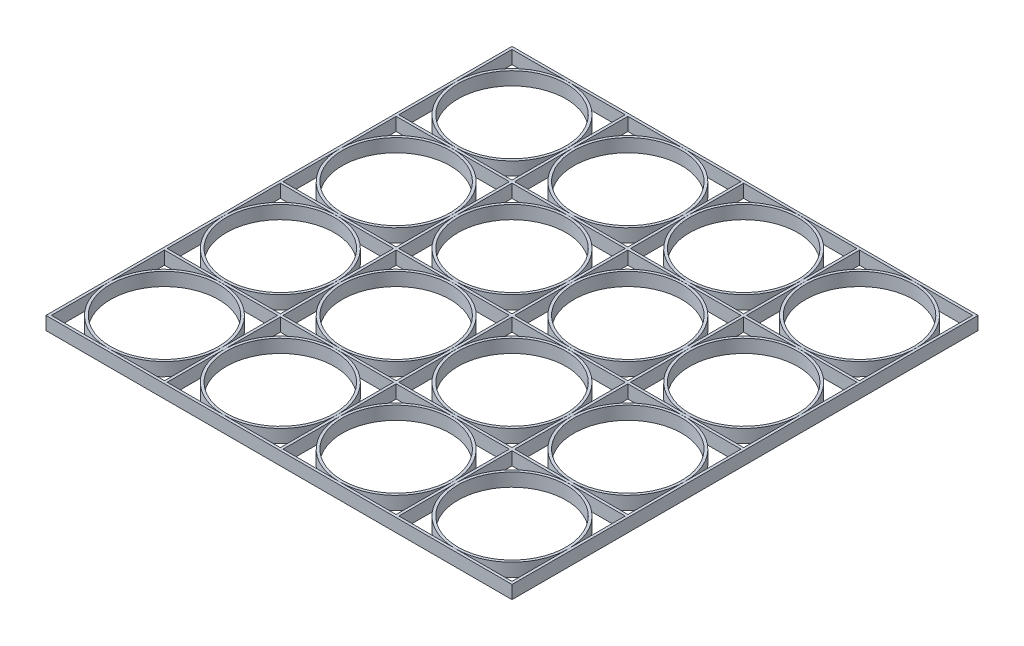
ISO-10303-21;
HEADER;
FILE_DESCRIPTION(('STEP AP214'),'2;1');
FILE_NAME('part.step','',(''),(''),'','','');
FILE_SCHEMA(('AUTOMOTIVE_DESIGN { 1 0 10303 214 1 1 1 1 }'));
ENDSEC;
DATA;
#1=APPLICATION_CONTEXT('core data for automotive mechanical design processes');
#2=APPLICATION_PROTOCOL_DEFINITION('international standard','automotive_design',2000,#1);
#3=PRODUCT_CONTEXT('',#1,'mechanical');
#4=PRODUCT('Part','Part','',(#3));
#5=PRODUCT_RELATED_PRODUCT_CATEGORY('part','',(#4));
#6=PRODUCT_DEFINITION_FORMATION('','',#4);
#7=PRODUCT_DEFINITION_CONTEXT('part definition',#1,'design');
#8=PRODUCT_DEFINITION('design','',#6,#7);
#9=PRODUCT_DEFINITION_SHAPE('','',#8);
#10=(LENGTH_UNIT() NAMED_UNIT(*) SI_UNIT(.MILLI.,.METRE.));
#11=(NAMED_UNIT(*) PLANE_ANGLE_UNIT() SI_UNIT($,.RADIAN.));
#12=(NAMED_UNIT(*) SI_UNIT($,.STERADIAN.) SOLID_ANGLE_UNIT());
#13=UNCERTAINTY_MEASURE_WITH_UNIT(LENGTH_MEASURE(1.E-05),#10,'distance_accuracy_value','');
#14=(GEOMETRIC_REPRESENTATION_CONTEXT(3) GLOBAL_UNCERTAINTY_ASSIGNED_CONTEXT((#13)) GLOBAL_UNIT_ASSIGNED_CONTEXT((#10,
#11,#12)) REPRESENTATION_CONTEXT('',''));
#15=CARTESIAN_POINT('',(0.,0.,0.));
#16=DIRECTION('',(0.,0.,1.));
#17=DIRECTION('',(1.,0.,0.));
#18=AXIS2_PLACEMENT_3D('',#15,#16,#17);
#19=CARTESIAN_POINT('',(43.875,5.,131.625));
#20=DIRECTION('',(0.,1.,0.));
#21=DIRECTION('',(0.,0.,1.));
#22=AXIS2_PLACEMENT_3D('',#19,#20,#21);
#23=PLANE('',#22);
#24=CARTESIAN_POINT('',(43.875,5.,131.625));
#25=DIRECTION('',(0.,1.,0.));
#26=DIRECTION('',(0.,0.,1.));
#27=AXIS2_PLACEMENT_3D('',#24,#25,#26);
#28=CIRCLE('',#27,21.4375);
#29=CARTESIAN_POINT('',(43.875,5.,153.0625));
#30=VERTEX_POINT('',#29);
#31=EDGE_CURVE('E12',#30,#30,#28,.T.);
#32=ORIENTED_EDGE('',*,*,#31,.T.);
#33=EDGE_LOOP('',(#32));
#34=FACE_BOUND('',#33,.T.);
#35=CARTESIAN_POINT('',(43.875,5.,131.625));
#36=DIRECTION('',(0.,1.,0.));
#37=DIRECTION('',(0.,0.,1.));
#38=AXIS2_PLACEMENT_3D('',#35,#36,#37);
#39=CIRCLE('',#38,20.4375);
#40=CARTESIAN_POINT('',(43.875,5.,152.0625));
#41=VERTEX_POINT('',#40);
#42=EDGE_CURVE('E81',#41,#41,#39,.T.);
#43=ORIENTED_EDGE('',*,*,#42,.F.);
#44=EDGE_LOOP('',(#43));
#45=FACE_BOUND('',#44,.T.);
#46=ADVANCED_FACE('F70',(#34,#45),#23,.T.);
#47=CARTESIAN_POINT('',(43.875,0.,131.625));
#48=DIRECTION('',(0.,1.,0.));
#49=DIRECTION('',(0.,0.,1.));
#50=AXIS2_PLACEMENT_3D('',#47,#48,#49);
#51=PLANE('',#50);
#52=CARTESIAN_POINT('',(43.875,0.,131.625));
#53=DIRECTION('',(0.,1.,0.));
#54=DIRECTION('',(0.,0.,1.));
#55=AXIS2_PLACEMENT_3D('',#52,#53,#54);
#56=CIRCLE('',#55,21.4375);
#57=CARTESIAN_POINT('',(43.875,0.,153.0625));
#58=VERTEX_POINT('',#57);
#59=EDGE_CURVE('E74',#58,#58,#56,.T.);
#60=ORIENTED_EDGE('',*,*,#59,.F.);
#61=EDGE_LOOP('',(#60));
#62=FACE_BOUND('',#61,.T.);
#63=CARTESIAN_POINT('',(43.875,0.,131.625));
#64=DIRECTION('',(0.,1.,0.));
#65=DIRECTION('',(0.,0.,1.));
#66=AXIS2_PLACEMENT_3D('',#63,#64,#65);
#67=CIRCLE('',#66,20.4375);
#68=CARTESIAN_POINT('',(43.875,0.,152.0625));
#69=VERTEX_POINT('',#68);
#70=EDGE_CURVE('E83',#69,#69,#67,.T.);
#71=ORIENTED_EDGE('',*,*,#70,.T.);
#72=EDGE_LOOP('',(#71));
#73=FACE_BOUND('',#72,.T.);
#74=ADVANCED_FACE('F93',(#62,#73),#51,.F.);
#75=CARTESIAN_POINT('',(43.875,5.,131.625));
#76=DIRECTION('',(0.,-1.,0.));
#77=DIRECTION('',(0.,0.,-1.));
#78=AXIS2_PLACEMENT_3D('',#75,#76,#77);
#79=CYLINDRICAL_SURFACE('',#78,21.4375);
#80=ORIENTED_EDGE('',*,*,#31,.F.);
#81=EDGE_LOOP('',(#80));
#82=FACE_BOUND('',#81,.T.);
#83=ORIENTED_EDGE('',*,*,#59,.T.);
#84=EDGE_LOOP('',(#83));
#85=FACE_BOUND('',#84,.T.);
#86=ADVANCED_FACE('F72',(#82,#85),#79,.T.);
#87=CARTESIAN_POINT('',(43.875,5.,131.625));
#88=DIRECTION('',(0.,-1.,0.));
#89=DIRECTION('',(0.,0.,-1.));
#90=AXIS2_PLACEMENT_3D('',#87,#88,#89);
#91=CYLINDRICAL_SURFACE('',#90,20.4375);
#92=ORIENTED_EDGE('',*,*,#42,.T.);
#93=EDGE_LOOP('',(#92));
#94=FACE_BOUND('',#93,.T.);
#95=ORIENTED_EDGE('',*,*,#70,.F.);
#96=EDGE_LOOP('',(#95));
#97=FACE_BOUND('',#96,.T.);
#98=ADVANCED_FACE('F89',(#94,#97),#91,.F.);
#99=CLOSED_SHELL('',(#46,#74,#86,#98));
#100=MANIFOLD_SOLID_BREP('B2',#99);
#101=CARTESIAN_POINT('',(43.875,5.,87.75));
#102=DIRECTION('',(0.,1.,0.));
#103=DIRECTION('',(0.,0.,1.));
#104=AXIS2_PLACEMENT_3D('',#101,#102,#103);
#105=PLANE('',#104);
#106=CARTESIAN_POINT('',(43.875,5.,87.75));
#107=DIRECTION('',(0.,1.,0.));
#108=DIRECTION('',(0.,0.,1.));
#109=AXIS2_PLACEMENT_3D('',#106,#107,#108);
#110=CIRCLE('',#109,21.4375);
#111=CARTESIAN_POINT('',(43.875,5.,109.1875));
#112=VERTEX_POINT('',#111);
#113=EDGE_CURVE('E69',#112,#112,#110,.T.);
#114=ORIENTED_EDGE('',*,*,#113,.T.);
#115=EDGE_LOOP('',(#114));
#116=FACE_BOUND('',#115,.T.);
#117=CARTESIAN_POINT('',(43.875,5.,87.75));
#118=DIRECTION('',(0.,1.,0.));
#119=DIRECTION('',(0.,0.,1.));
#120=AXIS2_PLACEMENT_3D('',#117,#118,#119);
#121=CIRCLE('',#120,20.4375);
#122=CARTESIAN_POINT('',(43.875,5.,108.1875));
#123=VERTEX_POINT('',#122);
#124=EDGE_CURVE('E151',#123,#123,#121,.T.);
#125=ORIENTED_EDGE('',*,*,#124,.F.);
#126=EDGE_LOOP('',(#125));
#127=FACE_BOUND('',#126,.T.);
#128=ADVANCED_FACE('F140',(#116,#127),#105,.T.);
#129=CARTESIAN_POINT('',(43.875,0.,87.75));
#130=DIRECTION('',(0.,1.,0.));
#131=DIRECTION('',(0.,0.,1.));
#132=AXIS2_PLACEMENT_3D('',#129,#130,#131);
#133=PLANE('',#132);
#134=CARTESIAN_POINT('',(43.875,0.,87.75));
#135=DIRECTION('',(0.,1.,0.));
#136=DIRECTION('',(0.,0.,1.));
#137=AXIS2_PLACEMENT_3D('',#134,#135,#136);
#138=CIRCLE('',#137,21.4375);
#139=CARTESIAN_POINT('',(43.875,0.,109.1875));
#140=VERTEX_POINT('',#139);
#141=EDGE_CURVE('E144',#140,#140,#138,.T.);
#142=ORIENTED_EDGE('',*,*,#141,.F.);
#143=EDGE_LOOP('',(#142));
#144=FACE_BOUND('',#143,.T.);
#145=CARTESIAN_POINT('',(43.875,0.,87.75));
#146=DIRECTION('',(0.,1.,0.));
#147=DIRECTION('',(0.,0.,1.));
#148=AXIS2_PLACEMENT_3D('',#145,#146,#147);
#149=CIRCLE('',#148,20.4375);
#150=CARTESIAN_POINT('',(43.875,0.,108.1875));
#151=VERTEX_POINT('',#150);
#152=EDGE_CURVE('E153',#151,#151,#149,.T.);
#153=ORIENTED_EDGE('',*,*,#152,.T.);
#154=EDGE_LOOP('',(#153));
#155=FACE_BOUND('',#154,.T.);
#156=ADVANCED_FACE('F163',(#144,#155),#133,.F.);
#157=CARTESIAN_POINT('',(43.875,5.,87.75));
#158=DIRECTION('',(0.,-1.,0.));
#159=DIRECTION('',(0.,0.,-1.));
#160=AXIS2_PLACEMENT_3D('',#157,#158,#159);
#161=CYLINDRICAL_SURFACE('',#160,21.4375);
#162=ORIENTED_EDGE('',*,*,#113,.F.);
#163=EDGE_LOOP('',(#162));
#164=FACE_BOUND('',#163,.T.);
#165=ORIENTED_EDGE('',*,*,#141,.T.);
#166=EDGE_LOOP('',(#165));
#167=FACE_BOUND('',#166,.T.);
#168=ADVANCED_FACE('F142',(#164,#167),#161,.T.);
#169=CARTESIAN_POINT('',(43.875,5.,87.75));
#170=DIRECTION('',(0.,-1.,0.));
#171=DIRECTION('',(0.,0.,-1.));
#172=AXIS2_PLACEMENT_3D('',#169,#170,#171);
#173=CYLINDRICAL_SURFACE('',#172,20.4375);
#174=ORIENTED_EDGE('',*,*,#124,.T.);
#175=EDGE_LOOP('',(#174));
#176=FACE_BOUND('',#175,.T.);
#177=ORIENTED_EDGE('',*,*,#152,.F.);
#178=EDGE_LOOP('',(#177));
#179=FACE_BOUND('',#178,.T.);
#180=ADVANCED_FACE('F159',(#176,#179),#173,.F.);
#181=CLOSED_SHELL('',(#128,#156,#168,#180));
#182=MANIFOLD_SOLID_BREP('B7',#181);
#183=CARTESIAN_POINT('',(43.875,5.,43.875));
#184=DIRECTION('',(0.,1.,0.));
#185=DIRECTION('',(0.,0.,1.));
#186=AXIS2_PLACEMENT_3D('',#183,#184,#185);
#187=PLANE('',#186);
#188=CARTESIAN_POINT('',(43.875,5.,43.875));
#189=DIRECTION('',(0.,1.,0.));
#190=DIRECTION('',(0.,0.,1.));
#191=AXIS2_PLACEMENT_3D('',#188,#189,#190);
#192=CIRCLE('',#191,21.4375);
#193=CARTESIAN_POINT('',(43.875,5.,65.3125));
#194=VERTEX_POINT('',#193);
#195=EDGE_CURVE('E139',#194,#194,#192,.T.);
#196=ORIENTED_EDGE('',*,*,#195,.T.);
#197=EDGE_LOOP('',(#196));
#198=FACE_BOUND('',#197,.T.);
#199=CARTESIAN_POINT('',(43.875,5.,43.875));
#200=DIRECTION('',(0.,1.,0.));
#201=DIRECTION('',(0.,0.,1.));
#202=AXIS2_PLACEMENT_3D('',#199,#200,#201);
#203=CIRCLE('',#202,20.4375);
#204=CARTESIAN_POINT('',(43.875,5.,64.3125));
#205=VERTEX_POINT('',#204);
#206=EDGE_CURVE('E221',#205,#205,#203,.T.);
#207=ORIENTED_EDGE('',*,*,#206,.F.);
#208=EDGE_LOOP('',(#207));
#209=FACE_BOUND('',#208,.T.);
#210=ADVANCED_FACE('F210',(#198,#209),#187,.T.);
#211=CARTESIAN_POINT('',(43.875,0.,43.875));
#212=DIRECTION('',(0.,1.,0.));
#213=DIRECTION('',(0.,0.,1.));
#214=AXIS2_PLACEMENT_3D('',#211,#212,#213);
#215=PLANE('',#214);
#216=CARTESIAN_POINT('',(43.875,0.,43.875));
#217=DIRECTION('',(0.,1.,0.));
#218=DIRECTION('',(0.,0.,1.));
#219=AXIS2_PLACEMENT_3D('',#216,#217,#218);
#220=CIRCLE('',#219,21.4375);
#221=CARTESIAN_POINT('',(43.875,0.,65.3125));
#222=VERTEX_POINT('',#221);
#223=EDGE_CURVE('E214',#222,#222,#220,.T.);
#224=ORIENTED_EDGE('',*,*,#223,.F.);
#225=EDGE_LOOP('',(#224));
#226=FACE_BOUND('',#225,.T.);
#227=CARTESIAN_POINT('',(43.875,0.,43.875));
#228=DIRECTION('',(0.,1.,0.));
#229=DIRECTION('',(0.,0.,1.));
#230=AXIS2_PLACEMENT_3D('',#227,#228,#229);
#231=CIRCLE('',#230,20.4375);
#232=CARTESIAN_POINT('',(43.875,0.,64.3125));
#233=VERTEX_POINT('',#232);
#234=EDGE_CURVE('E223',#233,#233,#231,.T.);
#235=ORIENTED_EDGE('',*,*,#234,.T.);
#236=EDGE_LOOP('',(#235));
#237=FACE_BOUND('',#236,.T.);
#238=ADVANCED_FACE('F233',(#226,#237),#215,.F.);
#239=CARTESIAN_POINT('',(43.875,5.,43.875));
#240=DIRECTION('',(0.,-1.,0.));
#241=DIRECTION('',(0.,0.,-1.));
#242=AXIS2_PLACEMENT_3D('',#239,#240,#241);
#243=CYLINDRICAL_SURFACE('',#242,21.4375);
#244=ORIENTED_EDGE('',*,*,#195,.F.);
#245=EDGE_LOOP('',(#244));
#246=FACE_BOUND('',#245,.T.);
#247=ORIENTED_EDGE('',*,*,#223,.T.);
#248=EDGE_LOOP('',(#247));
#249=FACE_BOUND('',#248,.T.);
#250=ADVANCED_FACE('F212',(#246,#249),#243,.T.);
#251=CARTESIAN_POINT('',(43.875,5.,43.875));
#252=DIRECTION('',(0.,-1.,0.));
#253=DIRECTION('',(0.,0.,-1.));
#254=AXIS2_PLACEMENT_3D('',#251,#252,#253);
#255=CYLINDRICAL_SURFACE('',#254,20.4375);
#256=ORIENTED_EDGE('',*,*,#206,.T.);
#257=EDGE_LOOP('',(#256));
#258=FACE_BOUND('',#257,.T.);
#259=ORIENTED_EDGE('',*,*,#234,.F.);
#260=EDGE_LOOP('',(#259));
#261=FACE_BOUND('',#260,.T.);
#262=ADVANCED_FACE('F229',(#258,#261),#255,.F.);
#263=CLOSED_SHELL('',(#210,#238,#250,#262));
#264=MANIFOLD_SOLID_BREP('B64',#263);
#265=CARTESIAN_POINT('',(87.75,5.,131.625));
#266=DIRECTION('',(0.,1.,0.));
#267=DIRECTION('',(0.,0.,1.));
#268=AXIS2_PLACEMENT_3D('',#265,#266,#267);
#269=PLANE('',#268);
#270=CARTESIAN_POINT('',(87.75,5.,131.625));
#271=DIRECTION('',(0.,1.,0.));
#272=DIRECTION('',(0.,0.,1.));
#273=AXIS2_PLACEMENT_3D('',#270,#271,#272);
#274=CIRCLE('',#273,21.4375);
#275=CARTESIAN_POINT('',(87.75,5.,153.0625));
#276=VERTEX_POINT('',#275);
#277=EDGE_CURVE('E209',#276,#276,#274,.T.);
#278=ORIENTED_EDGE('',*,*,#277,.T.);
#279=EDGE_LOOP('',(#278));
#280=FACE_BOUND('',#279,.T.);
#281=CARTESIAN_POINT('',(87.75,5.,131.625));
#282=DIRECTION('',(0.,1.,0.));
#283=DIRECTION('',(0.,0.,1.));
#284=AXIS2_PLACEMENT_3D('',#281,#282,#283);
#285=CIRCLE('',#284,20.4375);
#286=CARTESIAN_POINT('',(87.75,5.,152.0625));
#287=VERTEX_POINT('',#286);
#288=EDGE_CURVE('E291',#287,#287,#285,.T.);
#289=ORIENTED_EDGE('',*,*,#288,.F.);
#290=EDGE_LOOP('',(#289));
#291=FACE_BOUND('',#290,.T.);
#292=ADVANCED_FACE('F280',(#280,#291),#269,.T.);
#293=CARTESIAN_POINT('',(87.75,0.,131.625));
#294=DIRECTION('',(0.,1.,0.));
#295=DIRECTION('',(0.,0.,1.));
#296=AXIS2_PLACEMENT_3D('',#293,#294,#295);
#297=PLANE('',#296);
#298=CARTESIAN_POINT('',(87.75,0.,131.625));
#299=DIRECTION('',(0.,1.,0.));
#300=DIRECTION('',(0.,0.,1.));
#301=AXIS2_PLACEMENT_3D('',#298,#299,#300);
#302=CIRCLE('',#301,21.4375);
#303=CARTESIAN_POINT('',(87.75,0.,153.0625));
#304=VERTEX_POINT('',#303);
#305=EDGE_CURVE('E284',#304,#304,#302,.T.);
#306=ORIENTED_EDGE('',*,*,#305,.F.);
#307=EDGE_LOOP('',(#306));
#308=FACE_BOUND('',#307,.T.);
#309=CARTESIAN_POINT('',(87.75,0.,131.625));
#310=DIRECTION('',(0.,1.,0.));
#311=DIRECTION('',(0.,0.,1.));
#312=AXIS2_PLACEMENT_3D('',#309,#310,#311);
#313=CIRCLE('',#312,20.4375);
#314=CARTESIAN_POINT('',(87.75,0.,152.0625));
#315=VERTEX_POINT('',#314);
#316=EDGE_CURVE('E293',#315,#315,#313,.T.);
#317=ORIENTED_EDGE('',*,*,#316,.T.);
#318=EDGE_LOOP('',(#317));
#319=FACE_BOUND('',#318,.T.);
#320=ADVANCED_FACE('F303',(#308,#319),#297,.F.);
#321=CARTESIAN_POINT('',(87.75,5.,131.625));
#322=DIRECTION('',(0.,-1.,0.));
#323=DIRECTION('',(0.,0.,-1.));
#324=AXIS2_PLACEMENT_3D('',#321,#322,#323);
#325=CYLINDRICAL_SURFACE('',#324,21.4375);
#326=ORIENTED_EDGE('',*,*,#277,.F.);
#327=EDGE_LOOP('',(#326));
#328=FACE_BOUND('',#327,.T.);
#329=ORIENTED_EDGE('',*,*,#305,.T.);
#330=EDGE_LOOP('',(#329));
#331=FACE_BOUND('',#330,.T.);
#332=ADVANCED_FACE('F282',(#328,#331),#325,.T.);
#333=CARTESIAN_POINT('',(87.75,5.,131.625));
#334=DIRECTION('',(0.,-1.,0.));
#335=DIRECTION('',(0.,0.,-1.));
#336=AXIS2_PLACEMENT_3D('',#333,#334,#335);
#337=CYLINDRICAL_SURFACE('',#336,20.4375);
#338=ORIENTED_EDGE('',*,*,#288,.T.);
#339=EDGE_LOOP('',(#338));
#340=FACE_BOUND('',#339,.T.);
#341=ORIENTED_EDGE('',*,*,#316,.F.);
#342=EDGE_LOOP('',(#341));
#343=FACE_BOUND('',#342,.T.);
#344=ADVANCED_FACE('F299',(#340,#343),#337,.F.);
#345=CLOSED_SHELL('',(#292,#320,#332,#344));
#346=MANIFOLD_SOLID_BREP('B134',#345);
#347=CARTESIAN_POINT('',(87.75,5.,87.75));
#348=DIRECTION('',(0.,1.,0.));
#349=DIRECTION('',(0.,0.,1.));
#350=AXIS2_PLACEMENT_3D('',#347,#348,#349);
#351=PLANE('',#350);
#352=CARTESIAN_POINT('',(87.75,5.,87.75));
#353=DIRECTION('',(0.,1.,0.));
#354=DIRECTION('',(0.,0.,1.));
#355=AXIS2_PLACEMENT_3D('',#352,#353,#354);
#356=CIRCLE('',#355,21.4375);
#357=CARTESIAN_POINT('',(87.75,5.,109.1875));
#358=VERTEX_POINT('',#357);
#359=EDGE_CURVE('E279',#358,#358,#356,.T.);
#360=ORIENTED_EDGE('',*,*,#359,.T.);
#361=EDGE_LOOP('',(#360));
#362=FACE_BOUND('',#361,.T.);
#363=CARTESIAN_POINT('',(87.75,5.,87.75));
#364=DIRECTION('',(0.,1.,0.));
#365=DIRECTION('',(0.,0.,1.));
#366=AXIS2_PLACEMENT_3D('',#363,#364,#365);
#367=CIRCLE('',#366,20.4375);
#368=CARTESIAN_POINT('',(87.75,5.,108.1875));
#369=VERTEX_POINT('',#368);
#370=EDGE_CURVE('E361',#369,#369,#367,.T.);
#371=ORIENTED_EDGE('',*,*,#370,.F.);
#372=EDGE_LOOP('',(#371));
#373=FACE_BOUND('',#372,.T.);
#374=ADVANCED_FACE('F350',(#362,#373),#351,.T.);
#375=CARTESIAN_POINT('',(87.75,0.,87.75));
#376=DIRECTION('',(0.,1.,0.));
#377=DIRECTION('',(0.,0.,1.));
#378=AXIS2_PLACEMENT_3D('',#375,#376,#377);
#379=PLANE('',#378);
#380=CARTESIAN_POINT('',(87.75,0.,87.75));
#381=DIRECTION('',(0.,1.,0.));
#382=DIRECTION('',(0.,0.,1.));
#383=AXIS2_PLACEMENT_3D('',#380,#381,#382);
#384=CIRCLE('',#383,21.4375);
#385=CARTESIAN_POINT('',(87.75,0.,109.1875));
#386=VERTEX_POINT('',#385);
#387=EDGE_CURVE('E354',#386,#386,#384,.T.);
#388=ORIENTED_EDGE('',*,*,#387,.F.);
#389=EDGE_LOOP('',(#388));
#390=FACE_BOUND('',#389,.T.);
#391=CARTESIAN_POINT('',(87.75,0.,87.75));
#392=DIRECTION('',(0.,1.,0.));
#393=DIRECTION('',(0.,0.,1.));
#394=AXIS2_PLACEMENT_3D('',#391,#392,#393);
#395=CIRCLE('',#394,20.4375);
#396=CARTESIAN_POINT('',(87.75,0.,108.1875));
#397=VERTEX_POINT('',#396);
#398=EDGE_CURVE('E363',#397,#397,#395,.T.);
#399=ORIENTED_EDGE('',*,*,#398,.T.);
#400=EDGE_LOOP('',(#399));
#401=FACE_BOUND('',#400,.T.);
#402=ADVANCED_FACE('F373',(#390,#401),#379,.F.);
#403=CARTESIAN_POINT('',(87.75,5.,87.75));
#404=DIRECTION('',(0.,-1.,0.));
#405=DIRECTION('',(0.,0.,-1.));
#406=AXIS2_PLACEMENT_3D('',#403,#404,#405);
#407=CYLINDRICAL_SURFACE('',#406,21.4375);
#408=ORIENTED_EDGE('',*,*,#359,.F.);
#409=EDGE_LOOP('',(#408));
#410=FACE_BOUND('',#409,.T.);
#411=ORIENTED_EDGE('',*,*,#387,.T.);
#412=EDGE_LOOP('',(#411));
#413=FACE_BOUND('',#412,.T.);
#414=ADVANCED_FACE('F352',(#410,#413),#407,.T.);
#415=CARTESIAN_POINT('',(87.75,5.,87.75));
#416=DIRECTION('',(0.,-1.,0.));
#417=DIRECTION('',(0.,0.,-1.));
#418=AXIS2_PLACEMENT_3D('',#415,#416,#417);
#419=CYLINDRICAL_SURFACE('',#418,20.4375);
#420=ORIENTED_EDGE('',*,*,#370,.T.);
#421=EDGE_LOOP('',(#420));
#422=FACE_BOUND('',#421,.T.);
#423=ORIENTED_EDGE('',*,*,#398,.F.);
#424=EDGE_LOOP('',(#423));
#425=FACE_BOUND('',#424,.T.);
#426=ADVANCED_FACE('F369',(#422,#425),#419,.F.);
#427=CLOSED_SHELL('',(#374,#402,#414,#426));
#428=MANIFOLD_SOLID_BREP('B204',#427);
#429=CARTESIAN_POINT('',(87.75,5.,43.875));
#430=DIRECTION('',(0.,1.,0.));
#431=DIRECTION('',(0.,0.,1.));
#432=AXIS2_PLACEMENT_3D('',#429,#430,#431);
#433=PLANE('',#432);
#434=CARTESIAN_POINT('',(87.75,5.,43.875));
#435=DIRECTION('',(0.,1.,0.));
#436=DIRECTION('',(0.,0.,1.));
#437=AXIS2_PLACEMENT_3D('',#434,#435,#436);
#438=CIRCLE('',#437,21.4375);
#439=CARTESIAN_POINT('',(87.75,5.,65.3125));
#440=VERTEX_POINT('',#439);
#441=EDGE_CURVE('E349',#440,#440,#438,.T.);
#442=ORIENTED_EDGE('',*,*,#441,.T.);
#443=EDGE_LOOP('',(#442));
#444=FACE_BOUND('',#443,.T.);
#445=CARTESIAN_POINT('',(87.75,5.,43.875));
#446=DIRECTION('',(0.,1.,0.));
#447=DIRECTION('',(0.,0.,1.));
#448=AXIS2_PLACEMENT_3D('',#445,#446,#447);
#449=CIRCLE('',#448,20.4375);
#450=CARTESIAN_POINT('',(87.75,5.,64.3125));
#451=VERTEX_POINT('',#450);
#452=EDGE_CURVE('E431',#451,#451,#449,.T.);
#453=ORIENTED_EDGE('',*,*,#452,.F.);
#454=EDGE_LOOP('',(#453));
#455=FACE_BOUND('',#454,.T.);
#456=ADVANCED_FACE('F420',(#444,#455),#433,.T.);
#457=CARTESIAN_POINT('',(87.75,0.,43.875));
#458=DIRECTION('',(0.,1.,0.));
#459=DIRECTION('',(0.,0.,1.));
#460=AXIS2_PLACEMENT_3D('',#457,#458,#459);
#461=PLANE('',#460);
#462=CARTESIAN_POINT('',(87.75,0.,43.875));
#463=DIRECTION('',(0.,1.,0.));
#464=DIRECTION('',(0.,0.,1.));
#465=AXIS2_PLACEMENT_3D('',#462,#463,#464);
#466=CIRCLE('',#465,21.4375);
#467=CARTESIAN_POINT('',(87.75,0.,65.3125));
#468=VERTEX_POINT('',#467);
#469=EDGE_CURVE('E424',#468,#468,#466,.T.);
#470=ORIENTED_EDGE('',*,*,#469,.F.);
#471=EDGE_LOOP('',(#470));
#472=FACE_BOUND('',#471,.T.);
#473=CARTESIAN_POINT('',(87.75,0.,43.875));
#474=DIRECTION('',(0.,1.,0.));
#475=DIRECTION('',(0.,0.,1.));
#476=AXIS2_PLACEMENT_3D('',#473,#474,#475);
#477=CIRCLE('',#476,20.4375);
#478=CARTESIAN_POINT('',(87.75,0.,64.3125));
#479=VERTEX_POINT('',#478);
#480=EDGE_CURVE('E433',#479,#479,#477,.T.);
#481=ORIENTED_EDGE('',*,*,#480,.T.);
#482=EDGE_LOOP('',(#481));
#483=FACE_BOUND('',#482,.T.);
#484=ADVANCED_FACE('F443',(#472,#483),#461,.F.);
#485=CARTESIAN_POINT('',(87.75,5.,43.875));
#486=DIRECTION('',(0.,-1.,0.));
#487=DIRECTION('',(0.,0.,-1.));
#488=AXIS2_PLACEMENT_3D('',#485,#486,#487);
#489=CYLINDRICAL_SURFACE('',#488,21.4375);
#490=ORIENTED_EDGE('',*,*,#441,.F.);
#491=EDGE_LOOP('',(#490));
#492=FACE_BOUND('',#491,.T.);
#493=ORIENTED_EDGE('',*,*,#469,.T.);
#494=EDGE_LOOP('',(#493));
#495=FACE_BOUND('',#494,.T.);
#496=ADVANCED_FACE('F422',(#492,#495),#489,.T.);
#497=CARTESIAN_POINT('',(87.75,5.,43.875));
#498=DIRECTION('',(0.,-1.,0.));
#499=DIRECTION('',(0.,0.,-1.));
#500=AXIS2_PLACEMENT_3D('',#497,#498,#499);
#501=CYLINDRICAL_SURFACE('',#500,20.4375);
#502=ORIENTED_EDGE('',*,*,#452,.T.);
#503=EDGE_LOOP('',(#502));
#504=FACE_BOUND('',#503,.T.);
#505=ORIENTED_EDGE('',*,*,#480,.F.);
#506=EDGE_LOOP('',(#505));
#507=FACE_BOUND('',#506,.T.);
#508=ADVANCED_FACE('F439',(#504,#507),#501,.F.);
#509=CLOSED_SHELL('',(#456,#484,#496,#508));
#510=MANIFOLD_SOLID_BREP('B274',#509);
#511=CARTESIAN_POINT('',(0.,5.,131.625));
#512=DIRECTION('',(0.,1.,0.));
#513=DIRECTION('',(0.,0.,1.));
#514=AXIS2_PLACEMENT_3D('',#511,#512,#513);
#515=PLANE('',#514);
#516=CARTESIAN_POINT('',(0.,5.,131.625));
#517=DIRECTION('',(0.,1.,0.));
#518=DIRECTION('',(0.,0.,1.));
#519=AXIS2_PLACEMENT_3D('',#516,#517,#518);
#520=CIRCLE('',#519,21.4375);
#521=CARTESIAN_POINT('',(0.,5.,153.0625));
#522=VERTEX_POINT('',#521);
#523=EDGE_CURVE('E419',#522,#522,#520,.T.);
#524=ORIENTED_EDGE('',*,*,#523,.T.);
#525=EDGE_LOOP('',(#524));
#526=FACE_BOUND('',#525,.T.);
#527=CARTESIAN_POINT('',(0.,5.,131.625));
#528=DIRECTION('',(0.,1.,0.));
#529=DIRECTION('',(0.,0.,1.));
#530=AXIS2_PLACEMENT_3D('',#527,#528,#529);
#531=CIRCLE('',#530,20.4375);
#532=CARTESIAN_POINT('',(0.,5.,152.0625));
#533=VERTEX_POINT('',#532);
#534=EDGE_CURVE('E501',#533,#533,#531,.T.);
#535=ORIENTED_EDGE('',*,*,#534,.F.);
#536=EDGE_LOOP('',(#535));
#537=FACE_BOUND('',#536,.T.);
#538=ADVANCED_FACE('F490',(#526,#537),#515,.T.);
#539=CARTESIAN_POINT('',(0.,0.,131.625));
#540=DIRECTION('',(0.,1.,0.));
#541=DIRECTION('',(0.,0.,1.));
#542=AXIS2_PLACEMENT_3D('',#539,#540,#541);
#543=PLANE('',#542);
#544=CARTESIAN_POINT('',(0.,0.,131.625));
#545=DIRECTION('',(0.,1.,0.));
#546=DIRECTION('',(0.,0.,1.));
#547=AXIS2_PLACEMENT_3D('',#544,#545,#546);
#548=CIRCLE('',#547,21.4375);
#549=CARTESIAN_POINT('',(0.,0.,153.0625));
#550=VERTEX_POINT('',#549);
#551=EDGE_CURVE('E494',#550,#550,#548,.T.);
#552=ORIENTED_EDGE('',*,*,#551,.F.);
#553=EDGE_LOOP('',(#552));
#554=FACE_BOUND('',#553,.T.);
#555=CARTESIAN_POINT('',(0.,0.,131.625));
#556=DIRECTION('',(0.,1.,0.));
#557=DIRECTION('',(0.,0.,1.));
#558=AXIS2_PLACEMENT_3D('',#555,#556,#557);
#559=CIRCLE('',#558,20.4375);
#560=CARTESIAN_POINT('',(0.,0.,152.0625));
#561=VERTEX_POINT('',#560);
#562=EDGE_CURVE('E503',#561,#561,#559,.T.);
#563=ORIENTED_EDGE('',*,*,#562,.T.);
#564=EDGE_LOOP('',(#563));
#565=FACE_BOUND('',#564,.T.);
#566=ADVANCED_FACE('F513',(#554,#565),#543,.F.);
#567=CARTESIAN_POINT('',(0.,5.,131.625));
#568=DIRECTION('',(0.,-1.,0.));
#569=DIRECTION('',(0.,0.,-1.));
#570=AXIS2_PLACEMENT_3D('',#567,#568,#569);
#571=CYLINDRICAL_SURFACE('',#570,21.4375);
#572=ORIENTED_EDGE('',*,*,#523,.F.);
#573=EDGE_LOOP('',(#572));
#574=FACE_BOUND('',#573,.T.);
#575=ORIENTED_EDGE('',*,*,#551,.T.);
#576=EDGE_LOOP('',(#575));
#577=FACE_BOUND('',#576,.T.);
#578=ADVANCED_FACE('F492',(#574,#577),#571,.T.);
#579=CARTESIAN_POINT('',(0.,5.,131.625));
#580=DIRECTION('',(0.,-1.,0.));
#581=DIRECTION('',(0.,0.,-1.));
#582=AXIS2_PLACEMENT_3D('',#579,#580,#581);
#583=CYLINDRICAL_SURFACE('',#582,20.4375);
#584=ORIENTED_EDGE('',*,*,#534,.T.);
#585=EDGE_LOOP('',(#584));
#586=FACE_BOUND('',#585,.T.);
#587=ORIENTED_EDGE('',*,*,#562,.F.);
#588=EDGE_LOOP('',(#587));
#589=FACE_BOUND('',#588,.T.);
#590=ADVANCED_FACE('F509',(#586,#589),#583,.F.);
#591=CLOSED_SHELL('',(#538,#566,#578,#590));
#592=MANIFOLD_SOLID_BREP('B344',#591);
#593=CARTESIAN_POINT('',(0.,5.,87.75));
#594=DIRECTION('',(0.,1.,0.));
#595=DIRECTION('',(0.,0.,1.));
#596=AXIS2_PLACEMENT_3D('',#593,#594,#595);
#597=PLANE('',#596);
#598=CARTESIAN_POINT('',(0.,5.,87.75));
#599=DIRECTION('',(0.,1.,0.));
#600=DIRECTION('',(0.,0.,1.));
#601=AXIS2_PLACEMENT_3D('',#598,#599,#600);
#602=CIRCLE('',#601,21.4375);
#603=CARTESIAN_POINT('',(0.,5.,109.1875));
#604=VERTEX_POINT('',#603);
#605=EDGE_CURVE('E489',#604,#604,#602,.T.);
#606=ORIENTED_EDGE('',*,*,#605,.T.);
#607=EDGE_LOOP('',(#606));
#608=FACE_BOUND('',#607,.T.);
#609=CARTESIAN_POINT('',(0.,5.,87.75));
#610=DIRECTION('',(0.,1.,0.));
#611=DIRECTION('',(0.,0.,1.));
#612=AXIS2_PLACEMENT_3D('',#609,#610,#611);
#613=CIRCLE('',#612,20.4375);
#614=CARTESIAN_POINT('',(0.,5.,108.1875));
#615=VERTEX_POINT('',#614);
#616=EDGE_CURVE('E571',#615,#615,#613,.T.);
#617=ORIENTED_EDGE('',*,*,#616,.F.);
#618=EDGE_LOOP('',(#617));
#619=FACE_BOUND('',#618,.T.);
#620=ADVANCED_FACE('F560',(#608,#619),#597,.T.);
#621=CARTESIAN_POINT('',(0.,0.,87.75));
#622=DIRECTION('',(0.,1.,0.));
#623=DIRECTION('',(0.,0.,1.));
#624=AXIS2_PLACEMENT_3D('',#621,#622,#623);
#625=PLANE('',#624);
#626=CARTESIAN_POINT('',(0.,0.,87.75));
#627=DIRECTION('',(0.,1.,0.));
#628=DIRECTION('',(0.,0.,1.));
#629=AXIS2_PLACEMENT_3D('',#626,#627,#628);
#630=CIRCLE('',#629,21.4375);
#631=CARTESIAN_POINT('',(0.,0.,109.1875));
#632=VERTEX_POINT('',#631);
#633=EDGE_CURVE('E564',#632,#632,#630,.T.);
#634=ORIENTED_EDGE('',*,*,#633,.F.);
#635=EDGE_LOOP('',(#634));
#636=FACE_BOUND('',#635,.T.);
#637=CARTESIAN_POINT('',(0.,0.,87.75));
#638=DIRECTION('',(0.,1.,0.));
#639=DIRECTION('',(0.,0.,1.));
#640=AXIS2_PLACEMENT_3D('',#637,#638,#639);
#641=CIRCLE('',#640,20.4375);
#642=CARTESIAN_POINT('',(0.,0.,108.1875));
#643=VERTEX_POINT('',#642);
#644=EDGE_CURVE('E573',#643,#643,#641,.T.);
#645=ORIENTED_EDGE('',*,*,#644,.T.);
#646=EDGE_LOOP('',(#645));
#647=FACE_BOUND('',#646,.T.);
#648=ADVANCED_FACE('F583',(#636,#647),#625,.F.);
#649=CARTESIAN_POINT('',(0.,5.,87.75));
#650=DIRECTION('',(0.,-1.,0.));
#651=DIRECTION('',(0.,0.,-1.));
#652=AXIS2_PLACEMENT_3D('',#649,#650,#651);
#653=CYLINDRICAL_SURFACE('',#652,21.4375);
#654=ORIENTED_EDGE('',*,*,#605,.F.);
#655=EDGE_LOOP('',(#654));
#656=FACE_BOUND('',#655,.T.);
#657=ORIENTED_EDGE('',*,*,#633,.T.);
#658=EDGE_LOOP('',(#657));
#659=FACE_BOUND('',#658,.T.);
#660=ADVANCED_FACE('F562',(#656,#659),#653,.T.);
#661=CARTESIAN_POINT('',(0.,5.,87.75));
#662=DIRECTION('',(0.,-1.,0.));
#663=DIRECTION('',(0.,0.,-1.));
#664=AXIS2_PLACEMENT_3D('',#661,#662,#663);
#665=CYLINDRICAL_SURFACE('',#664,20.4375);
#666=ORIENTED_EDGE('',*,*,#616,.T.);
#667=EDGE_LOOP('',(#666));
#668=FACE_BOUND('',#667,.T.);
#669=ORIENTED_EDGE('',*,*,#644,.F.);
#670=EDGE_LOOP('',(#669));
#671=FACE_BOUND('',#670,.T.);
#672=ADVANCED_FACE('F579',(#668,#671),#665,.F.);
#673=CLOSED_SHELL('',(#620,#648,#660,#672));
#674=MANIFOLD_SOLID_BREP('B414',#673);
#675=CARTESIAN_POINT('',(0.,5.,43.875));
#676=DIRECTION('',(0.,1.,0.));
#677=DIRECTION('',(0.,0.,1.));
#678=AXIS2_PLACEMENT_3D('',#675,#676,#677);
#679=PLANE('',#678);
#680=CARTESIAN_POINT('',(0.,5.,43.875));
#681=DIRECTION('',(0.,1.,0.));
#682=DIRECTION('',(0.,0.,1.));
#683=AXIS2_PLACEMENT_3D('',#680,#681,#682);
#684=CIRCLE('',#683,21.4375);
#685=CARTESIAN_POINT('',(0.,5.,65.3125));
#686=VERTEX_POINT('',#685);
#687=EDGE_CURVE('E559',#686,#686,#684,.T.);
#688=ORIENTED_EDGE('',*,*,#687,.T.);
#689=EDGE_LOOP('',(#688));
#690=FACE_BOUND('',#689,.T.);
#691=CARTESIAN_POINT('',(0.,5.,43.875));
#692=DIRECTION('',(0.,1.,0.));
#693=DIRECTION('',(0.,0.,1.));
#694=AXIS2_PLACEMENT_3D('',#691,#692,#693);
#695=CIRCLE('',#694,20.4375);
#696=CARTESIAN_POINT('',(0.,5.,64.3125));
#697=VERTEX_POINT('',#696);
#698=EDGE_CURVE('E641',#697,#697,#695,.T.);
#699=ORIENTED_EDGE('',*,*,#698,.F.);
#700=EDGE_LOOP('',(#699));
#701=FACE_BOUND('',#700,.T.);
#702=ADVANCED_FACE('F630',(#690,#701),#679,.T.);
#703=CARTESIAN_POINT('',(0.,0.,43.875));
#704=DIRECTION('',(0.,1.,0.));
#705=DIRECTION('',(0.,0.,1.));
#706=AXIS2_PLACEMENT_3D('',#703,#704,#705);
#707=PLANE('',#706);
#708=CARTESIAN_POINT('',(0.,0.,43.875));
#709=DIRECTION('',(0.,1.,0.));
#710=DIRECTION('',(0.,0.,1.));
#711=AXIS2_PLACEMENT_3D('',#708,#709,#710);
#712=CIRCLE('',#711,21.4375);
#713=CARTESIAN_POINT('',(0.,0.,65.3125));
#714=VERTEX_POINT('',#713);
#715=EDGE_CURVE('E634',#714,#714,#712,.T.);
#716=ORIENTED_EDGE('',*,*,#715,.F.);
#717=EDGE_LOOP('',(#716));
#718=FACE_BOUND('',#717,.T.);
#719=CARTESIAN_POINT('',(0.,0.,43.875));
#720=DIRECTION('',(0.,1.,0.));
#721=DIRECTION('',(0.,0.,1.));
#722=AXIS2_PLACEMENT_3D('',#719,#720,#721);
#723=CIRCLE('',#722,20.4375);
#724=CARTESIAN_POINT('',(0.,0.,64.3125));
#725=VERTEX_POINT('',#724);
#726=EDGE_CURVE('E643',#725,#725,#723,.T.);
#727=ORIENTED_EDGE('',*,*,#726,.T.);
#728=EDGE_LOOP('',(#727));
#729=FACE_BOUND('',#728,.T.);
#730=ADVANCED_FACE('F653',(#718,#729),#707,.F.);
#731=CARTESIAN_POINT('',(0.,5.,43.875));
#732=DIRECTION('',(0.,-1.,0.));
#733=DIRECTION('',(0.,0.,-1.));
#734=AXIS2_PLACEMENT_3D('',#731,#732,#733);
#735=CYLINDRICAL_SURFACE('',#734,21.4375);
#736=ORIENTED_EDGE('',*,*,#687,.F.);
#737=EDGE_LOOP('',(#736));
#738=FACE_BOUND('',#737,.T.);
#739=ORIENTED_EDGE('',*,*,#715,.T.);
#740=EDGE_LOOP('',(#739));
#741=FACE_BOUND('',#740,.T.);
#742=ADVANCED_FACE('F632',(#738,#741),#735,.T.);
#743=CARTESIAN_POINT('',(0.,5.,43.875));
#744=DIRECTION('',(0.,-1.,0.));
#745=DIRECTION('',(0.,0.,-1.));
#746=AXIS2_PLACEMENT_3D('',#743,#744,#745);
#747=CYLINDRICAL_SURFACE('',#746,20.4375);
#748=ORIENTED_EDGE('',*,*,#698,.T.);
#749=EDGE_LOOP('',(#748));
#750=FACE_BOUND('',#749,.T.);
#751=ORIENTED_EDGE('',*,*,#726,.F.);
#752=EDGE_LOOP('',(#751));
#753=FACE_BOUND('',#752,.T.);
#754=ADVANCED_FACE('F649',(#750,#753),#747,.F.);
#755=CLOSED_SHELL('',(#702,#730,#742,#754));
#756=MANIFOLD_SOLID_BREP('B484',#755);
#757=CARTESIAN_POINT('',(131.625,5.,131.625));
#758=DIRECTION('',(0.,1.,0.));
#759=DIRECTION('',(0.,0.,1.));
#760=AXIS2_PLACEMENT_3D('',#757,#758,#759);
#761=PLANE('',#760);
#762=CARTESIAN_POINT('',(131.625,5.,131.625));
#763=DIRECTION('',(0.,1.,0.));
#764=DIRECTION('',(0.,0.,1.));
#765=AXIS2_PLACEMENT_3D('',#762,#763,#764);
#766=CIRCLE('',#765,21.4375);
#767=CARTESIAN_POINT('',(131.625,5.,153.0625));
#768=VERTEX_POINT('',#767);
#769=EDGE_CURVE('E629',#768,#768,#766,.T.);
#770=ORIENTED_EDGE('',*,*,#769,.T.);
#771=EDGE_LOOP('',(#770));
#772=FACE_BOUND('',#771,.T.);
#773=CARTESIAN_POINT('',(131.625,5.,131.625));
#774=DIRECTION('',(0.,1.,0.));
#775=DIRECTION('',(0.,0.,1.));
#776=AXIS2_PLACEMENT_3D('',#773,#774,#775);
#777=CIRCLE('',#776,20.4375);
#778=CARTESIAN_POINT('',(131.625,5.,152.0625));
#779=VERTEX_POINT('',#778);
#780=EDGE_CURVE('E711',#779,#779,#777,.T.);
#781=ORIENTED_EDGE('',*,*,#780,.F.);
#782=EDGE_LOOP('',(#781));
#783=FACE_BOUND('',#782,.T.);
#784=ADVANCED_FACE('F700',(#772,#783),#761,.T.);
#785=CARTESIAN_POINT('',(131.625,0.,131.625));
#786=DIRECTION('',(0.,1.,0.));
#787=DIRECTION('',(0.,0.,1.));
#788=AXIS2_PLACEMENT_3D('',#785,#786,#787);
#789=PLANE('',#788);
#790=CARTESIAN_POINT('',(131.625,0.,131.625));
#791=DIRECTION('',(0.,1.,0.));
#792=DIRECTION('',(0.,0.,1.));
#793=AXIS2_PLACEMENT_3D('',#790,#791,#792);
#794=CIRCLE('',#793,21.4375);
#795=CARTESIAN_POINT('',(131.625,0.,153.0625));
#796=VERTEX_POINT('',#795);
#797=EDGE_CURVE('E704',#796,#796,#794,.T.);
#798=ORIENTED_EDGE('',*,*,#797,.F.);
#799=EDGE_LOOP('',(#798));
#800=FACE_BOUND('',#799,.T.);
#801=CARTESIAN_POINT('',(131.625,0.,131.625));
#802=DIRECTION('',(0.,1.,0.));
#803=DIRECTION('',(0.,0.,1.));
#804=AXIS2_PLACEMENT_3D('',#801,#802,#803);
#805=CIRCLE('',#804,20.4375);
#806=CARTESIAN_POINT('',(131.625,0.,152.0625));
#807=VERTEX_POINT('',#806);
#808=EDGE_CURVE('E713',#807,#807,#805,.T.);
#809=ORIENTED_EDGE('',*,*,#808,.T.);
#810=EDGE_LOOP('',(#809));
#811=FACE_BOUND('',#810,.T.);
#812=ADVANCED_FACE('F723',(#800,#811),#789,.F.);
#813=CARTESIAN_POINT('',(131.625,5.,131.625));
#814=DIRECTION('',(0.,-1.,0.));
#815=DIRECTION('',(0.,0.,-1.));
#816=AXIS2_PLACEMENT_3D('',#813,#814,#815);
#817=CYLINDRICAL_SURFACE('',#816,21.4375);
#818=ORIENTED_EDGE('',*,*,#769,.F.);
#819=EDGE_LOOP('',(#818));
#820=FACE_BOUND('',#819,.T.);
#821=ORIENTED_EDGE('',*,*,#797,.T.);
#822=EDGE_LOOP('',(#821));
#823=FACE_BOUND('',#822,.T.);
#824=ADVANCED_FACE('F702',(#820,#823),#817,.T.);
#825=CARTESIAN_POINT('',(131.625,5.,131.625));
#826=DIRECTION('',(0.,-1.,0.));
#827=DIRECTION('',(0.,0.,-1.));
#828=AXIS2_PLACEMENT_3D('',#825,#826,#827);
#829=CYLINDRICAL_SURFACE('',#828,20.4375);
#830=ORIENTED_EDGE('',*,*,#780,.T.);
#831=EDGE_LOOP('',(#830));
#832=FACE_BOUND('',#831,.T.);
#833=ORIENTED_EDGE('',*,*,#808,.F.);
#834=EDGE_LOOP('',(#833));
#835=FACE_BOUND('',#834,.T.);
#836=ADVANCED_FACE('F719',(#832,#835),#829,.F.);
#837=CLOSED_SHELL('',(#784,#812,#824,#836));
#838=MANIFOLD_SOLID_BREP('B554',#837);
#839=CARTESIAN_POINT('',(131.625,5.,87.75));
#840=DIRECTION('',(0.,1.,0.));
#841=DIRECTION('',(0.,0.,1.));
#842=AXIS2_PLACEMENT_3D('',#839,#840,#841);
#843=PLANE('',#842);
#844=CARTESIAN_POINT('',(131.625,5.,87.75));
#845=DIRECTION('',(0.,1.,0.));
#846=DIRECTION('',(0.,0.,1.));
#847=AXIS2_PLACEMENT_3D('',#844,#845,#846);
#848=CIRCLE('',#847,21.4375);
#849=CARTESIAN_POINT('',(131.625,5.,109.1875));
#850=VERTEX_POINT('',#849);
#851=EDGE_CURVE('E699',#850,#850,#848,.T.);
#852=ORIENTED_EDGE('',*,*,#851,.T.);
#853=EDGE_LOOP('',(#852));
#854=FACE_BOUND('',#853,.T.);
#855=CARTESIAN_POINT('',(131.625,5.,87.75));
#856=DIRECTION('',(0.,1.,0.));
#857=DIRECTION('',(0.,0.,1.));
#858=AXIS2_PLACEMENT_3D('',#855,#856,#857);
#859=CIRCLE('',#858,20.4375);
#860=CARTESIAN_POINT('',(131.625,5.,108.1875));
#861=VERTEX_POINT('',#860);
#862=EDGE_CURVE('E781',#861,#861,#859,.T.);
#863=ORIENTED_EDGE('',*,*,#862,.F.);
#864=EDGE_LOOP('',(#863));
#865=FACE_BOUND('',#864,.T.);
#866=ADVANCED_FACE('F770',(#854,#865),#843,.T.);
#867=CARTESIAN_POINT('',(131.625,0.,87.75));
#868=DIRECTION('',(0.,1.,0.));
#869=DIRECTION('',(0.,0.,1.));
#870=AXIS2_PLACEMENT_3D('',#867,#868,#869);
#871=PLANE('',#870);
#872=CARTESIAN_POINT('',(131.625,0.,87.75));
#873=DIRECTION('',(0.,1.,0.));
#874=DIRECTION('',(0.,0.,1.));
#875=AXIS2_PLACEMENT_3D('',#872,#873,#874);
#876=CIRCLE('',#875,21.4375);
#877=CARTESIAN_POINT('',(131.625,0.,109.1875));
#878=VERTEX_POINT('',#877);
#879=EDGE_CURVE('E774',#878,#878,#876,.T.);
#880=ORIENTED_EDGE('',*,*,#879,.F.);
#881=EDGE_LOOP('',(#880));
#882=FACE_BOUND('',#881,.T.);
#883=CARTESIAN_POINT('',(131.625,0.,87.75));
#884=DIRECTION('',(0.,1.,0.));
#885=DIRECTION('',(0.,0.,1.));
#886=AXIS2_PLACEMENT_3D('',#883,#884,#885);
#887=CIRCLE('',#886,20.4375);
#888=CARTESIAN_POINT('',(131.625,0.,108.1875));
#889=VERTEX_POINT('',#888);
#890=EDGE_CURVE('E783',#889,#889,#887,.T.);
#891=ORIENTED_EDGE('',*,*,#890,.T.);
#892=EDGE_LOOP('',(#891));
#893=FACE_BOUND('',#892,.T.);
#894=ADVANCED_FACE('F793',(#882,#893),#871,.F.);
#895=CARTESIAN_POINT('',(131.625,5.,87.75));
#896=DIRECTION('',(0.,-1.,0.));
#897=DIRECTION('',(0.,0.,-1.));
#898=AXIS2_PLACEMENT_3D('',#895,#896,#897);
#899=CYLINDRICAL_SURFACE('',#898,21.4375);
#900=ORIENTED_EDGE('',*,*,#851,.F.);
#901=EDGE_LOOP('',(#900));
#902=FACE_BOUND('',#901,.T.);
#903=ORIENTED_EDGE('',*,*,#879,.T.);
#904=EDGE_LOOP('',(#903));
#905=FACE_BOUND('',#904,.T.);
#906=ADVANCED_FACE('F772',(#902,#905),#899,.T.);
#907=CARTESIAN_POINT('',(131.625,5.,87.75));
#908=DIRECTION('',(0.,-1.,0.));
#909=DIRECTION('',(0.,0.,-1.));
#910=AXIS2_PLACEMENT_3D('',#907,#908,#909);
#911=CYLINDRICAL_SURFACE('',#910,20.4375);
#912=ORIENTED_EDGE('',*,*,#862,.T.);
#913=EDGE_LOOP('',(#912));
#914=FACE_BOUND('',#913,.T.);
#915=ORIENTED_EDGE('',*,*,#890,.F.);
#916=EDGE_LOOP('',(#915));
#917=FACE_BOUND('',#916,.T.);
#918=ADVANCED_FACE('F789',(#914,#917),#911,.F.);
#919=CLOSED_SHELL('',(#866,#894,#906,#918));
#920=MANIFOLD_SOLID_BREP('B624',#919);
#921=CARTESIAN_POINT('',(131.625,5.,43.875));
#922=DIRECTION('',(0.,1.,0.));
#923=DIRECTION('',(0.,0.,1.));
#924=AXIS2_PLACEMENT_3D('',#921,#922,#923);
#925=PLANE('',#924);
#926=CARTESIAN_POINT('',(131.625,5.,43.875));
#927=DIRECTION('',(0.,1.,0.));
#928=DIRECTION('',(0.,0.,1.));
#929=AXIS2_PLACEMENT_3D('',#926,#927,#928);
#930=CIRCLE('',#929,21.4375);
#931=CARTESIAN_POINT('',(131.625,5.,65.3125));
#932=VERTEX_POINT('',#931);
#933=EDGE_CURVE('E769',#932,#932,#930,.T.);
#934=ORIENTED_EDGE('',*,*,#933,.T.);
#935=EDGE_LOOP('',(#934));
#936=FACE_BOUND('',#935,.T.);
#937=CARTESIAN_POINT('',(131.625,5.,43.875));
#938=DIRECTION('',(0.,1.,0.));
#939=DIRECTION('',(0.,0.,1.));
#940=AXIS2_PLACEMENT_3D('',#937,#938,#939);
#941=CIRCLE('',#940,20.4375);
#942=CARTESIAN_POINT('',(131.625,5.,64.3125));
#943=VERTEX_POINT('',#942);
#944=EDGE_CURVE('E851',#943,#943,#941,.T.);
#945=ORIENTED_EDGE('',*,*,#944,.F.);
#946=EDGE_LOOP('',(#945));
#947=FACE_BOUND('',#946,.T.);
#948=ADVANCED_FACE('F840',(#936,#947),#925,.T.);
#949=CARTESIAN_POINT('',(131.625,0.,43.875));
#950=DIRECTION('',(0.,1.,0.));
#951=DIRECTION('',(0.,0.,1.));
#952=AXIS2_PLACEMENT_3D('',#949,#950,#951);
#953=PLANE('',#952);
#954=CARTESIAN_POINT('',(131.625,0.,43.875));
#955=DIRECTION('',(0.,1.,0.));
#956=DIRECTION('',(0.,0.,1.));
#957=AXIS2_PLACEMENT_3D('',#954,#955,#956);
#958=CIRCLE('',#957,21.4375);
#959=CARTESIAN_POINT('',(131.625,0.,65.3125));
#960=VERTEX_POINT('',#959);
#961=EDGE_CURVE('E844',#960,#960,#958,.T.);
#962=ORIENTED_EDGE('',*,*,#961,.F.);
#963=EDGE_LOOP('',(#962));
#964=FACE_BOUND('',#963,.T.);
#965=CARTESIAN_POINT('',(131.625,0.,43.875));
#966=DIRECTION('',(0.,1.,0.));
#967=DIRECTION('',(0.,0.,1.));
#968=AXIS2_PLACEMENT_3D('',#965,#966,#967);
#969=CIRCLE('',#968,20.4375);
#970=CARTESIAN_POINT('',(131.625,0.,64.3125));
#971=VERTEX_POINT('',#970);
#972=EDGE_CURVE('E853',#971,#971,#969,.T.);
#973=ORIENTED_EDGE('',*,*,#972,.T.);
#974=EDGE_LOOP('',(#973));
#975=FACE_BOUND('',#974,.T.);
#976=ADVANCED_FACE('F863',(#964,#975),#953,.F.);
#977=CARTESIAN_POINT('',(131.625,5.,43.875));
#978=DIRECTION('',(0.,-1.,0.));
#979=DIRECTION('',(0.,0.,-1.));
#980=AXIS2_PLACEMENT_3D('',#977,#978,#979);
#981=CYLINDRICAL_SURFACE('',#980,21.4375);
#982=ORIENTED_EDGE('',*,*,#933,.F.);
#983=EDGE_LOOP('',(#982));
#984=FACE_BOUND('',#983,.T.);
#985=ORIENTED_EDGE('',*,*,#961,.T.);
#986=EDGE_LOOP('',(#985));
#987=FACE_BOUND('',#986,.T.);
#988=ADVANCED_FACE('F842',(#984,#987),#981,.T.);
#989=CARTESIAN_POINT('',(131.625,5.,43.875));
#990=DIRECTION('',(0.,-1.,0.));
#991=DIRECTION('',(0.,0.,-1.));
#992=AXIS2_PLACEMENT_3D('',#989,#990,#991);
#993=CYLINDRICAL_SURFACE('',#992,20.4375);
#994=ORIENTED_EDGE('',*,*,#944,.T.);
#995=EDGE_LOOP('',(#994));
#996=FACE_BOUND('',#995,.T.);
#997=ORIENTED_EDGE('',*,*,#972,.F.);
#998=EDGE_LOOP('',(#997));
#999=FACE_BOUND('',#998,.T.);
#1000=ADVANCED_FACE('F859',(#996,#999),#993,.F.);
#1001=CLOSED_SHELL('',(#948,#976,#988,#1000));
#1002=MANIFOLD_SOLID_BREP('B694',#1001);
#1003=CARTESIAN_POINT('',(131.625,5.,0.));
#1004=DIRECTION('',(0.,1.,0.));
#1005=DIRECTION('',(0.,0.,1.));
#1006=AXIS2_PLACEMENT_3D('',#1003,#1004,#1005);
#1007=PLANE('',#1006);
#1008=CARTESIAN_POINT('',(131.625,5.,0.));
#1009=DIRECTION('',(0.,1.,0.));
#1010=DIRECTION('',(0.,0.,1.));
#1011=AXIS2_PLACEMENT_3D('',#1008,#1009,#1010);
#1012=CIRCLE('',#1011,21.4375);
#1013=CARTESIAN_POINT('',(131.625,5.,21.4375));
#1014=VERTEX_POINT('',#1013);
#1015=EDGE_CURVE('E839',#1014,#1014,#1012,.T.);
#1016=ORIENTED_EDGE('',*,*,#1015,.T.);
#1017=EDGE_LOOP('',(#1016));
#1018=FACE_BOUND('',#1017,.T.);
#1019=CARTESIAN_POINT('',(131.625,5.,0.));
#1020=DIRECTION('',(0.,1.,0.));
#1021=DIRECTION('',(0.,0.,1.));
#1022=AXIS2_PLACEMENT_3D('',#1019,#1020,#1021);
#1023=CIRCLE('',#1022,20.4375);
#1024=CARTESIAN_POINT('',(131.625,5.,20.4375));
#1025=VERTEX_POINT('',#1024);
#1026=EDGE_CURVE('E921',#1025,#1025,#1023,.T.);
#1027=ORIENTED_EDGE('',*,*,#1026,.F.);
#1028=EDGE_LOOP('',(#1027));
#1029=FACE_BOUND('',#1028,.T.);
#1030=ADVANCED_FACE('F910',(#1018,#1029),#1007,.T.);
#1031=CARTESIAN_POINT('',(131.625,0.,0.));
#1032=DIRECTION('',(0.,1.,0.));
#1033=DIRECTION('',(0.,0.,1.));
#1034=AXIS2_PLACEMENT_3D('',#1031,#1032,#1033);
#1035=PLANE('',#1034);
#1036=CARTESIAN_POINT('',(131.625,0.,0.));
#1037=DIRECTION('',(0.,1.,0.));
#1038=DIRECTION('',(0.,0.,1.));
#1039=AXIS2_PLACEMENT_3D('',#1036,#1037,#1038);
#1040=CIRCLE('',#1039,21.4375);
#1041=CARTESIAN_POINT('',(131.625,0.,21.4375));
#1042=VERTEX_POINT('',#1041);
#1043=EDGE_CURVE('E914',#1042,#1042,#1040,.T.);
#1044=ORIENTED_EDGE('',*,*,#1043,.F.);
#1045=EDGE_LOOP('',(#1044));
#1046=FACE_BOUND('',#1045,.T.);
#1047=CARTESIAN_POINT('',(131.625,0.,0.));
#1048=DIRECTION('',(0.,1.,0.));
#1049=DIRECTION('',(0.,0.,1.));
#1050=AXIS2_PLACEMENT_3D('',#1047,#1048,#1049);
#1051=CIRCLE('',#1050,20.4375);
#1052=CARTESIAN_POINT('',(131.625,0.,20.4375));
#1053=VERTEX_POINT('',#1052);
#1054=EDGE_CURVE('E923',#1053,#1053,#1051,.T.);
#1055=ORIENTED_EDGE('',*,*,#1054,.T.);
#1056=EDGE_LOOP('',(#1055));
#1057=FACE_BOUND('',#1056,.T.);
#1058=ADVANCED_FACE('F933',(#1046,#1057),#1035,.F.);
#1059=CARTESIAN_POINT('',(131.625,5.,0.));
#1060=DIRECTION('',(0.,-1.,0.));
#1061=DIRECTION('',(0.,0.,-1.));
#1062=AXIS2_PLACEMENT_3D('',#1059,#1060,#1061);
#1063=CYLINDRICAL_SURFACE('',#1062,21.4375);
#1064=ORIENTED_EDGE('',*,*,#1015,.F.);
#1065=EDGE_LOOP('',(#1064));
#1066=FACE_BOUND('',#1065,.T.);
#1067=ORIENTED_EDGE('',*,*,#1043,.T.);
#1068=EDGE_LOOP('',(#1067));
#1069=FACE_BOUND('',#1068,.T.);
#1070=ADVANCED_FACE('F912',(#1066,#1069),#1063,.T.);
#1071=CARTESIAN_POINT('',(131.625,5.,0.));
#1072=DIRECTION('',(0.,-1.,0.));
#1073=DIRECTION('',(0.,0.,-1.));
#1074=AXIS2_PLACEMENT_3D('',#1071,#1072,#1073);
#1075=CYLINDRICAL_SURFACE('',#1074,20.4375);
#1076=ORIENTED_EDGE('',*,*,#1026,.T.);
#1077=EDGE_LOOP('',(#1076));
#1078=FACE_BOUND('',#1077,.T.);
#1079=ORIENTED_EDGE('',*,*,#1054,.F.);
#1080=EDGE_LOOP('',(#1079));
#1081=FACE_BOUND('',#1080,.T.);
#1082=ADVANCED_FACE('F929',(#1078,#1081),#1075,.F.);
#1083=CLOSED_SHELL('',(#1030,#1058,#1070,#1082));
#1084=MANIFOLD_SOLID_BREP('B764',#1083);
#1085=CARTESIAN_POINT('',(87.75,5.,0.));
#1086=DIRECTION('',(0.,1.,0.));
#1087=DIRECTION('',(0.,0.,1.));
#1088=AXIS2_PLACEMENT_3D('',#1085,#1086,#1087);
#1089=PLANE('',#1088);
#1090=CARTESIAN_POINT('',(87.75,5.,0.));
#1091=DIRECTION('',(0.,1.,0.));
#1092=DIRECTION('',(0.,0.,1.));
#1093=AXIS2_PLACEMENT_3D('',#1090,#1091,#1092);
#1094=CIRCLE('',#1093,21.4375);
#1095=CARTESIAN_POINT('',(87.75,5.,21.4375));
#1096=VERTEX_POINT('',#1095);
#1097=EDGE_CURVE('E909',#1096,#1096,#1094,.T.);
#1098=ORIENTED_EDGE('',*,*,#1097,.T.);
#1099=EDGE_LOOP('',(#1098));
#1100=FACE_BOUND('',#1099,.T.);
#1101=CARTESIAN_POINT('',(87.75,5.,0.));
#1102=DIRECTION('',(0.,1.,0.));
#1103=DIRECTION('',(0.,0.,1.));
#1104=AXIS2_PLACEMENT_3D('',#1101,#1102,#1103);
#1105=CIRCLE('',#1104,20.4375);
#1106=CARTESIAN_POINT('',(87.75,5.,20.4375));
#1107=VERTEX_POINT('',#1106);
#1108=EDGE_CURVE('E991',#1107,#1107,#1105,.T.);
#1109=ORIENTED_EDGE('',*,*,#1108,.F.);
#1110=EDGE_LOOP('',(#1109));
#1111=FACE_BOUND('',#1110,.T.);
#1112=ADVANCED_FACE('F980',(#1100,#1111),#1089,.T.);
#1113=CARTESIAN_POINT('',(87.75,0.,0.));
#1114=DIRECTION('',(0.,1.,0.));
#1115=DIRECTION('',(0.,0.,1.));
#1116=AXIS2_PLACEMENT_3D('',#1113,#1114,#1115);
#1117=PLANE('',#1116);
#1118=CARTESIAN_POINT('',(87.75,0.,0.));
#1119=DIRECTION('',(0.,1.,0.));
#1120=DIRECTION('',(0.,0.,1.));
#1121=AXIS2_PLACEMENT_3D('',#1118,#1119,#1120);
#1122=CIRCLE('',#1121,21.4375);
#1123=CARTESIAN_POINT('',(87.75,0.,21.4375));
#1124=VERTEX_POINT('',#1123);
#1125=EDGE_CURVE('E984',#1124,#1124,#1122,.T.);
#1126=ORIENTED_EDGE('',*,*,#1125,.F.);
#1127=EDGE_LOOP('',(#1126));
#1128=FACE_BOUND('',#1127,.T.);
#1129=CARTESIAN_POINT('',(87.75,0.,0.));
#1130=DIRECTION('',(0.,1.,0.));
#1131=DIRECTION('',(0.,0.,1.));
#1132=AXIS2_PLACEMENT_3D('',#1129,#1130,#1131);
#1133=CIRCLE('',#1132,20.4375);
#1134=CARTESIAN_POINT('',(87.75,0.,20.4375));
#1135=VERTEX_POINT('',#1134);
#1136=EDGE_CURVE('E993',#1135,#1135,#1133,.T.);
#1137=ORIENTED_EDGE('',*,*,#1136,.T.);
#1138=EDGE_LOOP('',(#1137));
#1139=FACE_BOUND('',#1138,.T.);
#1140=ADVANCED_FACE('F1003',(#1128,#1139),#1117,.F.);
#1141=CARTESIAN_POINT('',(87.75,5.,0.));
#1142=DIRECTION('',(0.,-1.,0.));
#1143=DIRECTION('',(0.,0.,-1.));
#1144=AXIS2_PLACEMENT_3D('',#1141,#1142,#1143);
#1145=CYLINDRICAL_SURFACE('',#1144,21.4375);
#1146=ORIENTED_EDGE('',*,*,#1097,.F.);
#1147=EDGE_LOOP('',(#1146));
#1148=FACE_BOUND('',#1147,.T.);
#1149=ORIENTED_EDGE('',*,*,#1125,.T.);
#1150=EDGE_LOOP('',(#1149));
#1151=FACE_BOUND('',#1150,.T.);
#1152=ADVANCED_FACE('F982',(#1148,#1151),#1145,.T.);
#1153=CARTESIAN_POINT('',(87.75,5.,0.));
#1154=DIRECTION('',(0.,-1.,0.));
#1155=DIRECTION('',(0.,0.,-1.));
#1156=AXIS2_PLACEMENT_3D('',#1153,#1154,#1155);
#1157=CYLINDRICAL_SURFACE('',#1156,20.4375);
#1158=ORIENTED_EDGE('',*,*,#1108,.T.);
#1159=EDGE_LOOP('',(#1158));
#1160=FACE_BOUND('',#1159,.T.);
#1161=ORIENTED_EDGE('',*,*,#1136,.F.);
#1162=EDGE_LOOP('',(#1161));
#1163=FACE_BOUND('',#1162,.T.);
#1164=ADVANCED_FACE('F999',(#1160,#1163),#1157,.F.);
#1165=CLOSED_SHELL('',(#1112,#1140,#1152,#1164));
#1166=MANIFOLD_SOLID_BREP('B834',#1165);
#1167=CARTESIAN_POINT('',(43.875,5.,0.));
#1168=DIRECTION('',(0.,1.,0.));
#1169=DIRECTION('',(0.,0.,1.));
#1170=AXIS2_PLACEMENT_3D('',#1167,#1168,#1169);
#1171=PLANE('',#1170);
#1172=CARTESIAN_POINT('',(43.875,5.,0.));
#1173=DIRECTION('',(0.,1.,0.));
#1174=DIRECTION('',(0.,0.,1.));
#1175=AXIS2_PLACEMENT_3D('',#1172,#1173,#1174);
#1176=CIRCLE('',#1175,21.4375);
#1177=CARTESIAN_POINT('',(43.875,5.,21.4375));
#1178=VERTEX_POINT('',#1177);
#1179=EDGE_CURVE('E979',#1178,#1178,#1176,.T.);
#1180=ORIENTED_EDGE('',*,*,#1179,.T.);
#1181=EDGE_LOOP('',(#1180));
#1182=FACE_BOUND('',#1181,.T.);
#1183=CARTESIAN_POINT('',(43.875,5.,0.));
#1184=DIRECTION('',(0.,1.,0.));
#1185=DIRECTION('',(0.,0.,1.));
#1186=AXIS2_PLACEMENT_3D('',#1183,#1184,#1185);
#1187=CIRCLE('',#1186,20.4375);
#1188=CARTESIAN_POINT('',(43.875,5.,20.4375));
#1189=VERTEX_POINT('',#1188);
#1190=EDGE_CURVE('E1061',#1189,#1189,#1187,.T.);
#1191=ORIENTED_EDGE('',*,*,#1190,.F.);
#1192=EDGE_LOOP('',(#1191));
#1193=FACE_BOUND('',#1192,.T.);
#1194=ADVANCED_FACE('F1050',(#1182,#1193),#1171,.T.);
#1195=CARTESIAN_POINT('',(43.875,0.,0.));
#1196=DIRECTION('',(0.,1.,0.));
#1197=DIRECTION('',(0.,0.,1.));
#1198=AXIS2_PLACEMENT_3D('',#1195,#1196,#1197);
#1199=PLANE('',#1198);
#1200=CARTESIAN_POINT('',(43.875,0.,0.));
#1201=DIRECTION('',(0.,1.,0.));
#1202=DIRECTION('',(0.,0.,1.));
#1203=AXIS2_PLACEMENT_3D('',#1200,#1201,#1202);
#1204=CIRCLE('',#1203,21.4375);
#1205=CARTESIAN_POINT('',(43.875,0.,21.4375));
#1206=VERTEX_POINT('',#1205);
#1207=EDGE_CURVE('E1054',#1206,#1206,#1204,.T.);
#1208=ORIENTED_EDGE('',*,*,#1207,.F.);
#1209=EDGE_LOOP('',(#1208));
#1210=FACE_BOUND('',#1209,.T.);
#1211=CARTESIAN_POINT('',(43.875,0.,0.));
#1212=DIRECTION('',(0.,1.,0.));
#1213=DIRECTION('',(0.,0.,1.));
#1214=AXIS2_PLACEMENT_3D('',#1211,#1212,#1213);
#1215=CIRCLE('',#1214,20.4375);
#1216=CARTESIAN_POINT('',(43.875,0.,20.4375));
#1217=VERTEX_POINT('',#1216);
#1218=EDGE_CURVE('E1063',#1217,#1217,#1215,.T.);
#1219=ORIENTED_EDGE('',*,*,#1218,.T.);
#1220=EDGE_LOOP('',(#1219));
#1221=FACE_BOUND('',#1220,.T.);
#1222=ADVANCED_FACE('F1073',(#1210,#1221),#1199,.F.);
#1223=CARTESIAN_POINT('',(43.875,5.,0.));
#1224=DIRECTION('',(0.,-1.,0.));
#1225=DIRECTION('',(0.,0.,-1.));
#1226=AXIS2_PLACEMENT_3D('',#1223,#1224,#1225);
#1227=CYLINDRICAL_SURFACE('',#1226,21.4375);
#1228=ORIENTED_EDGE('',*,*,#1179,.F.);
#1229=EDGE_LOOP('',(#1228));
#1230=FACE_BOUND('',#1229,.T.);
#1231=ORIENTED_EDGE('',*,*,#1207,.T.);
#1232=EDGE_LOOP('',(#1231));
#1233=FACE_BOUND('',#1232,.T.);
#1234=ADVANCED_FACE('F1052',(#1230,#1233),#1227,.T.);
#1235=CARTESIAN_POINT('',(43.875,5.,0.));
#1236=DIRECTION('',(0.,-1.,0.));
#1237=DIRECTION('',(0.,0.,-1.));
#1238=AXIS2_PLACEMENT_3D('',#1235,#1236,#1237);
#1239=CYLINDRICAL_SURFACE('',#1238,20.4375);
#1240=ORIENTED_EDGE('',*,*,#1190,.T.);
#1241=EDGE_LOOP('',(#1240));
#1242=FACE_BOUND('',#1241,.T.);
#1243=ORIENTED_EDGE('',*,*,#1218,.F.);
#1244=EDGE_LOOP('',(#1243));
#1245=FACE_BOUND('',#1244,.T.);
#1246=ADVANCED_FACE('F1069',(#1242,#1245),#1239,.F.);
#1247=CLOSED_SHELL('',(#1194,#1222,#1234,#1246));
#1248=MANIFOLD_SOLID_BREP('B904',#1247);
#1249=CARTESIAN_POINT('',(0.,5.,0.));
#1250=DIRECTION('',(0.,1.,0.));
#1251=DIRECTION('',(0.,0.,1.));
#1252=AXIS2_PLACEMENT_3D('',#1249,#1250,#1251);
#1253=PLANE('',#1252);
#1254=CARTESIAN_POINT('',(0.,5.,0.));
#1255=DIRECTION('',(0.,1.,0.));
#1256=DIRECTION('',(0.,0.,1.));
#1257=AXIS2_PLACEMENT_3D('',#1254,#1255,#1256);
#1258=CIRCLE('',#1257,21.4375);
#1259=CARTESIAN_POINT('',(0.,5.,21.4375));
#1260=VERTEX_POINT('',#1259);
#1261=EDGE_CURVE('E1049',#1260,#1260,#1258,.T.);
#1262=ORIENTED_EDGE('',*,*,#1261,.T.);
#1263=EDGE_LOOP('',(#1262));
#1264=FACE_BOUND('',#1263,.T.);
#1265=CARTESIAN_POINT('',(0.,5.,0.));
#1266=DIRECTION('',(0.,1.,0.));
#1267=DIRECTION('',(0.,0.,1.));
#1268=AXIS2_PLACEMENT_3D('',#1265,#1266,#1267);
#1269=CIRCLE('',#1268,20.4375);
#1270=CARTESIAN_POINT('',(0.,5.,20.4375));
#1271=VERTEX_POINT('',#1270);
#1272=EDGE_CURVE('E1132',#1271,#1271,#1269,.T.);
#1273=ORIENTED_EDGE('',*,*,#1272,.F.);
#1274=EDGE_LOOP('',(#1273));
#1275=FACE_BOUND('',#1274,.T.);
#1276=ADVANCED_FACE('F1121',(#1264,#1275),#1253,.T.);
#1277=CARTESIAN_POINT('',(0.,0.,0.));
#1278=DIRECTION('',(0.,1.,0.));
#1279=DIRECTION('',(0.,0.,1.));
#1280=AXIS2_PLACEMENT_3D('',#1277,#1278,#1279);
#1281=PLANE('',#1280);
#1282=CARTESIAN_POINT('',(0.,0.,0.));
#1283=DIRECTION('',(0.,1.,0.));
#1284=DIRECTION('',(0.,0.,1.));
#1285=AXIS2_PLACEMENT_3D('',#1282,#1283,#1284);
#1286=CIRCLE('',#1285,21.4375);
#1287=CARTESIAN_POINT('',(0.,0.,21.4375));
#1288=VERTEX_POINT('',#1287);
#1289=EDGE_CURVE('E1125',#1288,#1288,#1286,.T.);
#1290=ORIENTED_EDGE('',*,*,#1289,.F.);
#1291=EDGE_LOOP('',(#1290));
#1292=FACE_BOUND('',#1291,.T.);
#1293=CARTESIAN_POINT('',(0.,0.,0.));
#1294=DIRECTION('',(0.,1.,0.));
#1295=DIRECTION('',(0.,0.,1.));
#1296=AXIS2_PLACEMENT_3D('',#1293,#1294,#1295);
#1297=CIRCLE('',#1296,20.4375);
#1298=CARTESIAN_POINT('',(0.,0.,20.4375));
#1299=VERTEX_POINT('',#1298);
#1300=EDGE_CURVE('E1134',#1299,#1299,#1297,.T.);
#1301=ORIENTED_EDGE('',*,*,#1300,.T.);
#1302=EDGE_LOOP('',(#1301));
#1303=FACE_BOUND('',#1302,.T.);
#1304=ADVANCED_FACE('F1144',(#1292,#1303),#1281,.F.);
#1305=CARTESIAN_POINT('',(0.,5.,0.));
#1306=DIRECTION('',(0.,-1.,0.));
#1307=DIRECTION('',(0.,0.,-1.));
#1308=AXIS2_PLACEMENT_3D('',#1305,#1306,#1307);
#1309=CYLINDRICAL_SURFACE('',#1308,21.4375);
#1310=ORIENTED_EDGE('',*,*,#1261,.F.);
#1311=EDGE_LOOP('',(#1310));
#1312=FACE_BOUND('',#1311,.T.);
#1313=ORIENTED_EDGE('',*,*,#1289,.T.);
#1314=EDGE_LOOP('',(#1313));
#1315=FACE_BOUND('',#1314,.T.);
#1316=ADVANCED_FACE('F1123',(#1312,#1315),#1309,.T.);
#1317=CARTESIAN_POINT('',(0.,5.,0.));
#1318=DIRECTION('',(0.,-1.,0.));
#1319=DIRECTION('',(0.,0.,-1.));
#1320=AXIS2_PLACEMENT_3D('',#1317,#1318,#1319);
#1321=CYLINDRICAL_SURFACE('',#1320,20.4375);
#1322=ORIENTED_EDGE('',*,*,#1272,.T.);
#1323=EDGE_LOOP('',(#1322));
#1324=FACE_BOUND('',#1323,.T.);
#1325=ORIENTED_EDGE('',*,*,#1300,.F.);
#1326=EDGE_LOOP('',(#1325));
#1327=FACE_BOUND('',#1326,.T.);
#1328=ADVANCED_FACE('F1140',(#1324,#1327),#1321,.F.);
#1329=CLOSED_SHELL('',(#1276,#1304,#1316,#1328));
#1330=MANIFOLD_SOLID_BREP('B974',#1329);
#1331=CARTESIAN_POINT('',(0.,5.,0.));
#1332=DIRECTION('',(0.,1.,0.));
#1333=DIRECTION('',(0.,0.,1.));
#1334=AXIS2_PLACEMENT_3D('',#1331,#1332,#1333);
#1335=PLANE('',#1334);
#1336=DIRECTION('',(-1.,0.,0.));
#1337=VECTOR('',#1336,1.);
#1338=CARTESIAN_POINT('',(-21.4375,5.,-21.4375));
#1339=LINE('',#1338,#1337);
#1340=CARTESIAN_POINT('',(21.4375,5.,-21.4375));
#1341=VERTEX_POINT('',#1340);
#1342=CARTESIAN_POINT('',(-21.4375,5.,-21.4375));
#1343=VERTEX_POINT('',#1342);
#1344=EDGE_CURVE('E2310',#1341,#1343,#1339,.T.);
#1345=ORIENTED_EDGE('',*,*,#1344,.F.);
#1346=DIRECTION('',(0.,0.,-1.));
#1347=VECTOR('',#1346,1.);
#1348=CARTESIAN_POINT('',(21.4375,5.,-21.4375));
#1349=LINE('',#1348,#1347);
#1350=CARTESIAN_POINT('',(21.4375,5.,21.4375));
#1351=VERTEX_POINT('',#1350);
#1352=EDGE_CURVE('E2307',#1351,#1341,#1349,.T.);
#1353=ORIENTED_EDGE('',*,*,#1352,.F.);
#1354=DIRECTION('',(1.,0.,0.));
#1355=VECTOR('',#1354,1.);
#1356=CARTESIAN_POINT('',(-21.4375,5.,21.4375));
#1357=LINE('',#1356,#1355);
#1358=CARTESIAN_POINT('',(-21.4375,5.,21.4375));
#1359=VERTEX_POINT('',#1358);
#1360=EDGE_CURVE('E2317',#1359,#1351,#1357,.T.);
#1361=ORIENTED_EDGE('',*,*,#1360,.F.);
#1362=DIRECTION('',(0.,0.,1.));
#1363=VECTOR('',#1362,1.);
#1364=CARTESIAN_POINT('',(-21.4375,5.,-21.4375));
#1365=LINE('',#1364,#1363);
#1366=EDGE_CURVE('E2314',#1343,#1359,#1365,.T.);
#1367=ORIENTED_EDGE('',*,*,#1366,.F.);
#1368=EDGE_LOOP('',(#1345,#1353,#1361,#1367));
#1369=FACE_BOUND('',#1368,.T.);
#1370=DIRECTION('',(0.,0.,1.));
#1371=VECTOR('',#1370,1.);
#1372=CARTESIAN_POINT('',(-22.4375,5.,-21.9375));
#1373=LINE('',#1372,#1371);
#1374=CARTESIAN_POINT('',(-22.4375,5.,-22.4375));
#1375=VERTEX_POINT('',#1374);
#1376=CARTESIAN_POINT('',(-22.4374999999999,5.,154.0625));
#1377=VERTEX_POINT('',#1376);
#1378=EDGE_CURVE('E2266',#1375,#1377,#1373,.T.);
#1379=ORIENTED_EDGE('',*,*,#1378,.T.);
#1380=DIRECTION('',(1.,0.,0.));
#1381=VECTOR('',#1380,1.);
#1382=CARTESIAN_POINT('',(-21.9374999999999,5.,154.0625));
#1383=LINE('',#1382,#1381);
#1384=CARTESIAN_POINT('',(154.0625,5.,154.0625));
#1385=VERTEX_POINT('',#1384);
#1386=EDGE_CURVE('E2270',#1377,#1385,#1383,.T.);
#1387=ORIENTED_EDGE('',*,*,#1386,.T.);
#1388=DIRECTION('',(0.,0.,-1.));
#1389=VECTOR('',#1388,1.);
#1390=CARTESIAN_POINT('',(154.0625,5.,-21.9375));
#1391=LINE('',#1390,#1389);
#1392=CARTESIAN_POINT('',(154.0625,5.,-22.4375));
#1393=VERTEX_POINT('',#1392);
#1394=EDGE_CURVE('E2274',#1385,#1393,#1391,.T.);
#1395=ORIENTED_EDGE('',*,*,#1394,.T.);
#1396=DIRECTION('',(-1.,0.,0.));
#1397=VECTOR('',#1396,1.);
#1398=CARTESIAN_POINT('',(-21.9375,5.,-22.4375));
#1399=LINE('',#1398,#1397);
#1400=EDGE_CURVE('E2277',#1393,#1375,#1399,.T.);
#1401=ORIENTED_EDGE('',*,*,#1400,.T.);
#1402=EDGE_LOOP('',(#1379,#1387,#1395,#1401));
#1403=FACE_BOUND('',#1402,.T.);
#1404=DIRECTION('',(-1.,0.,0.));
#1405=VECTOR('',#1404,1.);
#1406=CARTESIAN_POINT('',(22.4375,5.,-21.4375));
#1407=LINE('',#1406,#1405);
#1408=CARTESIAN_POINT('',(65.3125,5.,-21.4375));
#1409=VERTEX_POINT('',#1408);
#1410=CARTESIAN_POINT('',(22.4375,5.,-21.4375));
#1411=VERTEX_POINT('',#1410);
#1412=EDGE_CURVE('E2226',#1409,#1411,#1407,.T.);
#1413=ORIENTED_EDGE('',*,*,#1412,.F.);
#1414=DIRECTION('',(0.,0.,-1.));
#1415=VECTOR('',#1414,1.);
#1416=CARTESIAN_POINT('',(65.3125,5.,-21.4375));
#1417=LINE('',#1416,#1415);
#1418=CARTESIAN_POINT('',(65.3125,5.,21.4375));
#1419=VERTEX_POINT('',#1418);
#1420=EDGE_CURVE('E2223',#1419,#1409,#1417,.T.);
#1421=ORIENTED_EDGE('',*,*,#1420,.F.);
#1422=DIRECTION('',(1.,0.,0.));
#1423=VECTOR('',#1422,1.);
#1424=CARTESIAN_POINT('',(22.4375,5.,21.4375));
#1425=LINE('',#1424,#1423);
#1426=CARTESIAN_POINT('',(22.4375,5.,21.4375));
#1427=VERTEX_POINT('',#1426);
#1428=EDGE_CURVE('E2234',#1427,#1419,#1425,.T.);
#1429=ORIENTED_EDGE('',*,*,#1428,.F.);
#1430=DIRECTION('',(0.,0.,1.));
#1431=VECTOR('',#1430,1.);
#1432=CARTESIAN_POINT('',(22.4375,5.,-21.4375));
#1433=LINE('',#1432,#1431);
#1434=EDGE_CURVE('E2230',#1411,#1427,#1433,.T.);
#1435=ORIENTED_EDGE('',*,*,#1434,.F.);
#1436=EDGE_LOOP('',(#1413,#1421,#1429,#1435));
#1437=FACE_BOUND('',#1436,.T.);
#1438=DIRECTION('',(-1.,0.,0.));
#1439=VECTOR('',#1438,1.);
#1440=CARTESIAN_POINT('',(66.3125000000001,5.,-21.4375));
#1441=LINE('',#1440,#1439);
#1442=CARTESIAN_POINT('',(109.1875,5.,-21.4375));
#1443=VERTEX_POINT('',#1442);
#1444=CARTESIAN_POINT('',(66.3125000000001,5.,-21.4375));
#1445=VERTEX_POINT('',#1444);
#1446=EDGE_CURVE('E2183',#1443,#1445,#1441,.T.);
#1447=ORIENTED_EDGE('',*,*,#1446,.F.);
#1448=DIRECTION('',(0.,0.,-1.));
#1449=VECTOR('',#1448,1.);
#1450=CARTESIAN_POINT('',(109.1875,5.,-21.4375));
#1451=LINE('',#1450,#1449);
#1452=CARTESIAN_POINT('',(109.1875,5.,21.4375));
#1453=VERTEX_POINT('',#1452);
#1454=EDGE_CURVE('E2180',#1453,#1443,#1451,.T.);
#1455=ORIENTED_EDGE('',*,*,#1454,.F.);
#1456=DIRECTION('',(1.,0.,0.));
#1457=VECTOR('',#1456,1.);
#1458=CARTESIAN_POINT('',(66.3125000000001,5.,21.4375));
#1459=LINE('',#1458,#1457);
#1460=CARTESIAN_POINT('',(66.3125000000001,5.,21.4375));
#1461=VERTEX_POINT('',#1460);
#1462=EDGE_CURVE('E2191',#1461,#1453,#1459,.T.);
#1463=ORIENTED_EDGE('',*,*,#1462,.F.);
#1464=DIRECTION('',(0.,0.,1.));
#1465=VECTOR('',#1464,1.);
#1466=CARTESIAN_POINT('',(66.3125000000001,5.,-21.4375));
#1467=LINE('',#1466,#1465);
#1468=EDGE_CURVE('E2187',#1445,#1461,#1467,.T.);
#1469=ORIENTED_EDGE('',*,*,#1468,.F.);
#1470=EDGE_LOOP('',(#1447,#1455,#1463,#1469));
#1471=FACE_BOUND('',#1470,.T.);
#1472=DIRECTION('',(-1.,0.,0.));
#1473=VECTOR('',#1472,1.);
#1474=CARTESIAN_POINT('',(110.1875,5.,-21.4375));
#1475=LINE('',#1474,#1473);
#1476=CARTESIAN_POINT('',(153.0625,5.,-21.4375));
#1477=VERTEX_POINT('',#1476);
#1478=CARTESIAN_POINT('',(110.1875,5.,-21.4375));
#1479=VERTEX_POINT('',#1478);
#1480=EDGE_CURVE('E2140',#1477,#1479,#1475,.T.);
#1481=ORIENTED_EDGE('',*,*,#1480,.F.);
#1482=DIRECTION('',(0.,0.,-1.));
#1483=VECTOR('',#1482,1.);
#1484=CARTESIAN_POINT('',(153.0625,5.,-21.4375));
#1485=LINE('',#1484,#1483);
#1486=CARTESIAN_POINT('',(153.0625,5.,21.4375));
#1487=VERTEX_POINT('',#1486);
#1488=EDGE_CURVE('E2137',#1487,#1477,#1485,.T.);
#1489=ORIENTED_EDGE('',*,*,#1488,.F.);
#1490=DIRECTION('',(1.,0.,0.));
#1491=VECTOR('',#1490,1.);
#1492=CARTESIAN_POINT('',(110.1875,5.,21.4375));
#1493=LINE('',#1492,#1491);
#1494=CARTESIAN_POINT('',(110.1875,5.,21.4375));
#1495=VERTEX_POINT('',#1494);
#1496=EDGE_CURVE('E2148',#1495,#1487,#1493,.T.);
#1497=ORIENTED_EDGE('',*,*,#1496,.F.);
#1498=DIRECTION('',(0.,0.,1.));
#1499=VECTOR('',#1498,1.);
#1500=CARTESIAN_POINT('',(110.1875,5.,-21.4375));
#1501=LINE('',#1500,#1499);
#1502=EDGE_CURVE('E2144',#1479,#1495,#1501,.T.);
#1503=ORIENTED_EDGE('',*,*,#1502,.F.);
#1504=EDGE_LOOP('',(#1481,#1489,#1497,#1503));
#1505=FACE_BOUND('',#1504,.T.);
#1506=DIRECTION('',(-1.,0.,0.));
#1507=VECTOR('',#1506,1.);
#1508=CARTESIAN_POINT('',(-21.4375,5.,22.4375));
#1509=LINE('',#1508,#1507);
#1510=CARTESIAN_POINT('',(21.4375,5.,22.4375));
#1511=VERTEX_POINT('',#1510);
#1512=CARTESIAN_POINT('',(-21.4375,5.,22.4375));
#1513=VERTEX_POINT('',#1512);
#1514=EDGE_CURVE('E2097',#1511,#1513,#1509,.T.);
#1515=ORIENTED_EDGE('',*,*,#1514,.F.);
#1516=DIRECTION('',(0.,0.,-1.));
#1517=VECTOR('',#1516,1.);
#1518=CARTESIAN_POINT('',(21.4375,5.,22.4375));
#1519=LINE('',#1518,#1517);
#1520=CARTESIAN_POINT('',(21.4375,5.,65.3125));
#1521=VERTEX_POINT('',#1520);
#1522=EDGE_CURVE('E2094',#1521,#1511,#1519,.T.);
#1523=ORIENTED_EDGE('',*,*,#1522,.F.);
#1524=DIRECTION('',(1.,0.,0.));
#1525=VECTOR('',#1524,1.);
#1526=CARTESIAN_POINT('',(-21.4375,5.,65.3125));
#1527=LINE('',#1526,#1525);
#1528=CARTESIAN_POINT('',(-21.4375,5.,65.3125));
#1529=VERTEX_POINT('',#1528);
#1530=EDGE_CURVE('E2105',#1529,#1521,#1527,.T.);
#1531=ORIENTED_EDGE('',*,*,#1530,.F.);
#1532=DIRECTION('',(0.,0.,1.));
#1533=VECTOR('',#1532,1.);
#1534=CARTESIAN_POINT('',(-21.4375,5.,22.4375));
#1535=LINE('',#1534,#1533);
#1536=EDGE_CURVE('E2101',#1513,#1529,#1535,.T.);
#1537=ORIENTED_EDGE('',*,*,#1536,.F.);
#1538=EDGE_LOOP('',(#1515,#1523,#1531,#1537));
#1539=FACE_BOUND('',#1538,.T.);
#1540=DIRECTION('',(-1.,0.,0.));
#1541=VECTOR('',#1540,1.);
#1542=CARTESIAN_POINT('',(-21.4375,5.,66.3125));
#1543=LINE('',#1542,#1541);
#1544=CARTESIAN_POINT('',(21.4375,5.,66.3125));
#1545=VERTEX_POINT('',#1544);
#1546=CARTESIAN_POINT('',(-21.4375,5.,66.3125));
#1547=VERTEX_POINT('',#1546);
#1548=EDGE_CURVE('E2054',#1545,#1547,#1543,.T.);
#1549=ORIENTED_EDGE('',*,*,#1548,.F.);
#1550=DIRECTION('',(0.,0.,-1.));
#1551=VECTOR('',#1550,1.);
#1552=CARTESIAN_POINT('',(21.4375,5.,66.3125));
#1553=LINE('',#1552,#1551);
#1554=CARTESIAN_POINT('',(21.4375,5.,109.1875));
#1555=VERTEX_POINT('',#1554);
#1556=EDGE_CURVE('E2051',#1555,#1545,#1553,.T.);
#1557=ORIENTED_EDGE('',*,*,#1556,.F.);
#1558=DIRECTION('',(1.,0.,0.));
#1559=VECTOR('',#1558,1.);
#1560=CARTESIAN_POINT('',(-21.4375,5.,109.1875));
#1561=LINE('',#1560,#1559);
#1562=CARTESIAN_POINT('',(-21.4375,5.,109.1875));
#1563=VERTEX_POINT('',#1562);
#1564=EDGE_CURVE('E2062',#1563,#1555,#1561,.T.);
#1565=ORIENTED_EDGE('',*,*,#1564,.F.);
#1566=DIRECTION('',(0.,0.,1.));
#1567=VECTOR('',#1566,1.);
#1568=CARTESIAN_POINT('',(-21.4375,5.,66.3125));
#1569=LINE('',#1568,#1567);
#1570=EDGE_CURVE('E2058',#1547,#1563,#1569,.T.);
#1571=ORIENTED_EDGE('',*,*,#1570,.F.);
#1572=EDGE_LOOP('',(#1549,#1557,#1565,#1571));
#1573=FACE_BOUND('',#1572,.T.);
#1574=DIRECTION('',(-1.,0.,0.));
#1575=VECTOR('',#1574,1.);
#1576=CARTESIAN_POINT('',(-21.4375,5.,110.1875));
#1577=LINE('',#1576,#1575);
#1578=CARTESIAN_POINT('',(21.4375,5.,110.1875));
#1579=VERTEX_POINT('',#1578);
#1580=CARTESIAN_POINT('',(-21.4375,5.,110.1875));
#1581=VERTEX_POINT('',#1580);
#1582=EDGE_CURVE('E2011',#1579,#1581,#1577,.T.);
#1583=ORIENTED_EDGE('',*,*,#1582,.F.);
#1584=DIRECTION('',(0.,0.,-1.));
#1585=VECTOR('',#1584,1.);
#1586=CARTESIAN_POINT('',(21.4375,5.,110.1875));
#1587=LINE('',#1586,#1585);
#1588=CARTESIAN_POINT('',(21.4375,5.,153.0625));
#1589=VERTEX_POINT('',#1588);
#1590=EDGE_CURVE('E2008',#1589,#1579,#1587,.T.);
#1591=ORIENTED_EDGE('',*,*,#1590,.F.);
#1592=DIRECTION('',(1.,0.,0.));
#1593=VECTOR('',#1592,1.);
#1594=CARTESIAN_POINT('',(-21.4375,5.,153.0625));
#1595=LINE('',#1594,#1593);
#1596=CARTESIAN_POINT('',(-21.4375,5.,153.0625));
#1597=VERTEX_POINT('',#1596);
#1598=EDGE_CURVE('E2019',#1597,#1589,#1595,.T.);
#1599=ORIENTED_EDGE('',*,*,#1598,.F.);
#1600=DIRECTION('',(0.,0.,1.));
#1601=VECTOR('',#1600,1.);
#1602=CARTESIAN_POINT('',(-21.4375,5.,110.1875));
#1603=LINE('',#1602,#1601);
#1604=EDGE_CURVE('E2015',#1581,#1597,#1603,.T.);
#1605=ORIENTED_EDGE('',*,*,#1604,.F.);
#1606=EDGE_LOOP('',(#1583,#1591,#1599,#1605));
#1607=FACE_BOUND('',#1606,.T.);
#1608=DIRECTION('',(-1.,0.,0.));
#1609=VECTOR('',#1608,1.);
#1610=CARTESIAN_POINT('',(22.4375,5.,22.4375));
#1611=LINE('',#1610,#1609);
#1612=CARTESIAN_POINT('',(65.3125,5.,22.4375));
#1613=VERTEX_POINT('',#1612);
#1614=CARTESIAN_POINT('',(22.4375,5.,22.4375));
#1615=VERTEX_POINT('',#1614);
#1616=EDGE_CURVE('E1968',#1613,#1615,#1611,.T.);
#1617=ORIENTED_EDGE('',*,*,#1616,.F.);
#1618=DIRECTION('',(0.,0.,-1.));
#1619=VECTOR('',#1618,1.);
#1620=CARTESIAN_POINT('',(65.3125,5.,22.4375));
#1621=LINE('',#1620,#1619);
#1622=CARTESIAN_POINT('',(65.3125,5.,65.3125));
#1623=VERTEX_POINT('',#1622);
#1624=EDGE_CURVE('E1965',#1623,#1613,#1621,.T.);
#1625=ORIENTED_EDGE('',*,*,#1624,.F.);
#1626=DIRECTION('',(1.,0.,0.));
#1627=VECTOR('',#1626,1.);
#1628=CARTESIAN_POINT('',(22.4375,5.,65.3125));
#1629=LINE('',#1628,#1627);
#1630=CARTESIAN_POINT('',(22.4375,5.,65.3125));
#1631=VERTEX_POINT('',#1630);
#1632=EDGE_CURVE('E1976',#1631,#1623,#1629,.T.);
#1633=ORIENTED_EDGE('',*,*,#1632,.F.);
#1634=DIRECTION('',(0.,0.,1.));
#1635=VECTOR('',#1634,1.);
#1636=CARTESIAN_POINT('',(22.4375,5.,22.4375));
#1637=LINE('',#1636,#1635);
#1638=EDGE_CURVE('E1972',#1615,#1631,#1637,.T.);
#1639=ORIENTED_EDGE('',*,*,#1638,.F.);
#1640=EDGE_LOOP('',(#1617,#1625,#1633,#1639));
#1641=FACE_BOUND('',#1640,.T.);
#1642=DIRECTION('',(-1.,0.,0.));
#1643=VECTOR('',#1642,1.);
#1644=CARTESIAN_POINT('',(22.4375,5.,66.3125));
#1645=LINE('',#1644,#1643);
#1646=CARTESIAN_POINT('',(65.3125,5.,66.3125));
#1647=VERTEX_POINT('',#1646);
#1648=CARTESIAN_POINT('',(22.4375,5.,66.3125));
#1649=VERTEX_POINT('',#1648);
#1650=EDGE_CURVE('E1925',#1647,#1649,#1645,.T.);
#1651=ORIENTED_EDGE('',*,*,#1650,.F.);
#1652=DIRECTION('',(0.,0.,-1.));
#1653=VECTOR('',#1652,1.);
#1654=CARTESIAN_POINT('',(65.3125,5.,66.3125));
#1655=LINE('',#1654,#1653);
#1656=CARTESIAN_POINT('',(65.3125,5.,109.1875));
#1657=VERTEX_POINT('',#1656);
#1658=EDGE_CURVE('E1922',#1657,#1647,#1655,.T.);
#1659=ORIENTED_EDGE('',*,*,#1658,.F.);
#1660=DIRECTION('',(1.,0.,0.));
#1661=VECTOR('',#1660,1.);
#1662=CARTESIAN_POINT('',(22.4375,5.,109.1875));
#1663=LINE('',#1662,#1661);
#1664=CARTESIAN_POINT('',(22.4375,5.,109.1875));
#1665=VERTEX_POINT('',#1664);
#1666=EDGE_CURVE('E1933',#1665,#1657,#1663,.T.);
#1667=ORIENTED_EDGE('',*,*,#1666,.F.);
#1668=DIRECTION('',(0.,0.,1.));
#1669=VECTOR('',#1668,1.);
#1670=CARTESIAN_POINT('',(22.4375,5.,66.3125));
#1671=LINE('',#1670,#1669);
#1672=EDGE_CURVE('E1929',#1649,#1665,#1671,.T.);
#1673=ORIENTED_EDGE('',*,*,#1672,.F.);
#1674=EDGE_LOOP('',(#1651,#1659,#1667,#1673));
#1675=FACE_BOUND('',#1674,.T.);
#1676=DIRECTION('',(-1.,0.,0.));
#1677=VECTOR('',#1676,1.);
#1678=CARTESIAN_POINT('',(22.4375,5.,110.1875));
#1679=LINE('',#1678,#1677);
#1680=CARTESIAN_POINT('',(65.3125,5.,110.1875));
#1681=VERTEX_POINT('',#1680);
#1682=CARTESIAN_POINT('',(22.4375,5.,110.1875));
#1683=VERTEX_POINT('',#1682);
#1684=EDGE_CURVE('E1882',#1681,#1683,#1679,.T.);
#1685=ORIENTED_EDGE('',*,*,#1684,.F.);
#1686=DIRECTION('',(0.,0.,-1.));
#1687=VECTOR('',#1686,1.);
#1688=CARTESIAN_POINT('',(65.3125,5.,110.1875));
#1689=LINE('',#1688,#1687);
#1690=CARTESIAN_POINT('',(65.3125,5.,153.0625));
#1691=VERTEX_POINT('',#1690);
#1692=EDGE_CURVE('E1879',#1691,#1681,#1689,.T.);
#1693=ORIENTED_EDGE('',*,*,#1692,.F.);
#1694=DIRECTION('',(1.,0.,0.));
#1695=VECTOR('',#1694,1.);
#1696=CARTESIAN_POINT('',(22.4375,5.,153.0625));
#1697=LINE('',#1696,#1695);
#1698=CARTESIAN_POINT('',(22.4375,5.,153.0625));
#1699=VERTEX_POINT('',#1698);
#1700=EDGE_CURVE('E1890',#1699,#1691,#1697,.T.);
#1701=ORIENTED_EDGE('',*,*,#1700,.F.);
#1702=DIRECTION('',(0.,0.,1.));
#1703=VECTOR('',#1702,1.);
#1704=CARTESIAN_POINT('',(22.4375,5.,110.1875));
#1705=LINE('',#1704,#1703);
#1706=EDGE_CURVE('E1886',#1683,#1699,#1705,.T.);
#1707=ORIENTED_EDGE('',*,*,#1706,.F.);
#1708=EDGE_LOOP('',(#1685,#1693,#1701,#1707));
#1709=FACE_BOUND('',#1708,.T.);
#1710=DIRECTION('',(-1.,0.,0.));
#1711=VECTOR('',#1710,1.);
#1712=CARTESIAN_POINT('',(66.3125000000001,5.,22.4375));
#1713=LINE('',#1712,#1711);
#1714=CARTESIAN_POINT('',(109.1875,5.,22.4375));
#1715=VERTEX_POINT('',#1714);
#1716=CARTESIAN_POINT('',(66.3125000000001,5.,22.4375));
#1717=VERTEX_POINT('',#1716);
#1718=EDGE_CURVE('E1839',#1715,#1717,#1713,.T.);
#1719=ORIENTED_EDGE('',*,*,#1718,.F.);
#1720=DIRECTION('',(0.,0.,-1.));
#1721=VECTOR('',#1720,1.);
#1722=CARTESIAN_POINT('',(109.1875,5.,22.4375));
#1723=LINE('',#1722,#1721);
#1724=CARTESIAN_POINT('',(109.1875,5.,65.3125));
#1725=VERTEX_POINT('',#1724);
#1726=EDGE_CURVE('E1836',#1725,#1715,#1723,.T.);
#1727=ORIENTED_EDGE('',*,*,#1726,.F.);
#1728=DIRECTION('',(1.,0.,0.));
#1729=VECTOR('',#1728,1.);
#1730=CARTESIAN_POINT('',(66.3125000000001,5.,65.3125));
#1731=LINE('',#1730,#1729);
#1732=CARTESIAN_POINT('',(66.3125000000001,5.,65.3125));
#1733=VERTEX_POINT('',#1732);
#1734=EDGE_CURVE('E1847',#1733,#1725,#1731,.T.);
#1735=ORIENTED_EDGE('',*,*,#1734,.F.);
#1736=DIRECTION('',(0.,0.,1.));
#1737=VECTOR('',#1736,1.);
#1738=CARTESIAN_POINT('',(66.3125000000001,5.,22.4375));
#1739=LINE('',#1738,#1737);
#1740=EDGE_CURVE('E1843',#1717,#1733,#1739,.T.);
#1741=ORIENTED_EDGE('',*,*,#1740,.F.);
#1742=EDGE_LOOP('',(#1719,#1727,#1735,#1741));
#1743=FACE_BOUND('',#1742,.T.);
#1744=DIRECTION('',(-1.,0.,0.));
#1745=VECTOR('',#1744,1.);
#1746=CARTESIAN_POINT('',(66.3125000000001,5.,66.3125));
#1747=LINE('',#1746,#1745);
#1748=CARTESIAN_POINT('',(109.1875,5.,66.3125));
#1749=VERTEX_POINT('',#1748);
#1750=CARTESIAN_POINT('',(66.3125000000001,5.,66.3125));
#1751=VERTEX_POINT('',#1750);
#1752=EDGE_CURVE('E1796',#1749,#1751,#1747,.T.);
#1753=ORIENTED_EDGE('',*,*,#1752,.F.);
#1754=DIRECTION('',(0.,0.,-1.));
#1755=VECTOR('',#1754,1.);
#1756=CARTESIAN_POINT('',(109.1875,5.,66.3125));
#1757=LINE('',#1756,#1755);
#1758=CARTESIAN_POINT('',(109.1875,5.,109.1875));
#1759=VERTEX_POINT('',#1758);
#1760=EDGE_CURVE('E1793',#1759,#1749,#1757,.T.);
#1761=ORIENTED_EDGE('',*,*,#1760,.F.);
#1762=DIRECTION('',(1.,0.,0.));
#1763=VECTOR('',#1762,1.);
#1764=CARTESIAN_POINT('',(66.3125000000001,5.,109.1875));
#1765=LINE('',#1764,#1763);
#1766=CARTESIAN_POINT('',(66.3125000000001,5.,109.1875));
#1767=VERTEX_POINT('',#1766);
#1768=EDGE_CURVE('E1804',#1767,#1759,#1765,.T.);
#1769=ORIENTED_EDGE('',*,*,#1768,.F.);
#1770=DIRECTION('',(0.,0.,1.));
#1771=VECTOR('',#1770,1.);
#1772=CARTESIAN_POINT('',(66.3125000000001,5.,66.3125));
#1773=LINE('',#1772,#1771);
#1774=EDGE_CURVE('E1800',#1751,#1767,#1773,.T.);
#1775=ORIENTED_EDGE('',*,*,#1774,.F.);
#1776=EDGE_LOOP('',(#1753,#1761,#1769,#1775));
#1777=FACE_BOUND('',#1776,.T.);
#1778=DIRECTION('',(-1.,0.,0.));
#1779=VECTOR('',#1778,1.);
#1780=CARTESIAN_POINT('',(66.3125000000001,5.,110.1875));
#1781=LINE('',#1780,#1779);
#1782=CARTESIAN_POINT('',(109.1875,5.,110.1875));
#1783=VERTEX_POINT('',#1782);
#1784=CARTESIAN_POINT('',(66.3125000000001,5.,110.1875));
#1785=VERTEX_POINT('',#1784);
#1786=EDGE_CURVE('E1753',#1783,#1785,#1781,.T.);
#1787=ORIENTED_EDGE('',*,*,#1786,.F.);
#1788=DIRECTION('',(0.,0.,-1.));
#1789=VECTOR('',#1788,1.);
#1790=CARTESIAN_POINT('',(109.1875,5.,110.1875));
#1791=LINE('',#1790,#1789);
#1792=CARTESIAN_POINT('',(109.1875,5.,153.0625));
#1793=VERTEX_POINT('',#1792);
#1794=EDGE_CURVE('E1750',#1793,#1783,#1791,.T.);
#1795=ORIENTED_EDGE('',*,*,#1794,.F.);
#1796=DIRECTION('',(1.,0.,0.));
#1797=VECTOR('',#1796,1.);
#1798=CARTESIAN_POINT('',(66.3125000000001,5.,153.0625));
#1799=LINE('',#1798,#1797);
#1800=CARTESIAN_POINT('',(66.3125000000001,5.,153.0625));
#1801=VERTEX_POINT('',#1800);
#1802=EDGE_CURVE('E1761',#1801,#1793,#1799,.T.);
#1803=ORIENTED_EDGE('',*,*,#1802,.F.);
#1804=DIRECTION('',(0.,0.,1.));
#1805=VECTOR('',#1804,1.);
#1806=CARTESIAN_POINT('',(66.3125000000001,5.,110.1875));
#1807=LINE('',#1806,#1805);
#1808=EDGE_CURVE('E1757',#1785,#1801,#1807,.T.);
#1809=ORIENTED_EDGE('',*,*,#1808,.F.);
#1810=EDGE_LOOP('',(#1787,#1795,#1803,#1809));
#1811=FACE_BOUND('',#1810,.T.);
#1812=DIRECTION('',(-1.,0.,0.));
#1813=VECTOR('',#1812,1.);
#1814=CARTESIAN_POINT('',(110.1875,5.,22.4375));
#1815=LINE('',#1814,#1813);
#1816=CARTESIAN_POINT('',(153.0625,5.,22.4375));
#1817=VERTEX_POINT('',#1816);
#1818=CARTESIAN_POINT('',(110.1875,5.,22.4375));
#1819=VERTEX_POINT('',#1818);
#1820=EDGE_CURVE('E1710',#1817,#1819,#1815,.T.);
#1821=ORIENTED_EDGE('',*,*,#1820,.F.);
#1822=DIRECTION('',(0.,0.,-1.));
#1823=VECTOR('',#1822,1.);
#1824=CARTESIAN_POINT('',(153.0625,5.,22.4375));
#1825=LINE('',#1824,#1823);
#1826=CARTESIAN_POINT('',(153.0625,5.,65.3125));
#1827=VERTEX_POINT('',#1826);
#1828=EDGE_CURVE('E1707',#1827,#1817,#1825,.T.);
#1829=ORIENTED_EDGE('',*,*,#1828,.F.);
#1830=DIRECTION('',(1.,0.,0.));
#1831=VECTOR('',#1830,1.);
#1832=CARTESIAN_POINT('',(110.1875,5.,65.3125));
#1833=LINE('',#1832,#1831);
#1834=CARTESIAN_POINT('',(110.1875,5.,65.3125));
#1835=VERTEX_POINT('',#1834);
#1836=EDGE_CURVE('E1718',#1835,#1827,#1833,.T.);
#1837=ORIENTED_EDGE('',*,*,#1836,.F.);
#1838=DIRECTION('',(0.,0.,1.));
#1839=VECTOR('',#1838,1.);
#1840=CARTESIAN_POINT('',(110.1875,5.,22.4375));
#1841=LINE('',#1840,#1839);
#1842=EDGE_CURVE('E1714',#1819,#1835,#1841,.T.);
#1843=ORIENTED_EDGE('',*,*,#1842,.F.);
#1844=EDGE_LOOP('',(#1821,#1829,#1837,#1843));
#1845=FACE_BOUND('',#1844,.T.);
#1846=DIRECTION('',(-1.,0.,0.));
#1847=VECTOR('',#1846,1.);
#1848=CARTESIAN_POINT('',(110.1875,5.,66.3125));
#1849=LINE('',#1848,#1847);
#1850=CARTESIAN_POINT('',(153.0625,5.,66.3125));
#1851=VERTEX_POINT('',#1850);
#1852=CARTESIAN_POINT('',(110.1875,5.,66.3125));
#1853=VERTEX_POINT('',#1852);
#1854=EDGE_CURVE('E1667',#1851,#1853,#1849,.T.);
#1855=ORIENTED_EDGE('',*,*,#1854,.F.);
#1856=DIRECTION('',(0.,0.,-1.));
#1857=VECTOR('',#1856,1.);
#1858=CARTESIAN_POINT('',(153.0625,5.,66.3125));
#1859=LINE('',#1858,#1857);
#1860=CARTESIAN_POINT('',(153.0625,5.,109.1875));
#1861=VERTEX_POINT('',#1860);
#1862=EDGE_CURVE('E1664',#1861,#1851,#1859,.T.);
#1863=ORIENTED_EDGE('',*,*,#1862,.F.);
#1864=DIRECTION('',(1.,0.,0.));
#1865=VECTOR('',#1864,1.);
#1866=CARTESIAN_POINT('',(110.1875,5.,109.1875));
#1867=LINE('',#1866,#1865);
#1868=CARTESIAN_POINT('',(110.1875,5.,109.1875));
#1869=VERTEX_POINT('',#1868);
#1870=EDGE_CURVE('E1675',#1869,#1861,#1867,.T.);
#1871=ORIENTED_EDGE('',*,*,#1870,.F.);
#1872=DIRECTION('',(0.,0.,1.));
#1873=VECTOR('',#1872,1.);
#1874=CARTESIAN_POINT('',(110.1875,5.,66.3125));
#1875=LINE('',#1874,#1873);
#1876=EDGE_CURVE('E1671',#1853,#1869,#1875,.T.);
#1877=ORIENTED_EDGE('',*,*,#1876,.F.);
#1878=EDGE_LOOP('',(#1855,#1863,#1871,#1877));
#1879=FACE_BOUND('',#1878,.T.);
#1880=DIRECTION('',(-1.,0.,0.));
#1881=VECTOR('',#1880,1.);
#1882=CARTESIAN_POINT('',(110.1875,5.,110.1875));
#1883=LINE('',#1882,#1881);
#1884=CARTESIAN_POINT('',(153.0625,5.,110.1875));
#1885=VERTEX_POINT('',#1884);
#1886=CARTESIAN_POINT('',(110.1875,5.,110.1875));
#1887=VERTEX_POINT('',#1886);
#1888=EDGE_CURVE('E1622',#1885,#1887,#1883,.T.);
#1889=ORIENTED_EDGE('',*,*,#1888,.F.);
#1890=DIRECTION('',(0.,0.,-1.));
#1891=VECTOR('',#1890,1.);
#1892=CARTESIAN_POINT('',(153.0625,5.,110.1875));
#1893=LINE('',#1892,#1891);
#1894=CARTESIAN_POINT('',(153.0625,5.,153.0625));
#1895=VERTEX_POINT('',#1894);
#1896=EDGE_CURVE('E1611',#1895,#1885,#1893,.T.);
#1897=ORIENTED_EDGE('',*,*,#1896,.F.);
#1898=DIRECTION('',(1.,0.,0.));
#1899=VECTOR('',#1898,1.);
#1900=CARTESIAN_POINT('',(110.1875,5.,153.0625));
#1901=LINE('',#1900,#1899);
#1902=CARTESIAN_POINT('',(110.1875,5.,153.0625));
#1903=VERTEX_POINT('',#1902);
#1904=EDGE_CURVE('E1640',#1903,#1895,#1901,.T.);
#1905=ORIENTED_EDGE('',*,*,#1904,.F.);
#1906=DIRECTION('',(0.,0.,1.));
#1907=VECTOR('',#1906,1.);
#1908=CARTESIAN_POINT('',(110.1875,5.,110.1875));
#1909=LINE('',#1908,#1907);
#1910=EDGE_CURVE('E1636',#1887,#1903,#1909,.T.);
#1911=ORIENTED_EDGE('',*,*,#1910,.F.);
#1912=EDGE_LOOP('',(#1889,#1897,#1905,#1911));
#1913=FACE_BOUND('',#1912,.T.);
#1914=ADVANCED_FACE('F1183',(#1369,#1403,#1437,#1471,#1505,#1539,#1573,#1607,#1641,#1675,#1709,
#1743,#1777,#1811,#1845,#1879,#1913),#1335,.T.);
#1915=CARTESIAN_POINT('',(0.,0.,0.));
#1916=DIRECTION('',(0.,1.,0.));
#1917=DIRECTION('',(0.,0.,1.));
#1918=AXIS2_PLACEMENT_3D('',#1915,#1916,#1917);
#1919=PLANE('',#1918);
#1920=DIRECTION('',(0.,0.,-1.));
#1921=VECTOR('',#1920,1.);
#1922=CARTESIAN_POINT('',(21.4375,0.,-21.4375));
#1923=LINE('',#1922,#1921);
#1924=CARTESIAN_POINT('',(21.4375,0.,21.4375));
#1925=VERTEX_POINT('',#1924);
#1926=CARTESIAN_POINT('',(21.4375,0.,-21.4375));
#1927=VERTEX_POINT('',#1926);
#1928=EDGE_CURVE('E1206',#1925,#1927,#1923,.T.);
#1929=ORIENTED_EDGE('',*,*,#1928,.T.);
#1930=DIRECTION('',(-1.,0.,0.));
#1931=VECTOR('',#1930,1.);
#1932=CARTESIAN_POINT('',(-21.4375,0.,-21.4375));
#1933=LINE('',#1932,#1931);
#1934=CARTESIAN_POINT('',(-21.4375,0.,-21.4375));
#1935=VERTEX_POINT('',#1934);
#1936=EDGE_CURVE('E2323',#1927,#1935,#1933,.T.);
#1937=ORIENTED_EDGE('',*,*,#1936,.T.);
#1938=DIRECTION('',(0.,0.,1.));
#1939=VECTOR('',#1938,1.);
#1940=CARTESIAN_POINT('',(-21.4375,0.,-21.4375));
#1941=LINE('',#1940,#1939);
#1942=CARTESIAN_POINT('',(-21.4375,0.,21.4375));
#1943=VERTEX_POINT('',#1942);
#1944=EDGE_CURVE('E2327',#1935,#1943,#1941,.T.);
#1945=ORIENTED_EDGE('',*,*,#1944,.T.);
#1946=DIRECTION('',(1.,0.,0.));
#1947=VECTOR('',#1946,1.);
#1948=CARTESIAN_POINT('',(-21.4375,0.,21.4375));
#1949=LINE('',#1948,#1947);
#1950=EDGE_CURVE('E2311',#1943,#1925,#1949,.T.);
#1951=ORIENTED_EDGE('',*,*,#1950,.T.);
#1952=EDGE_LOOP('',(#1929,#1937,#1945,#1951));
#1953=FACE_BOUND('',#1952,.T.);
#1954=DIRECTION('',(0.,0.,1.));
#1955=VECTOR('',#1954,1.);
#1956=CARTESIAN_POINT('',(-22.4375,0.,-21.9375));
#1957=LINE('',#1956,#1955);
#1958=CARTESIAN_POINT('',(-22.4375,0.,-22.4375));
#1959=VERTEX_POINT('',#1958);
#1960=CARTESIAN_POINT('',(-22.4374999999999,0.,154.0625));
#1961=VERTEX_POINT('',#1960);
#1962=EDGE_CURVE('E2265',#1959,#1961,#1957,.T.);
#1963=ORIENTED_EDGE('',*,*,#1962,.F.);
#1964=DIRECTION('',(-1.,0.,0.));
#1965=VECTOR('',#1964,1.);
#1966=CARTESIAN_POINT('',(-21.9375,0.,-22.4375));
#1967=LINE('',#1966,#1965);
#1968=CARTESIAN_POINT('',(154.0625,0.,-22.4375));
#1969=VERTEX_POINT('',#1968);
#1970=EDGE_CURVE('E2271',#1969,#1959,#1967,.T.);
#1971=ORIENTED_EDGE('',*,*,#1970,.F.);
#1972=DIRECTION('',(0.,0.,-1.));
#1973=VECTOR('',#1972,1.);
#1974=CARTESIAN_POINT('',(154.0625,0.,-21.9375));
#1975=LINE('',#1974,#1973);
#1976=CARTESIAN_POINT('',(154.0625,0.,154.0625));
#1977=VERTEX_POINT('',#1976);
#1978=EDGE_CURVE('E2287',#1977,#1969,#1975,.T.);
#1979=ORIENTED_EDGE('',*,*,#1978,.F.);
#1980=DIRECTION('',(1.,0.,0.));
#1981=VECTOR('',#1980,1.);
#1982=CARTESIAN_POINT('',(-21.9374999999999,0.,154.0625));
#1983=LINE('',#1982,#1981);
#1984=EDGE_CURVE('E2284',#1961,#1977,#1983,.T.);
#1985=ORIENTED_EDGE('',*,*,#1984,.F.);
#1986=EDGE_LOOP('',(#1963,#1971,#1979,#1985));
#1987=FACE_BOUND('',#1986,.T.);
#1988=DIRECTION('',(0.,0.,-1.));
#1989=VECTOR('',#1988,1.);
#1990=CARTESIAN_POINT('',(65.3125,0.,-21.4375));
#1991=LINE('',#1990,#1989);
#1992=CARTESIAN_POINT('',(65.3125,0.,21.4375));
#1993=VERTEX_POINT('',#1992);
#1994=CARTESIAN_POINT('',(65.3125,0.,-21.4375));
#1995=VERTEX_POINT('',#1994);
#1996=EDGE_CURVE('E2222',#1993,#1995,#1991,.T.);
#1997=ORIENTED_EDGE('',*,*,#1996,.T.);
#1998=DIRECTION('',(-1.,0.,0.));
#1999=VECTOR('',#1998,1.);
#2000=CARTESIAN_POINT('',(22.4375,0.,-21.4375));
#2001=LINE('',#2000,#1999);
#2002=CARTESIAN_POINT('',(22.4375,0.,-21.4375));
#2003=VERTEX_POINT('',#2002);
#2004=EDGE_CURVE('E2241',#1995,#2003,#2001,.T.);
#2005=ORIENTED_EDGE('',*,*,#2004,.T.);
#2006=DIRECTION('',(0.,0.,1.));
#2007=VECTOR('',#2006,1.);
#2008=CARTESIAN_POINT('',(22.4375,0.,-21.4375));
#2009=LINE('',#2008,#2007);
#2010=CARTESIAN_POINT('',(22.4375,0.,21.4375));
#2011=VERTEX_POINT('',#2010);
#2012=EDGE_CURVE('E2245',#2003,#2011,#2009,.T.);
#2013=ORIENTED_EDGE('',*,*,#2012,.T.);
#2014=DIRECTION('',(1.,0.,0.));
#2015=VECTOR('',#2014,1.);
#2016=CARTESIAN_POINT('',(22.4375,0.,21.4375));
#2017=LINE('',#2016,#2015);
#2018=EDGE_CURVE('E2227',#2011,#1993,#2017,.T.);
#2019=ORIENTED_EDGE('',*,*,#2018,.T.);
#2020=EDGE_LOOP('',(#1997,#2005,#2013,#2019));
#2021=FACE_BOUND('',#2020,.T.);
#2022=DIRECTION('',(0.,0.,-1.));
#2023=VECTOR('',#2022,1.);
#2024=CARTESIAN_POINT('',(109.1875,0.,-21.4375));
#2025=LINE('',#2024,#2023);
#2026=CARTESIAN_POINT('',(109.1875,0.,21.4375));
#2027=VERTEX_POINT('',#2026);
#2028=CARTESIAN_POINT('',(109.1875,0.,-21.4375));
#2029=VERTEX_POINT('',#2028);
#2030=EDGE_CURVE('E2179',#2027,#2029,#2025,.T.);
#2031=ORIENTED_EDGE('',*,*,#2030,.T.);
#2032=DIRECTION('',(-1.,0.,0.));
#2033=VECTOR('',#2032,1.);
#2034=CARTESIAN_POINT('',(66.3125000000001,0.,-21.4375));
#2035=LINE('',#2034,#2033);
#2036=CARTESIAN_POINT('',(66.3125000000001,0.,-21.4375));
#2037=VERTEX_POINT('',#2036);
#2038=EDGE_CURVE('E2198',#2029,#2037,#2035,.T.);
#2039=ORIENTED_EDGE('',*,*,#2038,.T.);
#2040=DIRECTION('',(0.,0.,1.));
#2041=VECTOR('',#2040,1.);
#2042=CARTESIAN_POINT('',(66.3125000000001,0.,-21.4375));
#2043=LINE('',#2042,#2041);
#2044=CARTESIAN_POINT('',(66.3125000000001,0.,21.4375));
#2045=VERTEX_POINT('',#2044);
#2046=EDGE_CURVE('E2202',#2037,#2045,#2043,.T.);
#2047=ORIENTED_EDGE('',*,*,#2046,.T.);
#2048=DIRECTION('',(1.,0.,0.));
#2049=VECTOR('',#2048,1.);
#2050=CARTESIAN_POINT('',(66.3125000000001,0.,21.4375));
#2051=LINE('',#2050,#2049);
#2052=EDGE_CURVE('E2184',#2045,#2027,#2051,.T.);
#2053=ORIENTED_EDGE('',*,*,#2052,.T.);
#2054=EDGE_LOOP('',(#2031,#2039,#2047,#2053));
#2055=FACE_BOUND('',#2054,.T.);
#2056=DIRECTION('',(0.,0.,-1.));
#2057=VECTOR('',#2056,1.);
#2058=CARTESIAN_POINT('',(153.0625,0.,-21.4375));
#2059=LINE('',#2058,#2057);
#2060=CARTESIAN_POINT('',(153.0625,0.,21.4375));
#2061=VERTEX_POINT('',#2060);
#2062=CARTESIAN_POINT('',(153.0625,0.,-21.4375));
#2063=VERTEX_POINT('',#2062);
#2064=EDGE_CURVE('E2136',#2061,#2063,#2059,.T.);
#2065=ORIENTED_EDGE('',*,*,#2064,.T.);
#2066=DIRECTION('',(-1.,0.,0.));
#2067=VECTOR('',#2066,1.);
#2068=CARTESIAN_POINT('',(110.1875,0.,-21.4375));
#2069=LINE('',#2068,#2067);
#2070=CARTESIAN_POINT('',(110.1875,0.,-21.4375));
#2071=VERTEX_POINT('',#2070);
#2072=EDGE_CURVE('E2155',#2063,#2071,#2069,.T.);
#2073=ORIENTED_EDGE('',*,*,#2072,.T.);
#2074=DIRECTION('',(0.,0.,1.));
#2075=VECTOR('',#2074,1.);
#2076=CARTESIAN_POINT('',(110.1875,0.,-21.4375));
#2077=LINE('',#2076,#2075);
#2078=CARTESIAN_POINT('',(110.1875,0.,21.4375));
#2079=VERTEX_POINT('',#2078);
#2080=EDGE_CURVE('E2159',#2071,#2079,#2077,.T.);
#2081=ORIENTED_EDGE('',*,*,#2080,.T.);
#2082=DIRECTION('',(1.,0.,0.));
#2083=VECTOR('',#2082,1.);
#2084=CARTESIAN_POINT('',(110.1875,0.,21.4375));
#2085=LINE('',#2084,#2083);
#2086=EDGE_CURVE('E2141',#2079,#2061,#2085,.T.);
#2087=ORIENTED_EDGE('',*,*,#2086,.T.);
#2088=EDGE_LOOP('',(#2065,#2073,#2081,#2087));
#2089=FACE_BOUND('',#2088,.T.);
#2090=DIRECTION('',(0.,0.,-1.));
#2091=VECTOR('',#2090,1.);
#2092=CARTESIAN_POINT('',(21.4375,0.,22.4375));
#2093=LINE('',#2092,#2091);
#2094=CARTESIAN_POINT('',(21.4375,0.,65.3125));
#2095=VERTEX_POINT('',#2094);
#2096=CARTESIAN_POINT('',(21.4375,0.,22.4375));
#2097=VERTEX_POINT('',#2096);
#2098=EDGE_CURVE('E2093',#2095,#2097,#2093,.T.);
#2099=ORIENTED_EDGE('',*,*,#2098,.T.);
#2100=DIRECTION('',(-1.,0.,0.));
#2101=VECTOR('',#2100,1.);
#2102=CARTESIAN_POINT('',(-21.4375,0.,22.4375));
#2103=LINE('',#2102,#2101);
#2104=CARTESIAN_POINT('',(-21.4375,0.,22.4375));
#2105=VERTEX_POINT('',#2104);
#2106=EDGE_CURVE('E2112',#2097,#2105,#2103,.T.);
#2107=ORIENTED_EDGE('',*,*,#2106,.T.);
#2108=DIRECTION('',(0.,0.,1.));
#2109=VECTOR('',#2108,1.);
#2110=CARTESIAN_POINT('',(-21.4375,0.,22.4375));
#2111=LINE('',#2110,#2109);
#2112=CARTESIAN_POINT('',(-21.4375,0.,65.3125));
#2113=VERTEX_POINT('',#2112);
#2114=EDGE_CURVE('E2116',#2105,#2113,#2111,.T.);
#2115=ORIENTED_EDGE('',*,*,#2114,.T.);
#2116=DIRECTION('',(1.,0.,0.));
#2117=VECTOR('',#2116,1.);
#2118=CARTESIAN_POINT('',(-21.4375,0.,65.3125));
#2119=LINE('',#2118,#2117);
#2120=EDGE_CURVE('E2098',#2113,#2095,#2119,.T.);
#2121=ORIENTED_EDGE('',*,*,#2120,.T.);
#2122=EDGE_LOOP('',(#2099,#2107,#2115,#2121));
#2123=FACE_BOUND('',#2122,.T.);
#2124=DIRECTION('',(0.,0.,-1.));
#2125=VECTOR('',#2124,1.);
#2126=CARTESIAN_POINT('',(21.4375,0.,66.3125));
#2127=LINE('',#2126,#2125);
#2128=CARTESIAN_POINT('',(21.4375,0.,109.1875));
#2129=VERTEX_POINT('',#2128);
#2130=CARTESIAN_POINT('',(21.4375,0.,66.3125));
#2131=VERTEX_POINT('',#2130);
#2132=EDGE_CURVE('E2050',#2129,#2131,#2127,.T.);
#2133=ORIENTED_EDGE('',*,*,#2132,.T.);
#2134=DIRECTION('',(-1.,0.,0.));
#2135=VECTOR('',#2134,1.);
#2136=CARTESIAN_POINT('',(-21.4375,0.,66.3125));
#2137=LINE('',#2136,#2135);
#2138=CARTESIAN_POINT('',(-21.4375,0.,66.3125));
#2139=VERTEX_POINT('',#2138);
#2140=EDGE_CURVE('E2069',#2131,#2139,#2137,.T.);
#2141=ORIENTED_EDGE('',*,*,#2140,.T.);
#2142=DIRECTION('',(0.,0.,1.));
#2143=VECTOR('',#2142,1.);
#2144=CARTESIAN_POINT('',(-21.4375,0.,66.3125));
#2145=LINE('',#2144,#2143);
#2146=CARTESIAN_POINT('',(-21.4375,0.,109.1875));
#2147=VERTEX_POINT('',#2146);
#2148=EDGE_CURVE('E2073',#2139,#2147,#2145,.T.);
#2149=ORIENTED_EDGE('',*,*,#2148,.T.);
#2150=DIRECTION('',(1.,0.,0.));
#2151=VECTOR('',#2150,1.);
#2152=CARTESIAN_POINT('',(-21.4375,0.,109.1875));
#2153=LINE('',#2152,#2151);
#2154=EDGE_CURVE('E2055',#2147,#2129,#2153,.T.);
#2155=ORIENTED_EDGE('',*,*,#2154,.T.);
#2156=EDGE_LOOP('',(#2133,#2141,#2149,#2155));
#2157=FACE_BOUND('',#2156,.T.);
#2158=DIRECTION('',(0.,0.,-1.));
#2159=VECTOR('',#2158,1.);
#2160=CARTESIAN_POINT('',(21.4375,0.,110.1875));
#2161=LINE('',#2160,#2159);
#2162=CARTESIAN_POINT('',(21.4375,0.,153.0625));
#2163=VERTEX_POINT('',#2162);
#2164=CARTESIAN_POINT('',(21.4375,0.,110.1875));
#2165=VERTEX_POINT('',#2164);
#2166=EDGE_CURVE('E2007',#2163,#2165,#2161,.T.);
#2167=ORIENTED_EDGE('',*,*,#2166,.T.);
#2168=DIRECTION('',(-1.,0.,0.));
#2169=VECTOR('',#2168,1.);
#2170=CARTESIAN_POINT('',(-21.4375,0.,110.1875));
#2171=LINE('',#2170,#2169);
#2172=CARTESIAN_POINT('',(-21.4375,0.,110.1875));
#2173=VERTEX_POINT('',#2172);
#2174=EDGE_CURVE('E2026',#2165,#2173,#2171,.T.);
#2175=ORIENTED_EDGE('',*,*,#2174,.T.);
#2176=DIRECTION('',(0.,0.,1.));
#2177=VECTOR('',#2176,1.);
#2178=CARTESIAN_POINT('',(-21.4375,0.,110.1875));
#2179=LINE('',#2178,#2177);
#2180=CARTESIAN_POINT('',(-21.4375,0.,153.0625));
#2181=VERTEX_POINT('',#2180);
#2182=EDGE_CURVE('E2030',#2173,#2181,#2179,.T.);
#2183=ORIENTED_EDGE('',*,*,#2182,.T.);
#2184=DIRECTION('',(1.,0.,0.));
#2185=VECTOR('',#2184,1.);
#2186=CARTESIAN_POINT('',(-21.4375,0.,153.0625));
#2187=LINE('',#2186,#2185);
#2188=EDGE_CURVE('E2012',#2181,#2163,#2187,.T.);
#2189=ORIENTED_EDGE('',*,*,#2188,.T.);
#2190=EDGE_LOOP('',(#2167,#2175,#2183,#2189));
#2191=FACE_BOUND('',#2190,.T.);
#2192=DIRECTION('',(0.,0.,-1.));
#2193=VECTOR('',#2192,1.);
#2194=CARTESIAN_POINT('',(65.3125,0.,22.4375));
#2195=LINE('',#2194,#2193);
#2196=CARTESIAN_POINT('',(65.3125,0.,65.3125));
#2197=VERTEX_POINT('',#2196);
#2198=CARTESIAN_POINT('',(65.3125,0.,22.4375));
#2199=VERTEX_POINT('',#2198);
#2200=EDGE_CURVE('E1964',#2197,#2199,#2195,.T.);
#2201=ORIENTED_EDGE('',*,*,#2200,.T.);
#2202=DIRECTION('',(-1.,0.,0.));
#2203=VECTOR('',#2202,1.);
#2204=CARTESIAN_POINT('',(22.4375,0.,22.4375));
#2205=LINE('',#2204,#2203);
#2206=CARTESIAN_POINT('',(22.4375,0.,22.4375));
#2207=VERTEX_POINT('',#2206);
#2208=EDGE_CURVE('E1983',#2199,#2207,#2205,.T.);
#2209=ORIENTED_EDGE('',*,*,#2208,.T.);
#2210=DIRECTION('',(0.,0.,1.));
#2211=VECTOR('',#2210,1.);
#2212=CARTESIAN_POINT('',(22.4375,0.,22.4375));
#2213=LINE('',#2212,#2211);
#2214=CARTESIAN_POINT('',(22.4375,0.,65.3125));
#2215=VERTEX_POINT('',#2214);
#2216=EDGE_CURVE('E1987',#2207,#2215,#2213,.T.);
#2217=ORIENTED_EDGE('',*,*,#2216,.T.);
#2218=DIRECTION('',(1.,0.,0.));
#2219=VECTOR('',#2218,1.);
#2220=CARTESIAN_POINT('',(22.4375,0.,65.3125));
#2221=LINE('',#2220,#2219);
#2222=EDGE_CURVE('E1969',#2215,#2197,#2221,.T.);
#2223=ORIENTED_EDGE('',*,*,#2222,.T.);
#2224=EDGE_LOOP('',(#2201,#2209,#2217,#2223));
#2225=FACE_BOUND('',#2224,.T.);
#2226=DIRECTION('',(0.,0.,-1.));
#2227=VECTOR('',#2226,1.);
#2228=CARTESIAN_POINT('',(65.3125,0.,66.3125));
#2229=LINE('',#2228,#2227);
#2230=CARTESIAN_POINT('',(65.3125,0.,109.1875));
#2231=VERTEX_POINT('',#2230);
#2232=CARTESIAN_POINT('',(65.3125,0.,66.3125));
#2233=VERTEX_POINT('',#2232);
#2234=EDGE_CURVE('E1921',#2231,#2233,#2229,.T.);
#2235=ORIENTED_EDGE('',*,*,#2234,.T.);
#2236=DIRECTION('',(-1.,0.,0.));
#2237=VECTOR('',#2236,1.);
#2238=CARTESIAN_POINT('',(22.4375,0.,66.3125));
#2239=LINE('',#2238,#2237);
#2240=CARTESIAN_POINT('',(22.4375,0.,66.3125));
#2241=VERTEX_POINT('',#2240);
#2242=EDGE_CURVE('E1940',#2233,#2241,#2239,.T.);
#2243=ORIENTED_EDGE('',*,*,#2242,.T.);
#2244=DIRECTION('',(0.,0.,1.));
#2245=VECTOR('',#2244,1.);
#2246=CARTESIAN_POINT('',(22.4375,0.,66.3125));
#2247=LINE('',#2246,#2245);
#2248=CARTESIAN_POINT('',(22.4375,0.,109.1875));
#2249=VERTEX_POINT('',#2248);
#2250=EDGE_CURVE('E1944',#2241,#2249,#2247,.T.);
#2251=ORIENTED_EDGE('',*,*,#2250,.T.);
#2252=DIRECTION('',(1.,0.,0.));
#2253=VECTOR('',#2252,1.);
#2254=CARTESIAN_POINT('',(22.4375,0.,109.1875));
#2255=LINE('',#2254,#2253);
#2256=EDGE_CURVE('E1926',#2249,#2231,#2255,.T.);
#2257=ORIENTED_EDGE('',*,*,#2256,.T.);
#2258=EDGE_LOOP('',(#2235,#2243,#2251,#2257));
#2259=FACE_BOUND('',#2258,.T.);
#2260=DIRECTION('',(0.,0.,-1.));
#2261=VECTOR('',#2260,1.);
#2262=CARTESIAN_POINT('',(65.3125,0.,110.1875));
#2263=LINE('',#2262,#2261);
#2264=CARTESIAN_POINT('',(65.3125,0.,153.0625));
#2265=VERTEX_POINT('',#2264);
#2266=CARTESIAN_POINT('',(65.3125,0.,110.1875));
#2267=VERTEX_POINT('',#2266);
#2268=EDGE_CURVE('E1878',#2265,#2267,#2263,.T.);
#2269=ORIENTED_EDGE('',*,*,#2268,.T.);
#2270=DIRECTION('',(-1.,0.,0.));
#2271=VECTOR('',#2270,1.);
#2272=CARTESIAN_POINT('',(22.4375,0.,110.1875));
#2273=LINE('',#2272,#2271);
#2274=CARTESIAN_POINT('',(22.4375,0.,110.1875));
#2275=VERTEX_POINT('',#2274);
#2276=EDGE_CURVE('E1897',#2267,#2275,#2273,.T.);
#2277=ORIENTED_EDGE('',*,*,#2276,.T.);
#2278=DIRECTION('',(0.,0.,1.));
#2279=VECTOR('',#2278,1.);
#2280=CARTESIAN_POINT('',(22.4375,0.,110.1875));
#2281=LINE('',#2280,#2279);
#2282=CARTESIAN_POINT('',(22.4375,0.,153.0625));
#2283=VERTEX_POINT('',#2282);
#2284=EDGE_CURVE('E1901',#2275,#2283,#2281,.T.);
#2285=ORIENTED_EDGE('',*,*,#2284,.T.);
#2286=DIRECTION('',(1.,0.,0.));
#2287=VECTOR('',#2286,1.);
#2288=CARTESIAN_POINT('',(22.4375,0.,153.0625));
#2289=LINE('',#2288,#2287);
#2290=EDGE_CURVE('E1883',#2283,#2265,#2289,.T.);
#2291=ORIENTED_EDGE('',*,*,#2290,.T.);
#2292=EDGE_LOOP('',(#2269,#2277,#2285,#2291));
#2293=FACE_BOUND('',#2292,.T.);
#2294=DIRECTION('',(0.,0.,-1.));
#2295=VECTOR('',#2294,1.);
#2296=CARTESIAN_POINT('',(109.1875,0.,22.4375));
#2297=LINE('',#2296,#2295);
#2298=CARTESIAN_POINT('',(109.1875,0.,65.3125));
#2299=VERTEX_POINT('',#2298);
#2300=CARTESIAN_POINT('',(109.1875,0.,22.4375));
#2301=VERTEX_POINT('',#2300);
#2302=EDGE_CURVE('E1835',#2299,#2301,#2297,.T.);
#2303=ORIENTED_EDGE('',*,*,#2302,.T.);
#2304=DIRECTION('',(-1.,0.,0.));
#2305=VECTOR('',#2304,1.);
#2306=CARTESIAN_POINT('',(66.3125000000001,0.,22.4375));
#2307=LINE('',#2306,#2305);
#2308=CARTESIAN_POINT('',(66.3125000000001,0.,22.4375));
#2309=VERTEX_POINT('',#2308);
#2310=EDGE_CURVE('E1854',#2301,#2309,#2307,.T.);
#2311=ORIENTED_EDGE('',*,*,#2310,.T.);
#2312=DIRECTION('',(0.,0.,1.));
#2313=VECTOR('',#2312,1.);
#2314=CARTESIAN_POINT('',(66.3125000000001,0.,22.4375));
#2315=LINE('',#2314,#2313);
#2316=CARTESIAN_POINT('',(66.3125000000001,0.,65.3125));
#2317=VERTEX_POINT('',#2316);
#2318=EDGE_CURVE('E1858',#2309,#2317,#2315,.T.);
#2319=ORIENTED_EDGE('',*,*,#2318,.T.);
#2320=DIRECTION('',(1.,0.,0.));
#2321=VECTOR('',#2320,1.);
#2322=CARTESIAN_POINT('',(66.3125000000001,0.,65.3125));
#2323=LINE('',#2322,#2321);
#2324=EDGE_CURVE('E1840',#2317,#2299,#2323,.T.);
#2325=ORIENTED_EDGE('',*,*,#2324,.T.);
#2326=EDGE_LOOP('',(#2303,#2311,#2319,#2325));
#2327=FACE_BOUND('',#2326,.T.);
#2328=DIRECTION('',(0.,0.,-1.));
#2329=VECTOR('',#2328,1.);
#2330=CARTESIAN_POINT('',(109.1875,0.,66.3125));
#2331=LINE('',#2330,#2329);
#2332=CARTESIAN_POINT('',(109.1875,0.,109.1875));
#2333=VERTEX_POINT('',#2332);
#2334=CARTESIAN_POINT('',(109.1875,0.,66.3125));
#2335=VERTEX_POINT('',#2334);
#2336=EDGE_CURVE('E1792',#2333,#2335,#2331,.T.);
#2337=ORIENTED_EDGE('',*,*,#2336,.T.);
#2338=DIRECTION('',(-1.,0.,0.));
#2339=VECTOR('',#2338,1.);
#2340=CARTESIAN_POINT('',(66.3125000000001,0.,66.3125));
#2341=LINE('',#2340,#2339);
#2342=CARTESIAN_POINT('',(66.3125000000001,0.,66.3125));
#2343=VERTEX_POINT('',#2342);
#2344=EDGE_CURVE('E1811',#2335,#2343,#2341,.T.);
#2345=ORIENTED_EDGE('',*,*,#2344,.T.);
#2346=DIRECTION('',(0.,0.,1.));
#2347=VECTOR('',#2346,1.);
#2348=CARTESIAN_POINT('',(66.3125000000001,0.,66.3125));
#2349=LINE('',#2348,#2347);
#2350=CARTESIAN_POINT('',(66.3125000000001,0.,109.1875));
#2351=VERTEX_POINT('',#2350);
#2352=EDGE_CURVE('E1815',#2343,#2351,#2349,.T.);
#2353=ORIENTED_EDGE('',*,*,#2352,.T.);
#2354=DIRECTION('',(1.,0.,0.));
#2355=VECTOR('',#2354,1.);
#2356=CARTESIAN_POINT('',(66.3125000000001,0.,109.1875));
#2357=LINE('',#2356,#2355);
#2358=EDGE_CURVE('E1797',#2351,#2333,#2357,.T.);
#2359=ORIENTED_EDGE('',*,*,#2358,.T.);
#2360=EDGE_LOOP('',(#2337,#2345,#2353,#2359));
#2361=FACE_BOUND('',#2360,.T.);
#2362=DIRECTION('',(0.,0.,-1.));
#2363=VECTOR('',#2362,1.);
#2364=CARTESIAN_POINT('',(109.1875,0.,110.1875));
#2365=LINE('',#2364,#2363);
#2366=CARTESIAN_POINT('',(109.1875,0.,153.0625));
#2367=VERTEX_POINT('',#2366);
#2368=CARTESIAN_POINT('',(109.1875,0.,110.1875));
#2369=VERTEX_POINT('',#2368);
#2370=EDGE_CURVE('E1749',#2367,#2369,#2365,.T.);
#2371=ORIENTED_EDGE('',*,*,#2370,.T.);
#2372=DIRECTION('',(-1.,0.,0.));
#2373=VECTOR('',#2372,1.);
#2374=CARTESIAN_POINT('',(66.3125000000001,0.,110.1875));
#2375=LINE('',#2374,#2373);
#2376=CARTESIAN_POINT('',(66.3125000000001,0.,110.1875));
#2377=VERTEX_POINT('',#2376);
#2378=EDGE_CURVE('E1768',#2369,#2377,#2375,.T.);
#2379=ORIENTED_EDGE('',*,*,#2378,.T.);
#2380=DIRECTION('',(0.,0.,1.));
#2381=VECTOR('',#2380,1.);
#2382=CARTESIAN_POINT('',(66.3125000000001,0.,110.1875));
#2383=LINE('',#2382,#2381);
#2384=CARTESIAN_POINT('',(66.3125000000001,0.,153.0625));
#2385=VERTEX_POINT('',#2384);
#2386=EDGE_CURVE('E1772',#2377,#2385,#2383,.T.);
#2387=ORIENTED_EDGE('',*,*,#2386,.T.);
#2388=DIRECTION('',(1.,0.,0.));
#2389=VECTOR('',#2388,1.);
#2390=CARTESIAN_POINT('',(66.3125000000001,0.,153.0625));
#2391=LINE('',#2390,#2389);
#2392=EDGE_CURVE('E1754',#2385,#2367,#2391,.T.);
#2393=ORIENTED_EDGE('',*,*,#2392,.T.);
#2394=EDGE_LOOP('',(#2371,#2379,#2387,#2393));
#2395=FACE_BOUND('',#2394,.T.);
#2396=DIRECTION('',(0.,0.,-1.));
#2397=VECTOR('',#2396,1.);
#2398=CARTESIAN_POINT('',(153.0625,0.,22.4375));
#2399=LINE('',#2398,#2397);
#2400=CARTESIAN_POINT('',(153.0625,0.,65.3125));
#2401=VERTEX_POINT('',#2400);
#2402=CARTESIAN_POINT('',(153.0625,0.,22.4375));
#2403=VERTEX_POINT('',#2402);
#2404=EDGE_CURVE('E1706',#2401,#2403,#2399,.T.);
#2405=ORIENTED_EDGE('',*,*,#2404,.T.);
#2406=DIRECTION('',(-1.,0.,0.));
#2407=VECTOR('',#2406,1.);
#2408=CARTESIAN_POINT('',(110.1875,0.,22.4375));
#2409=LINE('',#2408,#2407);
#2410=CARTESIAN_POINT('',(110.1875,0.,22.4375));
#2411=VERTEX_POINT('',#2410);
#2412=EDGE_CURVE('E1725',#2403,#2411,#2409,.T.);
#2413=ORIENTED_EDGE('',*,*,#2412,.T.);
#2414=DIRECTION('',(0.,0.,1.));
#2415=VECTOR('',#2414,1.);
#2416=CARTESIAN_POINT('',(110.1875,0.,22.4375));
#2417=LINE('',#2416,#2415);
#2418=CARTESIAN_POINT('',(110.1875,0.,65.3125));
#2419=VERTEX_POINT('',#2418);
#2420=EDGE_CURVE('E1729',#2411,#2419,#2417,.T.);
#2421=ORIENTED_EDGE('',*,*,#2420,.T.);
#2422=DIRECTION('',(1.,0.,0.));
#2423=VECTOR('',#2422,1.);
#2424=CARTESIAN_POINT('',(110.1875,0.,65.3125));
#2425=LINE('',#2424,#2423);
#2426=EDGE_CURVE('E1711',#2419,#2401,#2425,.T.);
#2427=ORIENTED_EDGE('',*,*,#2426,.T.);
#2428=EDGE_LOOP('',(#2405,#2413,#2421,#2427));
#2429=FACE_BOUND('',#2428,.T.);
#2430=DIRECTION('',(0.,0.,-1.));
#2431=VECTOR('',#2430,1.);
#2432=CARTESIAN_POINT('',(153.0625,0.,66.3125));
#2433=LINE('',#2432,#2431);
#2434=CARTESIAN_POINT('',(153.0625,0.,109.1875));
#2435=VERTEX_POINT('',#2434);
#2436=CARTESIAN_POINT('',(153.0625,0.,66.3125));
#2437=VERTEX_POINT('',#2436);
#2438=EDGE_CURVE('E1631',#2435,#2437,#2433,.T.);
#2439=ORIENTED_EDGE('',*,*,#2438,.T.);
#2440=DIRECTION('',(-1.,0.,0.));
#2441=VECTOR('',#2440,1.);
#2442=CARTESIAN_POINT('',(110.1875,0.,66.3125));
#2443=LINE('',#2442,#2441);
#2444=CARTESIAN_POINT('',(110.1875,0.,66.3125));
#2445=VERTEX_POINT('',#2444);
#2446=EDGE_CURVE('E1682',#2437,#2445,#2443,.T.);
#2447=ORIENTED_EDGE('',*,*,#2446,.T.);
#2448=DIRECTION('',(0.,0.,1.));
#2449=VECTOR('',#2448,1.);
#2450=CARTESIAN_POINT('',(110.1875,0.,66.3125));
#2451=LINE('',#2450,#2449);
#2452=CARTESIAN_POINT('',(110.1875,0.,109.1875));
#2453=VERTEX_POINT('',#2452);
#2454=EDGE_CURVE('E1686',#2445,#2453,#2451,.T.);
#2455=ORIENTED_EDGE('',*,*,#2454,.T.);
#2456=DIRECTION('',(1.,0.,0.));
#2457=VECTOR('',#2456,1.);
#2458=CARTESIAN_POINT('',(110.1875,0.,109.1875));
#2459=LINE('',#2458,#2457);
#2460=EDGE_CURVE('E1668',#2453,#2435,#2459,.T.);
#2461=ORIENTED_EDGE('',*,*,#2460,.T.);
#2462=EDGE_LOOP('',(#2439,#2447,#2455,#2461));
#2463=FACE_BOUND('',#2462,.T.);
#2464=DIRECTION('',(0.,0.,-1.));
#2465=VECTOR('',#2464,1.);
#2466=CARTESIAN_POINT('',(153.0625,0.,110.1875));
#2467=LINE('',#2466,#2465);
#2468=CARTESIAN_POINT('',(153.0625,0.,153.0625));
#2469=VERTEX_POINT('',#2468);
#2470=CARTESIAN_POINT('',(153.0625,0.,110.1875));
#2471=VERTEX_POINT('',#2470);
#2472=EDGE_CURVE('E1645',#2469,#2471,#2467,.T.);
#2473=ORIENTED_EDGE('',*,*,#2472,.T.);
#2474=DIRECTION('',(-1.,0.,0.));
#2475=VECTOR('',#2474,1.);
#2476=CARTESIAN_POINT('',(110.1875,0.,110.1875));
#2477=LINE('',#2476,#2475);
#2478=CARTESIAN_POINT('',(110.1875,0.,110.1875));
#2479=VERTEX_POINT('',#2478);
#2480=EDGE_CURVE('E1629',#2471,#2479,#2477,.T.);
#2481=ORIENTED_EDGE('',*,*,#2480,.T.);
#2482=DIRECTION('',(0.,0.,1.));
#2483=VECTOR('',#2482,1.);
#2484=CARTESIAN_POINT('',(110.1875,0.,110.1875));
#2485=LINE('',#2484,#2483);
#2486=CARTESIAN_POINT('',(110.1875,0.,153.0625));
#2487=VERTEX_POINT('',#2486);
#2488=EDGE_CURVE('E1650',#2479,#2487,#2485,.T.);
#2489=ORIENTED_EDGE('',*,*,#2488,.T.);
#2490=DIRECTION('',(1.,0.,0.));
#2491=VECTOR('',#2490,1.);
#2492=CARTESIAN_POINT('',(110.1875,0.,153.0625));
#2493=LINE('',#2492,#2491);
#2494=EDGE_CURVE('E1623',#2487,#2469,#2493,.T.);
#2495=ORIENTED_EDGE('',*,*,#2494,.T.);
#2496=EDGE_LOOP('',(#2473,#2481,#2489,#2495));
#2497=FACE_BOUND('',#2496,.T.);
#2498=ADVANCED_FACE('F1185',(#1953,#1987,#2021,#2055,#2089,#2123,#2157,#2191,#2225,#2259,#2293,
#2327,#2361,#2395,#2429,#2463,#2497),#1919,.F.);
#2499=CARTESIAN_POINT('',(21.4375,5.,-21.4375));
#2500=DIRECTION('',(-1.,0.,0.));
#2501=DIRECTION('',(0.,0.,1.));
#2502=AXIS2_PLACEMENT_3D('',#2499,#2500,#2501);
#2503=PLANE('',#2502);
#2504=ORIENTED_EDGE('',*,*,#1928,.F.);
#2505=DIRECTION('',(0.,-1.,0.));
#2506=VECTOR('',#2505,1.);
#2507=CARTESIAN_POINT('',(21.4375,5.,21.4375));
#2508=LINE('',#2507,#2506);
#2509=EDGE_CURVE('E2320',#1351,#1925,#2508,.T.);
#2510=ORIENTED_EDGE('',*,*,#2509,.F.);
#2511=ORIENTED_EDGE('',*,*,#1352,.T.);
#2512=DIRECTION('',(0.,-1.,0.));
#2513=VECTOR('',#2512,1.);
#2514=CARTESIAN_POINT('',(21.4375,5.,-21.4375));
#2515=LINE('',#2514,#2513);
#2516=EDGE_CURVE('E1119',#1341,#1927,#2515,.T.);
#2517=ORIENTED_EDGE('',*,*,#2516,.T.);
#2518=EDGE_LOOP('',(#2504,#2510,#2511,#2517));
#2519=FACE_BOUND('',#2518,.T.);
#2520=ADVANCED_FACE('F2352',(#2519),#2503,.T.);
#2521=CARTESIAN_POINT('',(-21.4375,5.,-21.4375));
#2522=DIRECTION('',(0.,0.,1.));
#2523=DIRECTION('',(1.,0.,0.));
#2524=AXIS2_PLACEMENT_3D('',#2521,#2522,#2523);
#2525=PLANE('',#2524);
#2526=ORIENTED_EDGE('',*,*,#1936,.F.);
#2527=ORIENTED_EDGE('',*,*,#2516,.F.);
#2528=ORIENTED_EDGE('',*,*,#1344,.T.);
#2529=DIRECTION('',(0.,-1.,0.));
#2530=VECTOR('',#2529,1.);
#2531=CARTESIAN_POINT('',(-21.4375,5.,-21.4375));
#2532=LINE('',#2531,#2530);
#2533=EDGE_CURVE('E1192',#1343,#1935,#2532,.T.);
#2534=ORIENTED_EDGE('',*,*,#2533,.T.);
#2535=EDGE_LOOP('',(#2526,#2527,#2528,#2534));
#2536=FACE_BOUND('',#2535,.T.);
#2537=ADVANCED_FACE('F2341',(#2536),#2525,.T.);
#2538=CARTESIAN_POINT('',(-21.4375,5.,-21.4375));
#2539=DIRECTION('',(1.,0.,0.));
#2540=DIRECTION('',(0.,0.,-1.));
#2541=AXIS2_PLACEMENT_3D('',#2538,#2539,#2540);
#2542=PLANE('',#2541);
#2543=ORIENTED_EDGE('',*,*,#1944,.F.);
#2544=ORIENTED_EDGE('',*,*,#2533,.F.);
#2545=ORIENTED_EDGE('',*,*,#1366,.T.);
#2546=DIRECTION('',(0.,-1.,0.));
#2547=VECTOR('',#2546,1.);
#2548=CARTESIAN_POINT('',(-21.4375,5.,21.4375));
#2549=LINE('',#2548,#2547);
#2550=EDGE_CURVE('E1199',#1359,#1943,#2549,.T.);
#2551=ORIENTED_EDGE('',*,*,#2550,.T.);
#2552=EDGE_LOOP('',(#2543,#2544,#2545,#2551));
#2553=FACE_BOUND('',#2552,.T.);
#2554=ADVANCED_FACE('F2346',(#2553),#2542,.T.);
#2555=CARTESIAN_POINT('',(-21.4375,5.,21.4375));
#2556=DIRECTION('',(0.,0.,-1.));
#2557=DIRECTION('',(-1.,0.,0.));
#2558=AXIS2_PLACEMENT_3D('',#2555,#2556,#2557);
#2559=PLANE('',#2558);
#2560=ORIENTED_EDGE('',*,*,#1950,.F.);
#2561=ORIENTED_EDGE('',*,*,#2550,.F.);
#2562=ORIENTED_EDGE('',*,*,#1360,.T.);
#2563=ORIENTED_EDGE('',*,*,#2509,.T.);
#2564=EDGE_LOOP('',(#2560,#2561,#2562,#2563));
#2565=FACE_BOUND('',#2564,.T.);
#2566=ADVANCED_FACE('F2349',(#2565),#2559,.T.);
#2567=CARTESIAN_POINT('',(-22.4375,5.,-21.9375));
#2568=DIRECTION('',(1.,0.,0.));
#2569=DIRECTION('',(0.,0.,-1.));
#2570=AXIS2_PLACEMENT_3D('',#2567,#2568,#2569);
#2571=PLANE('',#2570);
#2572=ORIENTED_EDGE('',*,*,#1962,.T.);
#2573=DIRECTION('',(0.,-1.,0.));
#2574=VECTOR('',#2573,1.);
#2575=CARTESIAN_POINT('',(-22.4374999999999,5.,154.0625));
#2576=LINE('',#2575,#2574);
#2577=EDGE_CURVE('E2303',#1377,#1961,#2576,.T.);
#2578=ORIENTED_EDGE('',*,*,#2577,.F.);
#2579=ORIENTED_EDGE('',*,*,#1378,.F.);
#2580=DIRECTION('',(0.,-1.,0.));
#2581=VECTOR('',#2580,1.);
#2582=CARTESIAN_POINT('',(-22.4375,5.,-22.4375));
#2583=LINE('',#2582,#2581);
#2584=EDGE_CURVE('E2280',#1375,#1959,#2583,.T.);
#2585=ORIENTED_EDGE('',*,*,#2584,.T.);
#2586=EDGE_LOOP('',(#2572,#2578,#2579,#2585));
#2587=FACE_BOUND('',#2586,.T.);
#2588=ADVANCED_FACE('F2663',(#2587),#2571,.F.);
#2589=CARTESIAN_POINT('',(-21.9374999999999,5.,154.0625));
#2590=DIRECTION('',(0.,0.,-1.));
#2591=DIRECTION('',(-1.,0.,0.));
#2592=AXIS2_PLACEMENT_3D('',#2589,#2590,#2591);
#2593=PLANE('',#2592);
#2594=ORIENTED_EDGE('',*,*,#1984,.T.);
#2595=DIRECTION('',(0.,-1.,0.));
#2596=VECTOR('',#2595,1.);
#2597=CARTESIAN_POINT('',(154.0625,5.,154.0625));
#2598=LINE('',#2597,#2596);
#2599=EDGE_CURVE('E2299',#1385,#1977,#2598,.T.);
#2600=ORIENTED_EDGE('',*,*,#2599,.F.);
#2601=ORIENTED_EDGE('',*,*,#1386,.F.);
#2602=ORIENTED_EDGE('',*,*,#2577,.T.);
#2603=EDGE_LOOP('',(#2594,#2600,#2601,#2602));
#2604=FACE_BOUND('',#2603,.T.);
#2605=ADVANCED_FACE('F2659',(#2604),#2593,.F.);
#2606=CARTESIAN_POINT('',(154.0625,5.,-21.9375));
#2607=DIRECTION('',(-1.,0.,0.));
#2608=DIRECTION('',(0.,0.,1.));
#2609=AXIS2_PLACEMENT_3D('',#2606,#2607,#2608);
#2610=PLANE('',#2609);
#2611=ORIENTED_EDGE('',*,*,#1978,.T.);
#2612=DIRECTION('',(0.,-1.,0.));
#2613=VECTOR('',#2612,1.);
#2614=CARTESIAN_POINT('',(154.0625,5.,-22.4375));
#2615=LINE('',#2614,#2613);
#2616=EDGE_CURVE('E2295',#1393,#1969,#2615,.T.);
#2617=ORIENTED_EDGE('',*,*,#2616,.F.);
#2618=ORIENTED_EDGE('',*,*,#1394,.F.);
#2619=ORIENTED_EDGE('',*,*,#2599,.T.);
#2620=EDGE_LOOP('',(#2611,#2617,#2618,#2619));
#2621=FACE_BOUND('',#2620,.T.);
#2622=ADVANCED_FACE('F2655',(#2621),#2610,.F.);
#2623=CARTESIAN_POINT('',(-21.9375,5.,-22.4375));
#2624=DIRECTION('',(0.,0.,1.));
#2625=DIRECTION('',(1.,0.,0.));
#2626=AXIS2_PLACEMENT_3D('',#2623,#2624,#2625);
#2627=PLANE('',#2626);
#2628=ORIENTED_EDGE('',*,*,#1970,.T.);
#2629=ORIENTED_EDGE('',*,*,#2584,.F.);
#2630=ORIENTED_EDGE('',*,*,#1400,.F.);
#2631=ORIENTED_EDGE('',*,*,#2616,.T.);
#2632=EDGE_LOOP('',(#2628,#2629,#2630,#2631));
#2633=FACE_BOUND('',#2632,.T.);
#2634=ADVANCED_FACE('F2651',(#2633),#2627,.F.);
#2635=CARTESIAN_POINT('',(65.3125,5.,-21.4375));
#2636=DIRECTION('',(-1.,0.,0.));
#2637=DIRECTION('',(0.,0.,1.));
#2638=AXIS2_PLACEMENT_3D('',#2635,#2636,#2637);
#2639=PLANE('',#2638);
#2640=ORIENTED_EDGE('',*,*,#1996,.F.);
#2641=DIRECTION('',(0.,-1.,0.));
#2642=VECTOR('',#2641,1.);
#2643=CARTESIAN_POINT('',(65.3125,5.,21.4375));
#2644=LINE('',#2643,#2642);
#2645=EDGE_CURVE('E2237',#1419,#1993,#2644,.T.);
#2646=ORIENTED_EDGE('',*,*,#2645,.F.);
#2647=ORIENTED_EDGE('',*,*,#1420,.T.);
#2648=DIRECTION('',(0.,-1.,0.));
#2649=VECTOR('',#2648,1.);
#2650=CARTESIAN_POINT('',(65.3125,5.,-21.4375));
#2651=LINE('',#2650,#2649);
#2652=EDGE_CURVE('E2261',#1409,#1995,#2651,.T.);
#2653=ORIENTED_EDGE('',*,*,#2652,.T.);
#2654=EDGE_LOOP('',(#2640,#2646,#2647,#2653));
#2655=FACE_BOUND('',#2654,.T.);
#2656=ADVANCED_FACE('F2647',(#2655),#2639,.T.);
#2657=CARTESIAN_POINT('',(22.4375,5.,-21.4375));
#2658=DIRECTION('',(0.,0.,1.));
#2659=DIRECTION('',(1.,0.,0.));
#2660=AXIS2_PLACEMENT_3D('',#2657,#2658,#2659);
#2661=PLANE('',#2660);
#2662=ORIENTED_EDGE('',*,*,#2004,.F.);
#2663=ORIENTED_EDGE('',*,*,#2652,.F.);
#2664=ORIENTED_EDGE('',*,*,#1412,.T.);
#2665=DIRECTION('',(0.,-1.,0.));
#2666=VECTOR('',#2665,1.);
#2667=CARTESIAN_POINT('',(22.4375,5.,-21.4375));
#2668=LINE('',#2667,#2666);
#2669=EDGE_CURVE('E2258',#1411,#2003,#2668,.T.);
#2670=ORIENTED_EDGE('',*,*,#2669,.T.);
#2671=EDGE_LOOP('',(#2662,#2663,#2664,#2670));
#2672=FACE_BOUND('',#2671,.T.);
#2673=ADVANCED_FACE('F2643',(#2672),#2661,.T.);
#2674=CARTESIAN_POINT('',(22.4375,5.,-21.4375));
#2675=DIRECTION('',(1.,0.,0.));
#2676=DIRECTION('',(0.,0.,-1.));
#2677=AXIS2_PLACEMENT_3D('',#2674,#2675,#2676);
#2678=PLANE('',#2677);
#2679=ORIENTED_EDGE('',*,*,#2012,.F.);
#2680=ORIENTED_EDGE('',*,*,#2669,.F.);
#2681=ORIENTED_EDGE('',*,*,#1434,.T.);
#2682=DIRECTION('',(0.,-1.,0.));
#2683=VECTOR('',#2682,1.);
#2684=CARTESIAN_POINT('',(22.4375,5.,21.4375));
#2685=LINE('',#2684,#2683);
#2686=EDGE_CURVE('E2255',#1427,#2011,#2685,.T.);
#2687=ORIENTED_EDGE('',*,*,#2686,.T.);
#2688=EDGE_LOOP('',(#2679,#2680,#2681,#2687));
#2689=FACE_BOUND('',#2688,.T.);
#2690=ADVANCED_FACE('F2639',(#2689),#2678,.T.);
#2691=CARTESIAN_POINT('',(22.4375,5.,21.4375));
#2692=DIRECTION('',(0.,0.,-1.));
#2693=DIRECTION('',(-1.,0.,0.));
#2694=AXIS2_PLACEMENT_3D('',#2691,#2692,#2693);
#2695=PLANE('',#2694);
#2696=ORIENTED_EDGE('',*,*,#2018,.F.);
#2697=ORIENTED_EDGE('',*,*,#2686,.F.);
#2698=ORIENTED_EDGE('',*,*,#1428,.T.);
#2699=ORIENTED_EDGE('',*,*,#2645,.T.);
#2700=EDGE_LOOP('',(#2696,#2697,#2698,#2699));
#2701=FACE_BOUND('',#2700,.T.);
#2702=ADVANCED_FACE('F2635',(#2701),#2695,.T.);
#2703=CARTESIAN_POINT('',(109.1875,5.,-21.4375));
#2704=DIRECTION('',(-1.,0.,0.));
#2705=DIRECTION('',(0.,0.,1.));
#2706=AXIS2_PLACEMENT_3D('',#2703,#2704,#2705);
#2707=PLANE('',#2706);
#2708=ORIENTED_EDGE('',*,*,#2030,.F.);
#2709=DIRECTION('',(0.,-1.,0.));
#2710=VECTOR('',#2709,1.);
#2711=CARTESIAN_POINT('',(109.1875,5.,21.4375));
#2712=LINE('',#2711,#2710);
#2713=EDGE_CURVE('E2194',#1453,#2027,#2712,.T.);
#2714=ORIENTED_EDGE('',*,*,#2713,.F.);
#2715=ORIENTED_EDGE('',*,*,#1454,.T.);
#2716=DIRECTION('',(0.,-1.,0.));
#2717=VECTOR('',#2716,1.);
#2718=CARTESIAN_POINT('',(109.1875,5.,-21.4375));
#2719=LINE('',#2718,#2717);
#2720=EDGE_CURVE('E2218',#1443,#2029,#2719,.T.);
#2721=ORIENTED_EDGE('',*,*,#2720,.T.);
#2722=EDGE_LOOP('',(#2708,#2714,#2715,#2721));
#2723=FACE_BOUND('',#2722,.T.);
#2724=ADVANCED_FACE('F2631',(#2723),#2707,.T.);
#2725=CARTESIAN_POINT('',(66.3125000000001,5.,-21.4375));
#2726=DIRECTION('',(0.,0.,1.));
#2727=DIRECTION('',(1.,0.,0.));
#2728=AXIS2_PLACEMENT_3D('',#2725,#2726,#2727);
#2729=PLANE('',#2728);
#2730=ORIENTED_EDGE('',*,*,#2038,.F.);
#2731=ORIENTED_EDGE('',*,*,#2720,.F.);
#2732=ORIENTED_EDGE('',*,*,#1446,.T.);
#2733=DIRECTION('',(0.,-1.,0.));
#2734=VECTOR('',#2733,1.);
#2735=CARTESIAN_POINT('',(66.3125000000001,5.,-21.4375));
#2736=LINE('',#2735,#2734);
#2737=EDGE_CURVE('E2215',#1445,#2037,#2736,.T.);
#2738=ORIENTED_EDGE('',*,*,#2737,.T.);
#2739=EDGE_LOOP('',(#2730,#2731,#2732,#2738));
#2740=FACE_BOUND('',#2739,.T.);
#2741=ADVANCED_FACE('F2627',(#2740),#2729,.T.);
#2742=CARTESIAN_POINT('',(66.3125000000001,5.,-21.4375));
#2743=DIRECTION('',(1.,0.,0.));
#2744=DIRECTION('',(0.,0.,-1.));
#2745=AXIS2_PLACEMENT_3D('',#2742,#2743,#2744);
#2746=PLANE('',#2745);
#2747=ORIENTED_EDGE('',*,*,#2046,.F.);
#2748=ORIENTED_EDGE('',*,*,#2737,.F.);
#2749=ORIENTED_EDGE('',*,*,#1468,.T.);
#2750=DIRECTION('',(0.,-1.,0.));
#2751=VECTOR('',#2750,1.);
#2752=CARTESIAN_POINT('',(66.3125000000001,5.,21.4375));
#2753=LINE('',#2752,#2751);
#2754=EDGE_CURVE('E2212',#1461,#2045,#2753,.T.);
#2755=ORIENTED_EDGE('',*,*,#2754,.T.);
#2756=EDGE_LOOP('',(#2747,#2748,#2749,#2755));
#2757=FACE_BOUND('',#2756,.T.);
#2758=ADVANCED_FACE('F2623',(#2757),#2746,.T.);
#2759=CARTESIAN_POINT('',(66.3125000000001,5.,21.4375));
#2760=DIRECTION('',(0.,0.,-1.));
#2761=DIRECTION('',(-1.,0.,0.));
#2762=AXIS2_PLACEMENT_3D('',#2759,#2760,#2761);
#2763=PLANE('',#2762);
#2764=ORIENTED_EDGE('',*,*,#2052,.F.);
#2765=ORIENTED_EDGE('',*,*,#2754,.F.);
#2766=ORIENTED_EDGE('',*,*,#1462,.T.);
#2767=ORIENTED_EDGE('',*,*,#2713,.T.);
#2768=EDGE_LOOP('',(#2764,#2765,#2766,#2767));
#2769=FACE_BOUND('',#2768,.T.);
#2770=ADVANCED_FACE('F2619',(#2769),#2763,.T.);
#2771=CARTESIAN_POINT('',(153.0625,5.,-21.4375));
#2772=DIRECTION('',(-1.,0.,0.));
#2773=DIRECTION('',(0.,0.,1.));
#2774=AXIS2_PLACEMENT_3D('',#2771,#2772,#2773);
#2775=PLANE('',#2774);
#2776=ORIENTED_EDGE('',*,*,#2064,.F.);
#2777=DIRECTION('',(0.,-1.,0.));
#2778=VECTOR('',#2777,1.);
#2779=CARTESIAN_POINT('',(153.0625,5.,21.4375));
#2780=LINE('',#2779,#2778);
#2781=EDGE_CURVE('E2151',#1487,#2061,#2780,.T.);
#2782=ORIENTED_EDGE('',*,*,#2781,.F.);
#2783=ORIENTED_EDGE('',*,*,#1488,.T.);
#2784=DIRECTION('',(0.,-1.,0.));
#2785=VECTOR('',#2784,1.);
#2786=CARTESIAN_POINT('',(153.0625,5.,-21.4375));
#2787=LINE('',#2786,#2785);
#2788=EDGE_CURVE('E2175',#1477,#2063,#2787,.T.);
#2789=ORIENTED_EDGE('',*,*,#2788,.T.);
#2790=EDGE_LOOP('',(#2776,#2782,#2783,#2789));
#2791=FACE_BOUND('',#2790,.T.);
#2792=ADVANCED_FACE('F2615',(#2791),#2775,.T.);
#2793=CARTESIAN_POINT('',(110.1875,5.,-21.4375));
#2794=DIRECTION('',(0.,0.,1.));
#2795=DIRECTION('',(1.,0.,0.));
#2796=AXIS2_PLACEMENT_3D('',#2793,#2794,#2795);
#2797=PLANE('',#2796);
#2798=ORIENTED_EDGE('',*,*,#2072,.F.);
#2799=ORIENTED_EDGE('',*,*,#2788,.F.);
#2800=ORIENTED_EDGE('',*,*,#1480,.T.);
#2801=DIRECTION('',(0.,-1.,0.));
#2802=VECTOR('',#2801,1.);
#2803=CARTESIAN_POINT('',(110.1875,5.,-21.4375));
#2804=LINE('',#2803,#2802);
#2805=EDGE_CURVE('E2172',#1479,#2071,#2804,.T.);
#2806=ORIENTED_EDGE('',*,*,#2805,.T.);
#2807=EDGE_LOOP('',(#2798,#2799,#2800,#2806));
#2808=FACE_BOUND('',#2807,.T.);
#2809=ADVANCED_FACE('F2611',(#2808),#2797,.T.);
#2810=CARTESIAN_POINT('',(110.1875,5.,-21.4375));
#2811=DIRECTION('',(1.,0.,0.));
#2812=DIRECTION('',(0.,0.,-1.));
#2813=AXIS2_PLACEMENT_3D('',#2810,#2811,#2812);
#2814=PLANE('',#2813);
#2815=ORIENTED_EDGE('',*,*,#2080,.F.);
#2816=ORIENTED_EDGE('',*,*,#2805,.F.);
#2817=ORIENTED_EDGE('',*,*,#1502,.T.);
#2818=DIRECTION('',(0.,-1.,0.));
#2819=VECTOR('',#2818,1.);
#2820=CARTESIAN_POINT('',(110.1875,5.,21.4375));
#2821=LINE('',#2820,#2819);
#2822=EDGE_CURVE('E2169',#1495,#2079,#2821,.T.);
#2823=ORIENTED_EDGE('',*,*,#2822,.T.);
#2824=EDGE_LOOP('',(#2815,#2816,#2817,#2823));
#2825=FACE_BOUND('',#2824,.T.);
#2826=ADVANCED_FACE('F2607',(#2825),#2814,.T.);
#2827=CARTESIAN_POINT('',(110.1875,5.,21.4375));
#2828=DIRECTION('',(0.,0.,-1.));
#2829=DIRECTION('',(-1.,0.,0.));
#2830=AXIS2_PLACEMENT_3D('',#2827,#2828,#2829);
#2831=PLANE('',#2830);
#2832=ORIENTED_EDGE('',*,*,#2086,.F.);
#2833=ORIENTED_EDGE('',*,*,#2822,.F.);
#2834=ORIENTED_EDGE('',*,*,#1496,.T.);
#2835=ORIENTED_EDGE('',*,*,#2781,.T.);
#2836=EDGE_LOOP('',(#2832,#2833,#2834,#2835));
#2837=FACE_BOUND('',#2836,.T.);
#2838=ADVANCED_FACE('F2603',(#2837),#2831,.T.);
#2839=CARTESIAN_POINT('',(21.4375,5.,22.4375));
#2840=DIRECTION('',(-1.,0.,0.));
#2841=DIRECTION('',(0.,0.,1.));
#2842=AXIS2_PLACEMENT_3D('',#2839,#2840,#2841);
#2843=PLANE('',#2842);
#2844=ORIENTED_EDGE('',*,*,#2098,.F.);
#2845=DIRECTION('',(0.,-1.,0.));
#2846=VECTOR('',#2845,1.);
#2847=CARTESIAN_POINT('',(21.4375,5.,65.3125));
#2848=LINE('',#2847,#2846);
#2849=EDGE_CURVE('E2108',#1521,#2095,#2848,.T.);
#2850=ORIENTED_EDGE('',*,*,#2849,.F.);
#2851=ORIENTED_EDGE('',*,*,#1522,.T.);
#2852=DIRECTION('',(0.,-1.,0.));
#2853=VECTOR('',#2852,1.);
#2854=CARTESIAN_POINT('',(21.4375,5.,22.4375));
#2855=LINE('',#2854,#2853);
#2856=EDGE_CURVE('E2132',#1511,#2097,#2855,.T.);
#2857=ORIENTED_EDGE('',*,*,#2856,.T.);
#2858=EDGE_LOOP('',(#2844,#2850,#2851,#2857));
#2859=FACE_BOUND('',#2858,.T.);
#2860=ADVANCED_FACE('F2599',(#2859),#2843,.T.);
#2861=CARTESIAN_POINT('',(-21.4375,5.,22.4375));
#2862=DIRECTION('',(0.,0.,1.));
#2863=DIRECTION('',(1.,0.,0.));
#2864=AXIS2_PLACEMENT_3D('',#2861,#2862,#2863);
#2865=PLANE('',#2864);
#2866=ORIENTED_EDGE('',*,*,#2106,.F.);
#2867=ORIENTED_EDGE('',*,*,#2856,.F.);
#2868=ORIENTED_EDGE('',*,*,#1514,.T.);
#2869=DIRECTION('',(0.,-1.,0.));
#2870=VECTOR('',#2869,1.);
#2871=CARTESIAN_POINT('',(-21.4375,5.,22.4375));
#2872=LINE('',#2871,#2870);
#2873=EDGE_CURVE('E2129',#1513,#2105,#2872,.T.);
#2874=ORIENTED_EDGE('',*,*,#2873,.T.);
#2875=EDGE_LOOP('',(#2866,#2867,#2868,#2874));
#2876=FACE_BOUND('',#2875,.T.);
#2877=ADVANCED_FACE('F2595',(#2876),#2865,.T.);
#2878=CARTESIAN_POINT('',(-21.4375,5.,22.4375));
#2879=DIRECTION('',(1.,0.,0.));
#2880=DIRECTION('',(0.,0.,-1.));
#2881=AXIS2_PLACEMENT_3D('',#2878,#2879,#2880);
#2882=PLANE('',#2881);
#2883=ORIENTED_EDGE('',*,*,#2114,.F.);
#2884=ORIENTED_EDGE('',*,*,#2873,.F.);
#2885=ORIENTED_EDGE('',*,*,#1536,.T.);
#2886=DIRECTION('',(0.,-1.,0.));
#2887=VECTOR('',#2886,1.);
#2888=CARTESIAN_POINT('',(-21.4375,5.,65.3125));
#2889=LINE('',#2888,#2887);
#2890=EDGE_CURVE('E2126',#1529,#2113,#2889,.T.);
#2891=ORIENTED_EDGE('',*,*,#2890,.T.);
#2892=EDGE_LOOP('',(#2883,#2884,#2885,#2891));
#2893=FACE_BOUND('',#2892,.T.);
#2894=ADVANCED_FACE('F2591',(#2893),#2882,.T.);
#2895=CARTESIAN_POINT('',(-21.4375,5.,65.3125));
#2896=DIRECTION('',(0.,0.,-1.));
#2897=DIRECTION('',(-1.,0.,0.));
#2898=AXIS2_PLACEMENT_3D('',#2895,#2896,#2897);
#2899=PLANE('',#2898);
#2900=ORIENTED_EDGE('',*,*,#2120,.F.);
#2901=ORIENTED_EDGE('',*,*,#2890,.F.);
#2902=ORIENTED_EDGE('',*,*,#1530,.T.);
#2903=ORIENTED_EDGE('',*,*,#2849,.T.);
#2904=EDGE_LOOP('',(#2900,#2901,#2902,#2903));
#2905=FACE_BOUND('',#2904,.T.);
#2906=ADVANCED_FACE('F2587',(#2905),#2899,.T.);
#2907=CARTESIAN_POINT('',(21.4375,5.,66.3125));
#2908=DIRECTION('',(-1.,0.,0.));
#2909=DIRECTION('',(0.,0.,1.));
#2910=AXIS2_PLACEMENT_3D('',#2907,#2908,#2909);
#2911=PLANE('',#2910);
#2912=ORIENTED_EDGE('',*,*,#2132,.F.);
#2913=DIRECTION('',(0.,-1.,0.));
#2914=VECTOR('',#2913,1.);
#2915=CARTESIAN_POINT('',(21.4375,5.,109.1875));
#2916=LINE('',#2915,#2914);
#2917=EDGE_CURVE('E2065',#1555,#2129,#2916,.T.);
#2918=ORIENTED_EDGE('',*,*,#2917,.F.);
#2919=ORIENTED_EDGE('',*,*,#1556,.T.);
#2920=DIRECTION('',(0.,-1.,0.));
#2921=VECTOR('',#2920,1.);
#2922=CARTESIAN_POINT('',(21.4375,5.,66.3125));
#2923=LINE('',#2922,#2921);
#2924=EDGE_CURVE('E2089',#1545,#2131,#2923,.T.);
#2925=ORIENTED_EDGE('',*,*,#2924,.T.);
#2926=EDGE_LOOP('',(#2912,#2918,#2919,#2925));
#2927=FACE_BOUND('',#2926,.T.);
#2928=ADVANCED_FACE('F2583',(#2927),#2911,.T.);
#2929=CARTESIAN_POINT('',(-21.4375,5.,66.3125));
#2930=DIRECTION('',(0.,0.,1.));
#2931=DIRECTION('',(1.,0.,0.));
#2932=AXIS2_PLACEMENT_3D('',#2929,#2930,#2931);
#2933=PLANE('',#2932);
#2934=ORIENTED_EDGE('',*,*,#2140,.F.);
#2935=ORIENTED_EDGE('',*,*,#2924,.F.);
#2936=ORIENTED_EDGE('',*,*,#1548,.T.);
#2937=DIRECTION('',(0.,-1.,0.));
#2938=VECTOR('',#2937,1.);
#2939=CARTESIAN_POINT('',(-21.4375,5.,66.3125));
#2940=LINE('',#2939,#2938);
#2941=EDGE_CURVE('E2086',#1547,#2139,#2940,.T.);
#2942=ORIENTED_EDGE('',*,*,#2941,.T.);
#2943=EDGE_LOOP('',(#2934,#2935,#2936,#2942));
#2944=FACE_BOUND('',#2943,.T.);
#2945=ADVANCED_FACE('F2579',(#2944),#2933,.T.);
#2946=CARTESIAN_POINT('',(-21.4375,5.,66.3125));
#2947=DIRECTION('',(1.,0.,0.));
#2948=DIRECTION('',(0.,0.,-1.));
#2949=AXIS2_PLACEMENT_3D('',#2946,#2947,#2948);
#2950=PLANE('',#2949);
#2951=ORIENTED_EDGE('',*,*,#2148,.F.);
#2952=ORIENTED_EDGE('',*,*,#2941,.F.);
#2953=ORIENTED_EDGE('',*,*,#1570,.T.);
#2954=DIRECTION('',(0.,-1.,0.));
#2955=VECTOR('',#2954,1.);
#2956=CARTESIAN_POINT('',(-21.4375,5.,109.1875));
#2957=LINE('',#2956,#2955);
#2958=EDGE_CURVE('E2083',#1563,#2147,#2957,.T.);
#2959=ORIENTED_EDGE('',*,*,#2958,.T.);
#2960=EDGE_LOOP('',(#2951,#2952,#2953,#2959));
#2961=FACE_BOUND('',#2960,.T.);
#2962=ADVANCED_FACE('F2575',(#2961),#2950,.T.);
#2963=CARTESIAN_POINT('',(-21.4375,5.,109.1875));
#2964=DIRECTION('',(0.,0.,-1.));
#2965=DIRECTION('',(-1.,0.,0.));
#2966=AXIS2_PLACEMENT_3D('',#2963,#2964,#2965);
#2967=PLANE('',#2966);
#2968=ORIENTED_EDGE('',*,*,#2154,.F.);
#2969=ORIENTED_EDGE('',*,*,#2958,.F.);
#2970=ORIENTED_EDGE('',*,*,#1564,.T.);
#2971=ORIENTED_EDGE('',*,*,#2917,.T.);
#2972=EDGE_LOOP('',(#2968,#2969,#2970,#2971));
#2973=FACE_BOUND('',#2972,.T.);
#2974=ADVANCED_FACE('F2571',(#2973),#2967,.T.);
#2975=CARTESIAN_POINT('',(21.4375,5.,110.1875));
#2976=DIRECTION('',(-1.,0.,0.));
#2977=DIRECTION('',(0.,0.,1.));
#2978=AXIS2_PLACEMENT_3D('',#2975,#2976,#2977);
#2979=PLANE('',#2978);
#2980=ORIENTED_EDGE('',*,*,#2166,.F.);
#2981=DIRECTION('',(0.,-1.,0.));
#2982=VECTOR('',#2981,1.);
#2983=CARTESIAN_POINT('',(21.4375,5.,153.0625));
#2984=LINE('',#2983,#2982);
#2985=EDGE_CURVE('E2022',#1589,#2163,#2984,.T.);
#2986=ORIENTED_EDGE('',*,*,#2985,.F.);
#2987=ORIENTED_EDGE('',*,*,#1590,.T.);
#2988=DIRECTION('',(0.,-1.,0.));
#2989=VECTOR('',#2988,1.);
#2990=CARTESIAN_POINT('',(21.4375,5.,110.1875));
#2991=LINE('',#2990,#2989);
#2992=EDGE_CURVE('E2046',#1579,#2165,#2991,.T.);
#2993=ORIENTED_EDGE('',*,*,#2992,.T.);
#2994=EDGE_LOOP('',(#2980,#2986,#2987,#2993));
#2995=FACE_BOUND('',#2994,.T.);
#2996=ADVANCED_FACE('F2567',(#2995),#2979,.T.);
#2997=CARTESIAN_POINT('',(-21.4375,5.,110.1875));
#2998=DIRECTION('',(0.,0.,1.));
#2999=DIRECTION('',(1.,0.,0.));
#3000=AXIS2_PLACEMENT_3D('',#2997,#2998,#2999);
#3001=PLANE('',#3000);
#3002=ORIENTED_EDGE('',*,*,#2174,.F.);
#3003=ORIENTED_EDGE('',*,*,#2992,.F.);
#3004=ORIENTED_EDGE('',*,*,#1582,.T.);
#3005=DIRECTION('',(0.,-1.,0.));
#3006=VECTOR('',#3005,1.);
#3007=CARTESIAN_POINT('',(-21.4375,5.,110.1875));
#3008=LINE('',#3007,#3006);
#3009=EDGE_CURVE('E2043',#1581,#2173,#3008,.T.);
#3010=ORIENTED_EDGE('',*,*,#3009,.T.);
#3011=EDGE_LOOP('',(#3002,#3003,#3004,#3010));
#3012=FACE_BOUND('',#3011,.T.);
#3013=ADVANCED_FACE('F2563',(#3012),#3001,.T.);
#3014=CARTESIAN_POINT('',(-21.4375,5.,110.1875));
#3015=DIRECTION('',(1.,0.,0.));
#3016=DIRECTION('',(0.,0.,-1.));
#3017=AXIS2_PLACEMENT_3D('',#3014,#3015,#3016);
#3018=PLANE('',#3017);
#3019=ORIENTED_EDGE('',*,*,#2182,.F.);
#3020=ORIENTED_EDGE('',*,*,#3009,.F.);
#3021=ORIENTED_EDGE('',*,*,#1604,.T.);
#3022=DIRECTION('',(0.,-1.,0.));
#3023=VECTOR('',#3022,1.);
#3024=CARTESIAN_POINT('',(-21.4375,5.,153.0625));
#3025=LINE('',#3024,#3023);
#3026=EDGE_CURVE('E2040',#1597,#2181,#3025,.T.);
#3027=ORIENTED_EDGE('',*,*,#3026,.T.);
#3028=EDGE_LOOP('',(#3019,#3020,#3021,#3027));
#3029=FACE_BOUND('',#3028,.T.);
#3030=ADVANCED_FACE('F2559',(#3029),#3018,.T.);
#3031=CARTESIAN_POINT('',(-21.4375,5.,153.0625));
#3032=DIRECTION('',(0.,0.,-1.));
#3033=DIRECTION('',(-1.,0.,0.));
#3034=AXIS2_PLACEMENT_3D('',#3031,#3032,#3033);
#3035=PLANE('',#3034);
#3036=ORIENTED_EDGE('',*,*,#2188,.F.);
#3037=ORIENTED_EDGE('',*,*,#3026,.F.);
#3038=ORIENTED_EDGE('',*,*,#1598,.T.);
#3039=ORIENTED_EDGE('',*,*,#2985,.T.);
#3040=EDGE_LOOP('',(#3036,#3037,#3038,#3039));
#3041=FACE_BOUND('',#3040,.T.);
#3042=ADVANCED_FACE('F2555',(#3041),#3035,.T.);
#3043=CARTESIAN_POINT('',(65.3125,5.,22.4375));
#3044=DIRECTION('',(-1.,0.,0.));
#3045=DIRECTION('',(0.,0.,1.));
#3046=AXIS2_PLACEMENT_3D('',#3043,#3044,#3045);
#3047=PLANE('',#3046);
#3048=ORIENTED_EDGE('',*,*,#2200,.F.);
#3049=DIRECTION('',(0.,-1.,0.));
#3050=VECTOR('',#3049,1.);
#3051=CARTESIAN_POINT('',(65.3125,5.,65.3125));
#3052=LINE('',#3051,#3050);
#3053=EDGE_CURVE('E1979',#1623,#2197,#3052,.T.);
#3054=ORIENTED_EDGE('',*,*,#3053,.F.);
#3055=ORIENTED_EDGE('',*,*,#1624,.T.);
#3056=DIRECTION('',(0.,-1.,0.));
#3057=VECTOR('',#3056,1.);
#3058=CARTESIAN_POINT('',(65.3125,5.,22.4375));
#3059=LINE('',#3058,#3057);
#3060=EDGE_CURVE('E2003',#1613,#2199,#3059,.T.);
#3061=ORIENTED_EDGE('',*,*,#3060,.T.);
#3062=EDGE_LOOP('',(#3048,#3054,#3055,#3061));
#3063=FACE_BOUND('',#3062,.T.);
#3064=ADVANCED_FACE('F2551',(#3063),#3047,.T.);
#3065=CARTESIAN_POINT('',(22.4375,5.,22.4375));
#3066=DIRECTION('',(0.,0.,1.));
#3067=DIRECTION('',(1.,0.,0.));
#3068=AXIS2_PLACEMENT_3D('',#3065,#3066,#3067);
#3069=PLANE('',#3068);
#3070=ORIENTED_EDGE('',*,*,#2208,.F.);
#3071=ORIENTED_EDGE('',*,*,#3060,.F.);
#3072=ORIENTED_EDGE('',*,*,#1616,.T.);
#3073=DIRECTION('',(0.,-1.,0.));
#3074=VECTOR('',#3073,1.);
#3075=CARTESIAN_POINT('',(22.4375,5.,22.4375));
#3076=LINE('',#3075,#3074);
#3077=EDGE_CURVE('E2000',#1615,#2207,#3076,.T.);
#3078=ORIENTED_EDGE('',*,*,#3077,.T.);
#3079=EDGE_LOOP('',(#3070,#3071,#3072,#3078));
#3080=FACE_BOUND('',#3079,.T.);
#3081=ADVANCED_FACE('F2547',(#3080),#3069,.T.);
#3082=CARTESIAN_POINT('',(22.4375,5.,22.4375));
#3083=DIRECTION('',(1.,0.,0.));
#3084=DIRECTION('',(0.,0.,-1.));
#3085=AXIS2_PLACEMENT_3D('',#3082,#3083,#3084);
#3086=PLANE('',#3085);
#3087=ORIENTED_EDGE('',*,*,#2216,.F.);
#3088=ORIENTED_EDGE('',*,*,#3077,.F.);
#3089=ORIENTED_EDGE('',*,*,#1638,.T.);
#3090=DIRECTION('',(0.,-1.,0.));
#3091=VECTOR('',#3090,1.);
#3092=CARTESIAN_POINT('',(22.4375,5.,65.3125));
#3093=LINE('',#3092,#3091);
#3094=EDGE_CURVE('E1997',#1631,#2215,#3093,.T.);
#3095=ORIENTED_EDGE('',*,*,#3094,.T.);
#3096=EDGE_LOOP('',(#3087,#3088,#3089,#3095));
#3097=FACE_BOUND('',#3096,.T.);
#3098=ADVANCED_FACE('F2543',(#3097),#3086,.T.);
#3099=CARTESIAN_POINT('',(22.4375,5.,65.3125));
#3100=DIRECTION('',(0.,0.,-1.));
#3101=DIRECTION('',(-1.,0.,0.));
#3102=AXIS2_PLACEMENT_3D('',#3099,#3100,#3101);
#3103=PLANE('',#3102);
#3104=ORIENTED_EDGE('',*,*,#2222,.F.);
#3105=ORIENTED_EDGE('',*,*,#3094,.F.);
#3106=ORIENTED_EDGE('',*,*,#1632,.T.);
#3107=ORIENTED_EDGE('',*,*,#3053,.T.);
#3108=EDGE_LOOP('',(#3104,#3105,#3106,#3107));
#3109=FACE_BOUND('',#3108,.T.);
#3110=ADVANCED_FACE('F2539',(#3109),#3103,.T.);
#3111=CARTESIAN_POINT('',(65.3125,5.,66.3125));
#3112=DIRECTION('',(-1.,0.,0.));
#3113=DIRECTION('',(0.,0.,1.));
#3114=AXIS2_PLACEMENT_3D('',#3111,#3112,#3113);
#3115=PLANE('',#3114);
#3116=ORIENTED_EDGE('',*,*,#2234,.F.);
#3117=DIRECTION('',(0.,-1.,0.));
#3118=VECTOR('',#3117,1.);
#3119=CARTESIAN_POINT('',(65.3125,5.,109.1875));
#3120=LINE('',#3119,#3118);
#3121=EDGE_CURVE('E1936',#1657,#2231,#3120,.T.);
#3122=ORIENTED_EDGE('',*,*,#3121,.F.);
#3123=ORIENTED_EDGE('',*,*,#1658,.T.);
#3124=DIRECTION('',(0.,-1.,0.));
#3125=VECTOR('',#3124,1.);
#3126=CARTESIAN_POINT('',(65.3125,5.,66.3125));
#3127=LINE('',#3126,#3125);
#3128=EDGE_CURVE('E1960',#1647,#2233,#3127,.T.);
#3129=ORIENTED_EDGE('',*,*,#3128,.T.);
#3130=EDGE_LOOP('',(#3116,#3122,#3123,#3129));
#3131=FACE_BOUND('',#3130,.T.);
#3132=ADVANCED_FACE('F2535',(#3131),#3115,.T.);
#3133=CARTESIAN_POINT('',(22.4375,5.,66.3125));
#3134=DIRECTION('',(0.,0.,1.));
#3135=DIRECTION('',(1.,0.,0.));
#3136=AXIS2_PLACEMENT_3D('',#3133,#3134,#3135);
#3137=PLANE('',#3136);
#3138=ORIENTED_EDGE('',*,*,#2242,.F.);
#3139=ORIENTED_EDGE('',*,*,#3128,.F.);
#3140=ORIENTED_EDGE('',*,*,#1650,.T.);
#3141=DIRECTION('',(0.,-1.,0.));
#3142=VECTOR('',#3141,1.);
#3143=CARTESIAN_POINT('',(22.4375,5.,66.3125));
#3144=LINE('',#3143,#3142);
#3145=EDGE_CURVE('E1957',#1649,#2241,#3144,.T.);
#3146=ORIENTED_EDGE('',*,*,#3145,.T.);
#3147=EDGE_LOOP('',(#3138,#3139,#3140,#3146));
#3148=FACE_BOUND('',#3147,.T.);
#3149=ADVANCED_FACE('F2531',(#3148),#3137,.T.);
#3150=CARTESIAN_POINT('',(22.4375,5.,66.3125));
#3151=DIRECTION('',(1.,0.,0.));
#3152=DIRECTION('',(0.,0.,-1.));
#3153=AXIS2_PLACEMENT_3D('',#3150,#3151,#3152);
#3154=PLANE('',#3153);
#3155=ORIENTED_EDGE('',*,*,#2250,.F.);
#3156=ORIENTED_EDGE('',*,*,#3145,.F.);
#3157=ORIENTED_EDGE('',*,*,#1672,.T.);
#3158=DIRECTION('',(0.,-1.,0.));
#3159=VECTOR('',#3158,1.);
#3160=CARTESIAN_POINT('',(22.4375,5.,109.1875));
#3161=LINE('',#3160,#3159);
#3162=EDGE_CURVE('E1954',#1665,#2249,#3161,.T.);
#3163=ORIENTED_EDGE('',*,*,#3162,.T.);
#3164=EDGE_LOOP('',(#3155,#3156,#3157,#3163));
#3165=FACE_BOUND('',#3164,.T.);
#3166=ADVANCED_FACE('F2527',(#3165),#3154,.T.);
#3167=CARTESIAN_POINT('',(22.4375,5.,109.1875));
#3168=DIRECTION('',(0.,0.,-1.));
#3169=DIRECTION('',(-1.,0.,0.));
#3170=AXIS2_PLACEMENT_3D('',#3167,#3168,#3169);
#3171=PLANE('',#3170);
#3172=ORIENTED_EDGE('',*,*,#2256,.F.);
#3173=ORIENTED_EDGE('',*,*,#3162,.F.);
#3174=ORIENTED_EDGE('',*,*,#1666,.T.);
#3175=ORIENTED_EDGE('',*,*,#3121,.T.);
#3176=EDGE_LOOP('',(#3172,#3173,#3174,#3175));
#3177=FACE_BOUND('',#3176,.T.);
#3178=ADVANCED_FACE('F2523',(#3177),#3171,.T.);
#3179=CARTESIAN_POINT('',(65.3125,5.,110.1875));
#3180=DIRECTION('',(-1.,0.,0.));
#3181=DIRECTION('',(0.,0.,1.));
#3182=AXIS2_PLACEMENT_3D('',#3179,#3180,#3181);
#3183=PLANE('',#3182);
#3184=ORIENTED_EDGE('',*,*,#2268,.F.);
#3185=DIRECTION('',(0.,-1.,0.));
#3186=VECTOR('',#3185,1.);
#3187=CARTESIAN_POINT('',(65.3125,5.,153.0625));
#3188=LINE('',#3187,#3186);
#3189=EDGE_CURVE('E1893',#1691,#2265,#3188,.T.);
#3190=ORIENTED_EDGE('',*,*,#3189,.F.);
#3191=ORIENTED_EDGE('',*,*,#1692,.T.);
#3192=DIRECTION('',(0.,-1.,0.));
#3193=VECTOR('',#3192,1.);
#3194=CARTESIAN_POINT('',(65.3125,5.,110.1875));
#3195=LINE('',#3194,#3193);
#3196=EDGE_CURVE('E1917',#1681,#2267,#3195,.T.);
#3197=ORIENTED_EDGE('',*,*,#3196,.T.);
#3198=EDGE_LOOP('',(#3184,#3190,#3191,#3197));
#3199=FACE_BOUND('',#3198,.T.);
#3200=ADVANCED_FACE('F2519',(#3199),#3183,.T.);
#3201=CARTESIAN_POINT('',(22.4375,5.,110.1875));
#3202=DIRECTION('',(0.,0.,1.));
#3203=DIRECTION('',(1.,0.,0.));
#3204=AXIS2_PLACEMENT_3D('',#3201,#3202,#3203);
#3205=PLANE('',#3204);
#3206=ORIENTED_EDGE('',*,*,#2276,.F.);
#3207=ORIENTED_EDGE('',*,*,#3196,.F.);
#3208=ORIENTED_EDGE('',*,*,#1684,.T.);
#3209=DIRECTION('',(0.,-1.,0.));
#3210=VECTOR('',#3209,1.);
#3211=CARTESIAN_POINT('',(22.4375,5.,110.1875));
#3212=LINE('',#3211,#3210);
#3213=EDGE_CURVE('E1914',#1683,#2275,#3212,.T.);
#3214=ORIENTED_EDGE('',*,*,#3213,.T.);
#3215=EDGE_LOOP('',(#3206,#3207,#3208,#3214));
#3216=FACE_BOUND('',#3215,.T.);
#3217=ADVANCED_FACE('F2515',(#3216),#3205,.T.);
#3218=CARTESIAN_POINT('',(22.4375,5.,110.1875));
#3219=DIRECTION('',(1.,0.,0.));
#3220=DIRECTION('',(0.,0.,-1.));
#3221=AXIS2_PLACEMENT_3D('',#3218,#3219,#3220);
#3222=PLANE('',#3221);
#3223=ORIENTED_EDGE('',*,*,#2284,.F.);
#3224=ORIENTED_EDGE('',*,*,#3213,.F.);
#3225=ORIENTED_EDGE('',*,*,#1706,.T.);
#3226=DIRECTION('',(0.,-1.,0.));
#3227=VECTOR('',#3226,1.);
#3228=CARTESIAN_POINT('',(22.4375,5.,153.0625));
#3229=LINE('',#3228,#3227);
#3230=EDGE_CURVE('E1911',#1699,#2283,#3229,.T.);
#3231=ORIENTED_EDGE('',*,*,#3230,.T.);
#3232=EDGE_LOOP('',(#3223,#3224,#3225,#3231));
#3233=FACE_BOUND('',#3232,.T.);
#3234=ADVANCED_FACE('F2511',(#3233),#3222,.T.);
#3235=CARTESIAN_POINT('',(22.4375,5.,153.0625));
#3236=DIRECTION('',(0.,0.,-1.));
#3237=DIRECTION('',(-1.,0.,0.));
#3238=AXIS2_PLACEMENT_3D('',#3235,#3236,#3237);
#3239=PLANE('',#3238);
#3240=ORIENTED_EDGE('',*,*,#2290,.F.);
#3241=ORIENTED_EDGE('',*,*,#3230,.F.);
#3242=ORIENTED_EDGE('',*,*,#1700,.T.);
#3243=ORIENTED_EDGE('',*,*,#3189,.T.);
#3244=EDGE_LOOP('',(#3240,#3241,#3242,#3243));
#3245=FACE_BOUND('',#3244,.T.);
#3246=ADVANCED_FACE('F2507',(#3245),#3239,.T.);
#3247=CARTESIAN_POINT('',(109.1875,5.,22.4375));
#3248=DIRECTION('',(-1.,0.,0.));
#3249=DIRECTION('',(0.,0.,1.));
#3250=AXIS2_PLACEMENT_3D('',#3247,#3248,#3249);
#3251=PLANE('',#3250);
#3252=ORIENTED_EDGE('',*,*,#2302,.F.);
#3253=DIRECTION('',(0.,-1.,0.));
#3254=VECTOR('',#3253,1.);
#3255=CARTESIAN_POINT('',(109.1875,5.,65.3125));
#3256=LINE('',#3255,#3254);
#3257=EDGE_CURVE('E1850',#1725,#2299,#3256,.T.);
#3258=ORIENTED_EDGE('',*,*,#3257,.F.);
#3259=ORIENTED_EDGE('',*,*,#1726,.T.);
#3260=DIRECTION('',(0.,-1.,0.));
#3261=VECTOR('',#3260,1.);
#3262=CARTESIAN_POINT('',(109.1875,5.,22.4375));
#3263=LINE('',#3262,#3261);
#3264=EDGE_CURVE('E1874',#1715,#2301,#3263,.T.);
#3265=ORIENTED_EDGE('',*,*,#3264,.T.);
#3266=EDGE_LOOP('',(#3252,#3258,#3259,#3265));
#3267=FACE_BOUND('',#3266,.T.);
#3268=ADVANCED_FACE('F2503',(#3267),#3251,.T.);
#3269=CARTESIAN_POINT('',(66.3125000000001,5.,22.4375));
#3270=DIRECTION('',(0.,0.,1.));
#3271=DIRECTION('',(1.,0.,0.));
#3272=AXIS2_PLACEMENT_3D('',#3269,#3270,#3271);
#3273=PLANE('',#3272);
#3274=ORIENTED_EDGE('',*,*,#2310,.F.);
#3275=ORIENTED_EDGE('',*,*,#3264,.F.);
#3276=ORIENTED_EDGE('',*,*,#1718,.T.);
#3277=DIRECTION('',(0.,-1.,0.));
#3278=VECTOR('',#3277,1.);
#3279=CARTESIAN_POINT('',(66.3125000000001,5.,22.4375));
#3280=LINE('',#3279,#3278);
#3281=EDGE_CURVE('E1871',#1717,#2309,#3280,.T.);
#3282=ORIENTED_EDGE('',*,*,#3281,.T.);
#3283=EDGE_LOOP('',(#3274,#3275,#3276,#3282));
#3284=FACE_BOUND('',#3283,.T.);
#3285=ADVANCED_FACE('F2499',(#3284),#3273,.T.);
#3286=CARTESIAN_POINT('',(66.3125000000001,5.,22.4375));
#3287=DIRECTION('',(1.,0.,0.));
#3288=DIRECTION('',(0.,0.,-1.));
#3289=AXIS2_PLACEMENT_3D('',#3286,#3287,#3288);
#3290=PLANE('',#3289);
#3291=ORIENTED_EDGE('',*,*,#2318,.F.);
#3292=ORIENTED_EDGE('',*,*,#3281,.F.);
#3293=ORIENTED_EDGE('',*,*,#1740,.T.);
#3294=DIRECTION('',(0.,-1.,0.));
#3295=VECTOR('',#3294,1.);
#3296=CARTESIAN_POINT('',(66.3125000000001,5.,65.3125));
#3297=LINE('',#3296,#3295);
#3298=EDGE_CURVE('E1868',#1733,#2317,#3297,.T.);
#3299=ORIENTED_EDGE('',*,*,#3298,.T.);
#3300=EDGE_LOOP('',(#3291,#3292,#3293,#3299));
#3301=FACE_BOUND('',#3300,.T.);
#3302=ADVANCED_FACE('F2495',(#3301),#3290,.T.);
#3303=CARTESIAN_POINT('',(66.3125000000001,5.,65.3125));
#3304=DIRECTION('',(0.,0.,-1.));
#3305=DIRECTION('',(-1.,0.,0.));
#3306=AXIS2_PLACEMENT_3D('',#3303,#3304,#3305);
#3307=PLANE('',#3306);
#3308=ORIENTED_EDGE('',*,*,#2324,.F.);
#3309=ORIENTED_EDGE('',*,*,#3298,.F.);
#3310=ORIENTED_EDGE('',*,*,#1734,.T.);
#3311=ORIENTED_EDGE('',*,*,#3257,.T.);
#3312=EDGE_LOOP('',(#3308,#3309,#3310,#3311));
#3313=FACE_BOUND('',#3312,.T.);
#3314=ADVANCED_FACE('F2491',(#3313),#3307,.T.);
#3315=CARTESIAN_POINT('',(109.1875,5.,66.3125));
#3316=DIRECTION('',(-1.,0.,0.));
#3317=DIRECTION('',(0.,0.,1.));
#3318=AXIS2_PLACEMENT_3D('',#3315,#3316,#3317);
#3319=PLANE('',#3318);
#3320=ORIENTED_EDGE('',*,*,#2336,.F.);
#3321=DIRECTION('',(0.,-1.,0.));
#3322=VECTOR('',#3321,1.);
#3323=CARTESIAN_POINT('',(109.1875,5.,109.1875));
#3324=LINE('',#3323,#3322);
#3325=EDGE_CURVE('E1807',#1759,#2333,#3324,.T.);
#3326=ORIENTED_EDGE('',*,*,#3325,.F.);
#3327=ORIENTED_EDGE('',*,*,#1760,.T.);
#3328=DIRECTION('',(0.,-1.,0.));
#3329=VECTOR('',#3328,1.);
#3330=CARTESIAN_POINT('',(109.1875,5.,66.3125));
#3331=LINE('',#3330,#3329);
#3332=EDGE_CURVE('E1831',#1749,#2335,#3331,.T.);
#3333=ORIENTED_EDGE('',*,*,#3332,.T.);
#3334=EDGE_LOOP('',(#3320,#3326,#3327,#3333));
#3335=FACE_BOUND('',#3334,.T.);
#3336=ADVANCED_FACE('F2487',(#3335),#3319,.T.);
#3337=CARTESIAN_POINT('',(66.3125000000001,5.,66.3125));
#3338=DIRECTION('',(0.,0.,1.));
#3339=DIRECTION('',(1.,0.,0.));
#3340=AXIS2_PLACEMENT_3D('',#3337,#3338,#3339);
#3341=PLANE('',#3340);
#3342=ORIENTED_EDGE('',*,*,#2344,.F.);
#3343=ORIENTED_EDGE('',*,*,#3332,.F.);
#3344=ORIENTED_EDGE('',*,*,#1752,.T.);
#3345=DIRECTION('',(0.,-1.,0.));
#3346=VECTOR('',#3345,1.);
#3347=CARTESIAN_POINT('',(66.3125000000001,5.,66.3125));
#3348=LINE('',#3347,#3346);
#3349=EDGE_CURVE('E1828',#1751,#2343,#3348,.T.);
#3350=ORIENTED_EDGE('',*,*,#3349,.T.);
#3351=EDGE_LOOP('',(#3342,#3343,#3344,#3350));
#3352=FACE_BOUND('',#3351,.T.);
#3353=ADVANCED_FACE('F2483',(#3352),#3341,.T.);
#3354=CARTESIAN_POINT('',(66.3125000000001,5.,66.3125));
#3355=DIRECTION('',(1.,0.,0.));
#3356=DIRECTION('',(0.,0.,-1.));
#3357=AXIS2_PLACEMENT_3D('',#3354,#3355,#3356);
#3358=PLANE('',#3357);
#3359=ORIENTED_EDGE('',*,*,#2352,.F.);
#3360=ORIENTED_EDGE('',*,*,#3349,.F.);
#3361=ORIENTED_EDGE('',*,*,#1774,.T.);
#3362=DIRECTION('',(0.,-1.,0.));
#3363=VECTOR('',#3362,1.);
#3364=CARTESIAN_POINT('',(66.3125000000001,5.,109.1875));
#3365=LINE('',#3364,#3363);
#3366=EDGE_CURVE('E1825',#1767,#2351,#3365,.T.);
#3367=ORIENTED_EDGE('',*,*,#3366,.T.);
#3368=EDGE_LOOP('',(#3359,#3360,#3361,#3367));
#3369=FACE_BOUND('',#3368,.T.);
#3370=ADVANCED_FACE('F2479',(#3369),#3358,.T.);
#3371=CARTESIAN_POINT('',(66.3125000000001,5.,109.1875));
#3372=DIRECTION('',(0.,0.,-1.));
#3373=DIRECTION('',(-1.,0.,0.));
#3374=AXIS2_PLACEMENT_3D('',#3371,#3372,#3373);
#3375=PLANE('',#3374);
#3376=ORIENTED_EDGE('',*,*,#2358,.F.);
#3377=ORIENTED_EDGE('',*,*,#3366,.F.);
#3378=ORIENTED_EDGE('',*,*,#1768,.T.);
#3379=ORIENTED_EDGE('',*,*,#3325,.T.);
#3380=EDGE_LOOP('',(#3376,#3377,#3378,#3379));
#3381=FACE_BOUND('',#3380,.T.);
#3382=ADVANCED_FACE('F2475',(#3381),#3375,.T.);
#3383=CARTESIAN_POINT('',(109.1875,5.,110.1875));
#3384=DIRECTION('',(-1.,0.,0.));
#3385=DIRECTION('',(0.,0.,1.));
#3386=AXIS2_PLACEMENT_3D('',#3383,#3384,#3385);
#3387=PLANE('',#3386);
#3388=ORIENTED_EDGE('',*,*,#2370,.F.);
#3389=DIRECTION('',(0.,-1.,0.));
#3390=VECTOR('',#3389,1.);
#3391=CARTESIAN_POINT('',(109.1875,5.,153.0625));
#3392=LINE('',#3391,#3390);
#3393=EDGE_CURVE('E1764',#1793,#2367,#3392,.T.);
#3394=ORIENTED_EDGE('',*,*,#3393,.F.);
#3395=ORIENTED_EDGE('',*,*,#1794,.T.);
#3396=DIRECTION('',(0.,-1.,0.));
#3397=VECTOR('',#3396,1.);
#3398=CARTESIAN_POINT('',(109.1875,5.,110.1875));
#3399=LINE('',#3398,#3397);
#3400=EDGE_CURVE('E1788',#1783,#2369,#3399,.T.);
#3401=ORIENTED_EDGE('',*,*,#3400,.T.);
#3402=EDGE_LOOP('',(#3388,#3394,#3395,#3401));
#3403=FACE_BOUND('',#3402,.T.);
#3404=ADVANCED_FACE('F2471',(#3403),#3387,.T.);
#3405=CARTESIAN_POINT('',(66.3125000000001,5.,110.1875));
#3406=DIRECTION('',(0.,0.,1.));
#3407=DIRECTION('',(1.,0.,0.));
#3408=AXIS2_PLACEMENT_3D('',#3405,#3406,#3407);
#3409=PLANE('',#3408);
#3410=ORIENTED_EDGE('',*,*,#2378,.F.);
#3411=ORIENTED_EDGE('',*,*,#3400,.F.);
#3412=ORIENTED_EDGE('',*,*,#1786,.T.);
#3413=DIRECTION('',(0.,-1.,0.));
#3414=VECTOR('',#3413,1.);
#3415=CARTESIAN_POINT('',(66.3125000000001,5.,110.1875));
#3416=LINE('',#3415,#3414);
#3417=EDGE_CURVE('E1785',#1785,#2377,#3416,.T.);
#3418=ORIENTED_EDGE('',*,*,#3417,.T.);
#3419=EDGE_LOOP('',(#3410,#3411,#3412,#3418));
#3420=FACE_BOUND('',#3419,.T.);
#3421=ADVANCED_FACE('F2467',(#3420),#3409,.T.);
#3422=CARTESIAN_POINT('',(66.3125000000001,5.,110.1875));
#3423=DIRECTION('',(1.,0.,0.));
#3424=DIRECTION('',(0.,0.,-1.));
#3425=AXIS2_PLACEMENT_3D('',#3422,#3423,#3424);
#3426=PLANE('',#3425);
#3427=ORIENTED_EDGE('',*,*,#2386,.F.);
#3428=ORIENTED_EDGE('',*,*,#3417,.F.);
#3429=ORIENTED_EDGE('',*,*,#1808,.T.);
#3430=DIRECTION('',(0.,-1.,0.));
#3431=VECTOR('',#3430,1.);
#3432=CARTESIAN_POINT('',(66.3125000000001,5.,153.0625));
#3433=LINE('',#3432,#3431);
#3434=EDGE_CURVE('E1782',#1801,#2385,#3433,.T.);
#3435=ORIENTED_EDGE('',*,*,#3434,.T.);
#3436=EDGE_LOOP('',(#3427,#3428,#3429,#3435));
#3437=FACE_BOUND('',#3436,.T.);
#3438=ADVANCED_FACE('F2463',(#3437),#3426,.T.);
#3439=CARTESIAN_POINT('',(66.3125000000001,5.,153.0625));
#3440=DIRECTION('',(0.,0.,-1.));
#3441=DIRECTION('',(-1.,0.,0.));
#3442=AXIS2_PLACEMENT_3D('',#3439,#3440,#3441);
#3443=PLANE('',#3442);
#3444=ORIENTED_EDGE('',*,*,#2392,.F.);
#3445=ORIENTED_EDGE('',*,*,#3434,.F.);
#3446=ORIENTED_EDGE('',*,*,#1802,.T.);
#3447=ORIENTED_EDGE('',*,*,#3393,.T.);
#3448=EDGE_LOOP('',(#3444,#3445,#3446,#3447));
#3449=FACE_BOUND('',#3448,.T.);
#3450=ADVANCED_FACE('F2459',(#3449),#3443,.T.);
#3451=CARTESIAN_POINT('',(153.0625,5.,22.4375));
#3452=DIRECTION('',(-1.,0.,0.));
#3453=DIRECTION('',(0.,0.,1.));
#3454=AXIS2_PLACEMENT_3D('',#3451,#3452,#3453);
#3455=PLANE('',#3454);
#3456=ORIENTED_EDGE('',*,*,#2404,.F.);
#3457=DIRECTION('',(0.,-1.,0.));
#3458=VECTOR('',#3457,1.);
#3459=CARTESIAN_POINT('',(153.0625,5.,65.3125));
#3460=LINE('',#3459,#3458);
#3461=EDGE_CURVE('E1721',#1827,#2401,#3460,.T.);
#3462=ORIENTED_EDGE('',*,*,#3461,.F.);
#3463=ORIENTED_EDGE('',*,*,#1828,.T.);
#3464=DIRECTION('',(0.,-1.,0.));
#3465=VECTOR('',#3464,1.);
#3466=CARTESIAN_POINT('',(153.0625,5.,22.4375));
#3467=LINE('',#3466,#3465);
#3468=EDGE_CURVE('E1745',#1817,#2403,#3467,.T.);
#3469=ORIENTED_EDGE('',*,*,#3468,.T.);
#3470=EDGE_LOOP('',(#3456,#3462,#3463,#3469));
#3471=FACE_BOUND('',#3470,.T.);
#3472=ADVANCED_FACE('F2455',(#3471),#3455,.T.);
#3473=CARTESIAN_POINT('',(110.1875,5.,22.4375));
#3474=DIRECTION('',(0.,0.,1.));
#3475=DIRECTION('',(1.,0.,0.));
#3476=AXIS2_PLACEMENT_3D('',#3473,#3474,#3475);
#3477=PLANE('',#3476);
#3478=ORIENTED_EDGE('',*,*,#2412,.F.);
#3479=ORIENTED_EDGE('',*,*,#3468,.F.);
#3480=ORIENTED_EDGE('',*,*,#1820,.T.);
#3481=DIRECTION('',(0.,-1.,0.));
#3482=VECTOR('',#3481,1.);
#3483=CARTESIAN_POINT('',(110.1875,5.,22.4375));
#3484=LINE('',#3483,#3482);
#3485=EDGE_CURVE('E1742',#1819,#2411,#3484,.T.);
#3486=ORIENTED_EDGE('',*,*,#3485,.T.);
#3487=EDGE_LOOP('',(#3478,#3479,#3480,#3486));
#3488=FACE_BOUND('',#3487,.T.);
#3489=ADVANCED_FACE('F2451',(#3488),#3477,.T.);
#3490=CARTESIAN_POINT('',(110.1875,5.,22.4375));
#3491=DIRECTION('',(1.,0.,0.));
#3492=DIRECTION('',(0.,0.,-1.));
#3493=AXIS2_PLACEMENT_3D('',#3490,#3491,#3492);
#3494=PLANE('',#3493);
#3495=ORIENTED_EDGE('',*,*,#2420,.F.);
#3496=ORIENTED_EDGE('',*,*,#3485,.F.);
#3497=ORIENTED_EDGE('',*,*,#1842,.T.);
#3498=DIRECTION('',(0.,-1.,0.));
#3499=VECTOR('',#3498,1.);
#3500=CARTESIAN_POINT('',(110.1875,5.,65.3125));
#3501=LINE('',#3500,#3499);
#3502=EDGE_CURVE('E1739',#1835,#2419,#3501,.T.);
#3503=ORIENTED_EDGE('',*,*,#3502,.T.);
#3504=EDGE_LOOP('',(#3495,#3496,#3497,#3503));
#3505=FACE_BOUND('',#3504,.T.);
#3506=ADVANCED_FACE('F2447',(#3505),#3494,.T.);
#3507=CARTESIAN_POINT('',(110.1875,5.,65.3125));
#3508=DIRECTION('',(0.,0.,-1.));
#3509=DIRECTION('',(-1.,0.,0.));
#3510=AXIS2_PLACEMENT_3D('',#3507,#3508,#3509);
#3511=PLANE('',#3510);
#3512=ORIENTED_EDGE('',*,*,#2426,.F.);
#3513=ORIENTED_EDGE('',*,*,#3502,.F.);
#3514=ORIENTED_EDGE('',*,*,#1836,.T.);
#3515=ORIENTED_EDGE('',*,*,#3461,.T.);
#3516=EDGE_LOOP('',(#3512,#3513,#3514,#3515));
#3517=FACE_BOUND('',#3516,.T.);
#3518=ADVANCED_FACE('F2444',(#3517),#3511,.T.);
#3519=CARTESIAN_POINT('',(153.0625,5.,66.3125));
#3520=DIRECTION('',(-1.,0.,0.));
#3521=DIRECTION('',(0.,0.,1.));
#3522=AXIS2_PLACEMENT_3D('',#3519,#3520,#3521);
#3523=PLANE('',#3522);
#3524=ORIENTED_EDGE('',*,*,#2438,.F.);
#3525=DIRECTION('',(0.,-1.,0.));
#3526=VECTOR('',#3525,1.);
#3527=CARTESIAN_POINT('',(153.0625,5.,109.1875));
#3528=LINE('',#3527,#3526);
#3529=EDGE_CURVE('E1678',#1861,#2435,#3528,.T.);
#3530=ORIENTED_EDGE('',*,*,#3529,.F.);
#3531=ORIENTED_EDGE('',*,*,#1862,.T.);
#3532=DIRECTION('',(0.,-1.,0.));
#3533=VECTOR('',#3532,1.);
#3534=CARTESIAN_POINT('',(153.0625,5.,66.3125));
#3535=LINE('',#3534,#3533);
#3536=EDGE_CURVE('E1702',#1851,#2437,#3535,.T.);
#3537=ORIENTED_EDGE('',*,*,#3536,.T.);
#3538=EDGE_LOOP('',(#3524,#3530,#3531,#3537));
#3539=FACE_BOUND('',#3538,.T.);
#3540=ADVANCED_FACE('F2426',(#3539),#3523,.T.);
#3541=CARTESIAN_POINT('',(110.1875,5.,66.3125));
#3542=DIRECTION('',(0.,0.,1.));
#3543=DIRECTION('',(1.,0.,0.));
#3544=AXIS2_PLACEMENT_3D('',#3541,#3542,#3543);
#3545=PLANE('',#3544);
#3546=ORIENTED_EDGE('',*,*,#2446,.F.);
#3547=ORIENTED_EDGE('',*,*,#3536,.F.);
#3548=ORIENTED_EDGE('',*,*,#1854,.T.);
#3549=DIRECTION('',(0.,-1.,0.));
#3550=VECTOR('',#3549,1.);
#3551=CARTESIAN_POINT('',(110.1875,5.,66.3125));
#3552=LINE('',#3551,#3550);
#3553=EDGE_CURVE('E1699',#1853,#2445,#3552,.T.);
#3554=ORIENTED_EDGE('',*,*,#3553,.T.);
#3555=EDGE_LOOP('',(#3546,#3547,#3548,#3554));
#3556=FACE_BOUND('',#3555,.T.);
#3557=ADVANCED_FACE('F2418',(#3556),#3545,.T.);
#3558=CARTESIAN_POINT('',(110.1875,5.,66.3125));
#3559=DIRECTION('',(1.,0.,0.));
#3560=DIRECTION('',(0.,0.,-1.));
#3561=AXIS2_PLACEMENT_3D('',#3558,#3559,#3560);
#3562=PLANE('',#3561);
#3563=ORIENTED_EDGE('',*,*,#2454,.F.);
#3564=ORIENTED_EDGE('',*,*,#3553,.F.);
#3565=ORIENTED_EDGE('',*,*,#1876,.T.);
#3566=DIRECTION('',(0.,-1.,0.));
#3567=VECTOR('',#3566,1.);
#3568=CARTESIAN_POINT('',(110.1875,5.,109.1875));
#3569=LINE('',#3568,#3567);
#3570=EDGE_CURVE('E1696',#1869,#2453,#3569,.T.);
#3571=ORIENTED_EDGE('',*,*,#3570,.T.);
#3572=EDGE_LOOP('',(#3563,#3564,#3565,#3571));
#3573=FACE_BOUND('',#3572,.T.);
#3574=ADVANCED_FACE('F2421',(#3573),#3562,.T.);
#3575=CARTESIAN_POINT('',(110.1875,5.,109.1875));
#3576=DIRECTION('',(0.,0.,-1.));
#3577=DIRECTION('',(-1.,0.,0.));
#3578=AXIS2_PLACEMENT_3D('',#3575,#3576,#3577);
#3579=PLANE('',#3578);
#3580=ORIENTED_EDGE('',*,*,#2460,.F.);
#3581=ORIENTED_EDGE('',*,*,#3570,.F.);
#3582=ORIENTED_EDGE('',*,*,#1870,.T.);
#3583=ORIENTED_EDGE('',*,*,#3529,.T.);
#3584=EDGE_LOOP('',(#3580,#3581,#3582,#3583));
#3585=FACE_BOUND('',#3584,.T.);
#3586=ADVANCED_FACE('F2429',(#3585),#3579,.T.);
#3587=CARTESIAN_POINT('',(153.0625,5.,110.1875));
#3588=DIRECTION('',(-1.,0.,0.));
#3589=DIRECTION('',(0.,0.,1.));
#3590=AXIS2_PLACEMENT_3D('',#3587,#3588,#3589);
#3591=PLANE('',#3590);
#3592=ORIENTED_EDGE('',*,*,#2472,.F.);
#3593=DIRECTION('',(0.,-1.,0.));
#3594=VECTOR('',#3593,1.);
#3595=CARTESIAN_POINT('',(153.0625,5.,153.0625));
#3596=LINE('',#3595,#3594);
#3597=EDGE_CURVE('E1617',#1895,#2469,#3596,.T.);
#3598=ORIENTED_EDGE('',*,*,#3597,.F.);
#3599=ORIENTED_EDGE('',*,*,#1896,.T.);
#3600=DIRECTION('',(0.,-1.,0.));
#3601=VECTOR('',#3600,1.);
#3602=CARTESIAN_POINT('',(153.0625,5.,110.1875));
#3603=LINE('',#3602,#3601);
#3604=EDGE_CURVE('E1614',#1885,#2471,#3603,.T.);
#3605=ORIENTED_EDGE('',*,*,#3604,.T.);
#3606=EDGE_LOOP('',(#3592,#3598,#3599,#3605));
#3607=FACE_BOUND('',#3606,.T.);
#3608=ADVANCED_FACE('F1613',(#3607),#3591,.T.);
#3609=CARTESIAN_POINT('',(110.1875,5.,110.1875));
#3610=DIRECTION('',(0.,0.,1.));
#3611=DIRECTION('',(1.,0.,0.));
#3612=AXIS2_PLACEMENT_3D('',#3609,#3610,#3611);
#3613=PLANE('',#3612);
#3614=ORIENTED_EDGE('',*,*,#2480,.F.);
#3615=ORIENTED_EDGE('',*,*,#3604,.F.);
#3616=ORIENTED_EDGE('',*,*,#1888,.T.);
#3617=DIRECTION('',(0.,-1.,0.));
#3618=VECTOR('',#3617,1.);
#3619=CARTESIAN_POINT('',(110.1875,5.,110.1875));
#3620=LINE('',#3619,#3618);
#3621=EDGE_CURVE('E1632',#1887,#2479,#3620,.T.);
#3622=ORIENTED_EDGE('',*,*,#3621,.T.);
#3623=EDGE_LOOP('',(#3614,#3615,#3616,#3622));
#3624=FACE_BOUND('',#3623,.T.);
#3625=ADVANCED_FACE('F1626',(#3624),#3613,.T.);
#3626=CARTESIAN_POINT('',(110.1875,5.,110.1875));
#3627=DIRECTION('',(1.,0.,0.));
#3628=DIRECTION('',(0.,0.,-1.));
#3629=AXIS2_PLACEMENT_3D('',#3626,#3627,#3628);
#3630=PLANE('',#3629);
#3631=ORIENTED_EDGE('',*,*,#2488,.F.);
#3632=ORIENTED_EDGE('',*,*,#3621,.F.);
#3633=ORIENTED_EDGE('',*,*,#1910,.T.);
#3634=DIRECTION('',(0.,-1.,0.));
#3635=VECTOR('',#3634,1.);
#3636=CARTESIAN_POINT('',(110.1875,5.,153.0625));
#3637=LINE('',#3636,#3635);
#3638=EDGE_CURVE('E1659',#1903,#2487,#3637,.T.);
#3639=ORIENTED_EDGE('',*,*,#3638,.T.);
#3640=EDGE_LOOP('',(#3631,#3632,#3633,#3639));
#3641=FACE_BOUND('',#3640,.T.);
#3642=ADVANCED_FACE('F3062',(#3641),#3630,.T.);
#3643=CARTESIAN_POINT('',(110.1875,5.,153.0625));
#3644=DIRECTION('',(0.,0.,-1.));
#3645=DIRECTION('',(-1.,0.,0.));
#3646=AXIS2_PLACEMENT_3D('',#3643,#3644,#3645);
#3647=PLANE('',#3646);
#3648=ORIENTED_EDGE('',*,*,#2494,.F.);
#3649=ORIENTED_EDGE('',*,*,#3638,.F.);
#3650=ORIENTED_EDGE('',*,*,#1904,.T.);
#3651=ORIENTED_EDGE('',*,*,#3597,.T.);
#3652=EDGE_LOOP('',(#3648,#3649,#3650,#3651));
#3653=FACE_BOUND('',#3652,.T.);
#3654=ADVANCED_FACE('F3070',(#3653),#3647,.T.);
#3655=CLOSED_SHELL('',(#1914,#2498,#2520,#2537,#2554,#2566,#2588,#2605,#2622,#2634,#2656,#2673,
#2690,#2702,#2724,#2741,#2758,#2770,#2792,#2809,#2826,#2838,#2860,#2877,#2894,#2906,#2928,#2945,
#2962,#2974,#2996,#3013,#3030,#3042,#3064,#3081,#3098,#3110,#3132,#3149,#3166,#3178,#3200,#3217,
#3234,#3246,#3268,#3285,#3302,#3314,#3336,#3353,#3370,#3382,#3404,#3421,#3438,#3450,#3472,#3489,
#3506,#3518,#3540,#3557,#3574,#3586,#3608,#3625,#3642,#3654));
#3656=MANIFOLD_SOLID_BREP('B1044',#3655);
#3657=ADVANCED_BREP_SHAPE_REPRESENTATION('',(#18,#100,#182,#264,#346,#428,#510,#592,#674,#756,
#838,#920,#1002,#1084,#1166,#1248,#1330,#3656),#14);
#3658=SHAPE_DEFINITION_REPRESENTATION(#9,#3657);
ENDSEC;
END-ISO-10303-21;
